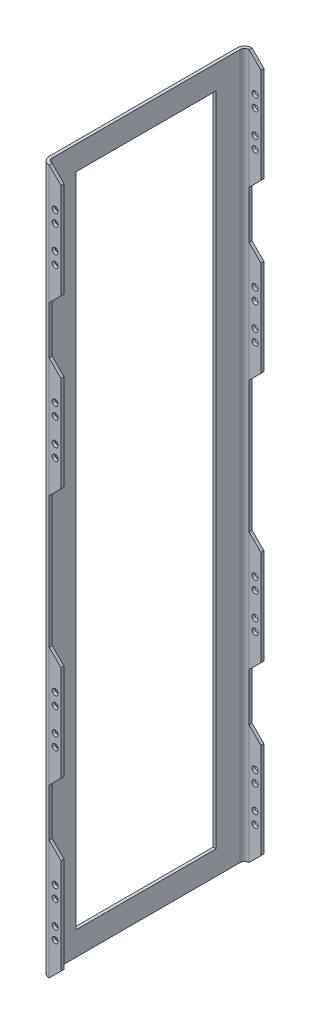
ISO-10303-21;
HEADER;
FILE_DESCRIPTION(('STEP AP214'),'2;1');
FILE_NAME('part.step','',(''),(''),'','','');
FILE_SCHEMA(('AUTOMOTIVE_DESIGN { 1 0 10303 214 1 1 1 1 }'));
ENDSEC;
DATA;
#1=APPLICATION_CONTEXT('core data for automotive mechanical design processes');
#2=APPLICATION_PROTOCOL_DEFINITION('international standard','automotive_design',2000,#1);
#3=PRODUCT_CONTEXT('',#1,'mechanical');
#4=PRODUCT('Part','Part','',(#3));
#5=PRODUCT_RELATED_PRODUCT_CATEGORY('part','',(#4));
#6=PRODUCT_DEFINITION_FORMATION('','',#4);
#7=PRODUCT_DEFINITION_CONTEXT('part definition',#1,'design');
#8=PRODUCT_DEFINITION('design','',#6,#7);
#9=PRODUCT_DEFINITION_SHAPE('','',#8);
#10=(LENGTH_UNIT() NAMED_UNIT(*) SI_UNIT(.MILLI.,.METRE.));
#11=(NAMED_UNIT(*) PLANE_ANGLE_UNIT() SI_UNIT($,.RADIAN.));
#12=(NAMED_UNIT(*) SI_UNIT($,.STERADIAN.) SOLID_ANGLE_UNIT());
#13=UNCERTAINTY_MEASURE_WITH_UNIT(LENGTH_MEASURE(1.E-05),#10,'distance_accuracy_value','');
#14=(GEOMETRIC_REPRESENTATION_CONTEXT(3) GLOBAL_UNCERTAINTY_ASSIGNED_CONTEXT((#13)) GLOBAL_UNIT_ASSIGNED_CONTEXT((#10,
#11,#12)) REPRESENTATION_CONTEXT('',''));
#15=CARTESIAN_POINT('',(0.,0.,0.));
#16=DIRECTION('',(0.,0.,1.));
#17=DIRECTION('',(1.,0.,0.));
#18=AXIS2_PLACEMENT_3D('',#15,#16,#17);
#19=CARTESIAN_POINT('',(-2.28955743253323E-13,374.65,52.3811500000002));
#20=DIRECTION('',(0.,0.,-1.));
#21=DIRECTION('',(-1.,0.,0.));
#22=AXIS2_PLACEMENT_3D('',#19,#20,#21);
#23=PLANE('',#22);
#24=CARTESIAN_POINT('',(-44.44365,241.3,52.38115));
#25=DIRECTION('',(0.,0.,-1.));
#26=DIRECTION('',(-1.,0.,0.));
#27=AXIS2_PLACEMENT_3D('',#24,#25,#26);
#28=CIRCLE('',#27,1.5875);
#29=CARTESIAN_POINT('',(-46.03115,241.3,52.38115));
#30=VERTEX_POINT('',#29);
#31=EDGE_CURVE('E700',#30,#30,#28,.T.);
#32=ORIENTED_EDGE('',*,*,#31,.F.);
#33=EDGE_LOOP('',(#32));
#34=FACE_BOUND('',#33,.T.);
#35=CARTESIAN_POINT('',(-44.44365,266.7,52.38115));
#36=DIRECTION('',(0.,0.,-1.));
#37=DIRECTION('',(-1.,0.,0.));
#38=AXIS2_PLACEMENT_3D('',#35,#36,#37);
#39=CIRCLE('',#38,1.58749999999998);
#40=CARTESIAN_POINT('',(-46.03115,266.7,52.38115));
#41=VERTEX_POINT('',#40);
#42=EDGE_CURVE('E707',#41,#41,#39,.T.);
#43=ORIENTED_EDGE('',*,*,#42,.F.);
#44=EDGE_LOOP('',(#43));
#45=FACE_BOUND('',#44,.T.);
#46=CARTESIAN_POINT('',(-44.44365,247.65,52.38115));
#47=DIRECTION('',(0.,0.,-1.));
#48=DIRECTION('',(-1.,0.,0.));
#49=AXIS2_PLACEMENT_3D('',#46,#47,#48);
#50=CIRCLE('',#49,1.5875);
#51=CARTESIAN_POINT('',(-46.03115,247.65,52.38115));
#52=VERTEX_POINT('',#51);
#53=EDGE_CURVE('E714',#52,#52,#50,.T.);
#54=ORIENTED_EDGE('',*,*,#53,.F.);
#55=EDGE_LOOP('',(#54));
#56=FACE_BOUND('',#55,.T.);
#57=CARTESIAN_POINT('',(-44.44365,260.35,52.38115));
#58=DIRECTION('',(0.,0.,-1.));
#59=DIRECTION('',(-1.,0.,0.));
#60=AXIS2_PLACEMENT_3D('',#57,#58,#59);
#61=CIRCLE('',#60,1.5875);
#62=CARTESIAN_POINT('',(-46.03115,260.35,52.38115));
#63=VERTEX_POINT('',#62);
#64=EDGE_CURVE('E721',#63,#63,#61,.T.);
#65=ORIENTED_EDGE('',*,*,#64,.F.);
#66=EDGE_LOOP('',(#65));
#67=FACE_BOUND('',#66,.T.);
#68=DIRECTION('',(-0.707106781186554,0.707106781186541,0.));
#69=VECTOR('',#68,1.);
#70=CARTESIAN_POINT('',(-68.2593249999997,306.390674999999,52.3811499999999));
#71=LINE('',#70,#69);
#72=CARTESIAN_POINT('',(-41.26865,279.4,52.38115));
#73=VERTEX_POINT('',#72);
#74=CARTESIAN_POINT('',(-47.61865,285.75,52.38115));
#75=VERTEX_POINT('',#74);
#76=EDGE_CURVE('E395',#73,#75,#71,.T.);
#77=ORIENTED_EDGE('',*,*,#76,.F.);
#78=DIRECTION('',(0.,-1.,0.));
#79=VECTOR('',#78,1.);
#80=CARTESIAN_POINT('',(-41.26865,374.65,52.38115));
#81=LINE('',#80,#79);
#82=CARTESIAN_POINT('',(-41.26865,228.6,52.38115));
#83=VERTEX_POINT('',#82);
#84=EDGE_CURVE('E542',#73,#83,#81,.T.);
#85=ORIENTED_EDGE('',*,*,#84,.T.);
#86=DIRECTION('',(-0.707106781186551,-0.707106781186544,0.));
#87=VECTOR('',#86,1.);
#88=CARTESIAN_POINT('',(52.3906750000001,322.259324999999,52.3811500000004));
#89=LINE('',#88,#87);
#90=CARTESIAN_POINT('',(-47.61865,222.25,52.38115));
#91=VERTEX_POINT('',#90);
#92=EDGE_CURVE('E442',#83,#91,#89,.T.);
#93=ORIENTED_EDGE('',*,*,#92,.T.);
#94=DIRECTION('',(0.,-1.,0.));
#95=VECTOR('',#94,1.);
#96=CARTESIAN_POINT('',(-47.61865,374.65,52.38115));
#97=LINE('',#96,#95);
#98=EDGE_CURVE('E583',#75,#91,#97,.T.);
#99=ORIENTED_EDGE('',*,*,#98,.F.);
#100=EDGE_LOOP('',(#77,#85,#93,#99));
#101=FACE_BOUND('',#100,.T.);
#102=ADVANCED_FACE('F40',(#34,#45,#56,#67,#101),#23,.T.);
#103=CARTESIAN_POINT('',(-2.28955743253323E-13,374.65,-52.3811500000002));
#104=DIRECTION('',(0.,0.,-1.));
#105=DIRECTION('',(-1.,0.,0.));
#106=AXIS2_PLACEMENT_3D('',#103,#104,#105);
#107=PLANE('',#106);
#108=CARTESIAN_POINT('',(-44.44365,241.3,-52.38115));
#109=DIRECTION('',(0.,0.,-1.));
#110=DIRECTION('',(-1.,0.,0.));
#111=AXIS2_PLACEMENT_3D('',#108,#109,#110);
#112=CIRCLE('',#111,1.5875);
#113=CARTESIAN_POINT('',(-46.03115,241.3,-52.38115));
#114=VERTEX_POINT('',#113);
#115=EDGE_CURVE('E650',#114,#114,#112,.T.);
#116=ORIENTED_EDGE('',*,*,#115,.T.);
#117=EDGE_LOOP('',(#116));
#118=FACE_BOUND('',#117,.T.);
#119=CARTESIAN_POINT('',(-44.44365,266.7,-52.38115));
#120=DIRECTION('',(0.,0.,-1.));
#121=DIRECTION('',(-1.,0.,0.));
#122=AXIS2_PLACEMENT_3D('',#119,#120,#121);
#123=CIRCLE('',#122,1.58749999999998);
#124=CARTESIAN_POINT('',(-46.03115,266.7,-52.38115));
#125=VERTEX_POINT('',#124);
#126=EDGE_CURVE('E645',#125,#125,#123,.T.);
#127=ORIENTED_EDGE('',*,*,#126,.T.);
#128=EDGE_LOOP('',(#127));
#129=FACE_BOUND('',#128,.T.);
#130=CARTESIAN_POINT('',(-44.44365,247.65,-52.38115));
#131=DIRECTION('',(0.,0.,-1.));
#132=DIRECTION('',(-1.,0.,0.));
#133=AXIS2_PLACEMENT_3D('',#130,#131,#132);
#134=CIRCLE('',#133,1.5875);
#135=CARTESIAN_POINT('',(-46.03115,247.65,-52.38115));
#136=VERTEX_POINT('',#135);
#137=EDGE_CURVE('E640',#136,#136,#134,.T.);
#138=ORIENTED_EDGE('',*,*,#137,.T.);
#139=EDGE_LOOP('',(#138));
#140=FACE_BOUND('',#139,.T.);
#141=CARTESIAN_POINT('',(-44.44365,260.35,-52.38115));
#142=DIRECTION('',(0.,0.,-1.));
#143=DIRECTION('',(-1.,0.,0.));
#144=AXIS2_PLACEMENT_3D('',#141,#142,#143);
#145=CIRCLE('',#144,1.5875);
#146=CARTESIAN_POINT('',(-46.03115,260.35,-52.38115));
#147=VERTEX_POINT('',#146);
#148=EDGE_CURVE('E635',#147,#147,#145,.T.);
#149=ORIENTED_EDGE('',*,*,#148,.T.);
#150=EDGE_LOOP('',(#149));
#151=FACE_BOUND('',#150,.T.);
#152=DIRECTION('',(0.,-1.,0.));
#153=VECTOR('',#152,1.);
#154=CARTESIAN_POINT('',(-41.26865,374.65,-52.38115));
#155=LINE('',#154,#153);
#156=CARTESIAN_POINT('',(-41.26865,279.4,-52.38115));
#157=VERTEX_POINT('',#156);
#158=CARTESIAN_POINT('',(-41.26865,228.6,-52.38115));
#159=VERTEX_POINT('',#158);
#160=EDGE_CURVE('E569',#157,#159,#155,.T.);
#161=ORIENTED_EDGE('',*,*,#160,.F.);
#162=DIRECTION('',(-0.707106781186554,0.707106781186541,0.));
#163=VECTOR('',#162,1.);
#164=CARTESIAN_POINT('',(-68.2593249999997,306.390674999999,-52.3811499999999));
#165=LINE('',#164,#163);
#166=CARTESIAN_POINT('',(-47.61865,285.75,-52.38115));
#167=VERTEX_POINT('',#166);
#168=EDGE_CURVE('E392',#157,#167,#165,.T.);
#169=ORIENTED_EDGE('',*,*,#168,.T.);
#170=DIRECTION('',(0.,-1.,0.));
#171=VECTOR('',#170,1.);
#172=CARTESIAN_POINT('',(-47.61865,374.65,-52.38115));
#173=LINE('',#172,#171);
#174=CARTESIAN_POINT('',(-47.61865,222.25,-52.38115));
#175=VERTEX_POINT('',#174);
#176=EDGE_CURVE('E574',#167,#175,#173,.T.);
#177=ORIENTED_EDGE('',*,*,#176,.T.);
#178=DIRECTION('',(-0.707106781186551,-0.707106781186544,0.));
#179=VECTOR('',#178,1.);
#180=CARTESIAN_POINT('',(52.3906750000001,322.259324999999,-52.3811500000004));
#181=LINE('',#180,#179);
#182=EDGE_CURVE('E439',#159,#175,#181,.T.);
#183=ORIENTED_EDGE('',*,*,#182,.F.);
#184=EDGE_LOOP('',(#161,#169,#177,#183));
#185=FACE_BOUND('',#184,.T.);
#186=ADVANCED_FACE('F886',(#118,#129,#140,#151,#185),#107,.F.);
#187=CARTESIAN_POINT('',(-41.26865,374.65,0.));
#188=DIRECTION('',(1.,0.,0.));
#189=DIRECTION('',(0.,0.,-1.));
#190=AXIS2_PLACEMENT_3D('',#187,#188,#189);
#191=PLANE('',#190);
#192=DIRECTION('',(0.,0.,1.));
#193=VECTOR('',#192,1.);
#194=CARTESIAN_POINT('',(-41.26865,279.4,-53.98135));
#195=LINE('',#194,#193);
#196=CARTESIAN_POINT('',(-41.26865,279.4,-53.96865));
#197=VERTEX_POINT('',#196);
#198=EDGE_CURVE('E361',#197,#157,#195,.T.);
#199=ORIENTED_EDGE('',*,*,#198,.T.);
#200=ORIENTED_EDGE('',*,*,#160,.T.);
#201=DIRECTION('',(0.,0.,1.));
#202=VECTOR('',#201,1.);
#203=CARTESIAN_POINT('',(-41.26865,228.6,-53.98135));
#204=LINE('',#203,#202);
#205=CARTESIAN_POINT('',(-41.26865,228.6,-53.96865));
#206=VERTEX_POINT('',#205);
#207=EDGE_CURVE('E409',#206,#159,#204,.T.);
#208=ORIENTED_EDGE('',*,*,#207,.F.);
#209=DIRECTION('',(0.,-1.,0.));
#210=VECTOR('',#209,1.);
#211=CARTESIAN_POINT('',(-41.26865,374.65,-53.96865));
#212=LINE('',#211,#210);
#213=EDGE_CURVE('E565',#197,#206,#212,.T.);
#214=ORIENTED_EDGE('',*,*,#213,.F.);
#215=EDGE_LOOP('',(#199,#200,#208,#214));
#216=FACE_BOUND('',#215,.T.);
#217=ADVANCED_FACE('F892',(#216),#191,.T.);
#218=CARTESIAN_POINT('',(0.,374.65,-53.96865));
#219=DIRECTION('',(0.,0.,-1.));
#220=DIRECTION('',(-1.,0.,0.));
#221=AXIS2_PLACEMENT_3D('',#218,#219,#220);
#222=PLANE('',#221);
#223=CARTESIAN_POINT('',(-44.44365,241.3,-53.96865));
#224=DIRECTION('',(0.,0.,-1.));
#225=DIRECTION('',(-1.,0.,0.));
#226=AXIS2_PLACEMENT_3D('',#223,#224,#225);
#227=CIRCLE('',#226,1.5875);
#228=CARTESIAN_POINT('',(-46.03115,241.3,-53.96865));
#229=VERTEX_POINT('',#228);
#230=EDGE_CURVE('E651',#229,#229,#227,.T.);
#231=ORIENTED_EDGE('',*,*,#230,.F.);
#232=EDGE_LOOP('',(#231));
#233=FACE_BOUND('',#232,.T.);
#234=CARTESIAN_POINT('',(-44.44365,266.7,-53.96865));
#235=DIRECTION('',(0.,0.,-1.));
#236=DIRECTION('',(-1.,0.,0.));
#237=AXIS2_PLACEMENT_3D('',#234,#235,#236);
#238=CIRCLE('',#237,1.58749999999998);
#239=CARTESIAN_POINT('',(-46.03115,266.7,-53.96865));
#240=VERTEX_POINT('',#239);
#241=EDGE_CURVE('E646',#240,#240,#238,.T.);
#242=ORIENTED_EDGE('',*,*,#241,.F.);
#243=EDGE_LOOP('',(#242));
#244=FACE_BOUND('',#243,.T.);
#245=CARTESIAN_POINT('',(-44.44365,247.65,-53.96865));
#246=DIRECTION('',(0.,0.,-1.));
#247=DIRECTION('',(-1.,0.,0.));
#248=AXIS2_PLACEMENT_3D('',#245,#246,#247);
#249=CIRCLE('',#248,1.5875);
#250=CARTESIAN_POINT('',(-46.03115,247.65,-53.96865));
#251=VERTEX_POINT('',#250);
#252=EDGE_CURVE('E641',#251,#251,#249,.T.);
#253=ORIENTED_EDGE('',*,*,#252,.F.);
#254=EDGE_LOOP('',(#253));
#255=FACE_BOUND('',#254,.T.);
#256=CARTESIAN_POINT('',(-44.44365,260.35,-53.96865));
#257=DIRECTION('',(0.,0.,-1.));
#258=DIRECTION('',(-1.,0.,0.));
#259=AXIS2_PLACEMENT_3D('',#256,#257,#258);
#260=CIRCLE('',#259,1.5875);
#261=CARTESIAN_POINT('',(-46.03115,260.35,-53.96865));
#262=VERTEX_POINT('',#261);
#263=EDGE_CURVE('E636',#262,#262,#260,.T.);
#264=ORIENTED_EDGE('',*,*,#263,.F.);
#265=EDGE_LOOP('',(#264));
#266=FACE_BOUND('',#265,.T.);
#267=DIRECTION('',(-0.707106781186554,0.707106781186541,0.));
#268=VECTOR('',#267,1.);
#269=CARTESIAN_POINT('',(-68.2593249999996,306.390674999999,-53.96865));
#270=LINE('',#269,#268);
#271=CARTESIAN_POINT('',(-47.61865,285.75,-53.96865));
#272=VERTEX_POINT('',#271);
#273=EDGE_CURVE('E389',#197,#272,#270,.T.);
#274=ORIENTED_EDGE('',*,*,#273,.F.);
#275=ORIENTED_EDGE('',*,*,#213,.T.);
#276=DIRECTION('',(-0.707106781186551,-0.707106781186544,0.));
#277=VECTOR('',#276,1.);
#278=CARTESIAN_POINT('',(52.3906750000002,322.259324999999,-53.96865));
#279=LINE('',#278,#277);
#280=CARTESIAN_POINT('',(-47.61865,222.25,-53.96865));
#281=VERTEX_POINT('',#280);
#282=EDGE_CURVE('E436',#206,#281,#279,.T.);
#283=ORIENTED_EDGE('',*,*,#282,.T.);
#284=DIRECTION('',(0.,-1.,0.));
#285=VECTOR('',#284,1.);
#286=CARTESIAN_POINT('',(-47.61865,374.65,-53.96865));
#287=LINE('',#286,#285);
#288=EDGE_CURVE('E561',#272,#281,#287,.T.);
#289=ORIENTED_EDGE('',*,*,#288,.F.);
#290=EDGE_LOOP('',(#274,#275,#283,#289));
#291=FACE_BOUND('',#290,.T.);
#292=ADVANCED_FACE('F961',(#233,#244,#255,#266,#291),#222,.T.);
#293=CARTESIAN_POINT('',(0.,374.65,53.96865));
#294=DIRECTION('',(0.,0.,-1.));
#295=DIRECTION('',(-1.,0.,0.));
#296=AXIS2_PLACEMENT_3D('',#293,#294,#295);
#297=PLANE('',#296);
#298=CARTESIAN_POINT('',(-44.44365,241.3,53.96865));
#299=DIRECTION('',(0.,0.,-1.));
#300=DIRECTION('',(-1.,0.,0.));
#301=AXIS2_PLACEMENT_3D('',#298,#299,#300);
#302=CIRCLE('',#301,1.5875);
#303=CARTESIAN_POINT('',(-46.03115,241.3,53.96865));
#304=VERTEX_POINT('',#303);
#305=EDGE_CURVE('E647',#304,#304,#302,.T.);
#306=ORIENTED_EDGE('',*,*,#305,.T.);
#307=EDGE_LOOP('',(#306));
#308=FACE_BOUND('',#307,.T.);
#309=CARTESIAN_POINT('',(-44.44365,266.7,53.96865));
#310=DIRECTION('',(0.,0.,-1.));
#311=DIRECTION('',(-1.,0.,0.));
#312=AXIS2_PLACEMENT_3D('',#309,#310,#311);
#313=CIRCLE('',#312,1.58749999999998);
#314=CARTESIAN_POINT('',(-46.03115,266.7,53.96865));
#315=VERTEX_POINT('',#314);
#316=EDGE_CURVE('E642',#315,#315,#313,.T.);
#317=ORIENTED_EDGE('',*,*,#316,.T.);
#318=EDGE_LOOP('',(#317));
#319=FACE_BOUND('',#318,.T.);
#320=CARTESIAN_POINT('',(-44.44365,247.65,53.96865));
#321=DIRECTION('',(0.,0.,-1.));
#322=DIRECTION('',(-1.,0.,0.));
#323=AXIS2_PLACEMENT_3D('',#320,#321,#322);
#324=CIRCLE('',#323,1.5875);
#325=CARTESIAN_POINT('',(-46.03115,247.65,53.96865));
#326=VERTEX_POINT('',#325);
#327=EDGE_CURVE('E637',#326,#326,#324,.T.);
#328=ORIENTED_EDGE('',*,*,#327,.T.);
#329=EDGE_LOOP('',(#328));
#330=FACE_BOUND('',#329,.T.);
#331=CARTESIAN_POINT('',(-44.44365,260.35,53.96865));
#332=DIRECTION('',(0.,0.,-1.));
#333=DIRECTION('',(-1.,0.,0.));
#334=AXIS2_PLACEMENT_3D('',#331,#332,#333);
#335=CIRCLE('',#334,1.5875);
#336=CARTESIAN_POINT('',(-46.03115,260.35,53.96865));
#337=VERTEX_POINT('',#336);
#338=EDGE_CURVE('E632',#337,#337,#335,.T.);
#339=ORIENTED_EDGE('',*,*,#338,.T.);
#340=EDGE_LOOP('',(#339));
#341=FACE_BOUND('',#340,.T.);
#342=DIRECTION('',(0.,-1.,0.));
#343=VECTOR('',#342,1.);
#344=CARTESIAN_POINT('',(-41.26865,374.65,53.96865));
#345=LINE('',#344,#343);
#346=CARTESIAN_POINT('',(-41.26865,279.4,53.96865));
#347=VERTEX_POINT('',#346);
#348=CARTESIAN_POINT('',(-41.26865,228.6,53.96865));
#349=VERTEX_POINT('',#348);
#350=EDGE_CURVE('E546',#347,#349,#345,.T.);
#351=ORIENTED_EDGE('',*,*,#350,.F.);
#352=DIRECTION('',(0.707106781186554,-0.707106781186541,0.));
#353=VECTOR('',#352,1.);
#354=CARTESIAN_POINT('',(119.065675,119.065675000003,53.96865));
#355=LINE('',#354,#353);
#356=CARTESIAN_POINT('',(-47.61865,285.75,53.96865));
#357=VERTEX_POINT('',#356);
#358=EDGE_CURVE('E355',#357,#347,#355,.T.);
#359=ORIENTED_EDGE('',*,*,#358,.F.);
#360=DIRECTION('',(0.,-1.,0.));
#361=VECTOR('',#360,1.);
#362=CARTESIAN_POINT('',(-47.61865,374.65,53.96865));
#363=LINE('',#362,#361);
#364=CARTESIAN_POINT('',(-47.61865,222.25,53.96865));
#365=VERTEX_POINT('',#364);
#366=EDGE_CURVE('E551',#357,#365,#363,.T.);
#367=ORIENTED_EDGE('',*,*,#366,.T.);
#368=DIRECTION('',(0.707106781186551,0.707106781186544,0.));
#369=VECTOR('',#368,1.);
#370=CARTESIAN_POINT('',(-134.934325,134.934325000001,53.96865));
#371=LINE('',#370,#369);
#372=EDGE_CURVE('E397',#365,#349,#371,.T.);
#373=ORIENTED_EDGE('',*,*,#372,.T.);
#374=EDGE_LOOP('',(#351,#359,#367,#373));
#375=FACE_BOUND('',#374,.T.);
#376=ADVANCED_FACE('F907',(#308,#319,#330,#341,#375),#297,.F.);
#377=CARTESIAN_POINT('',(-41.26865,374.65,0.));
#378=DIRECTION('',(-1.,0.,0.));
#379=DIRECTION('',(0.,0.,1.));
#380=AXIS2_PLACEMENT_3D('',#377,#378,#379);
#381=PLANE('',#380);
#382=ORIENTED_EDGE('',*,*,#84,.F.);
#383=EDGE_CURVE('E358',#73,#347,#195,.T.);
#384=ORIENTED_EDGE('',*,*,#383,.T.);
#385=ORIENTED_EDGE('',*,*,#350,.T.);
#386=EDGE_CURVE('E406',#83,#349,#204,.T.);
#387=ORIENTED_EDGE('',*,*,#386,.F.);
#388=EDGE_LOOP('',(#382,#384,#385,#387));
#389=FACE_BOUND('',#388,.T.);
#390=ADVANCED_FACE('F812',(#389),#381,.F.);
#391=CARTESIAN_POINT('',(-44.44365,330.2,52.38115));
#392=DIRECTION('',(0.,0.,-1.));
#393=DIRECTION('',(-1.,0.,0.));
#394=AXIS2_PLACEMENT_3D('',#391,#392,#393);
#395=CIRCLE('',#394,1.5875);
#396=CARTESIAN_POINT('',(-46.03115,330.2,52.38115));
#397=VERTEX_POINT('',#396);
#398=EDGE_CURVE('E671',#397,#397,#395,.T.);
#399=ORIENTED_EDGE('',*,*,#398,.F.);
#400=EDGE_LOOP('',(#399));
#401=FACE_BOUND('',#400,.T.);
#402=CARTESIAN_POINT('',(-44.44365,355.6,52.38115));
#403=DIRECTION('',(0.,0.,-1.));
#404=DIRECTION('',(-1.,0.,0.));
#405=AXIS2_PLACEMENT_3D('',#402,#403,#404);
#406=CIRCLE('',#405,1.58749999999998);
#407=CARTESIAN_POINT('',(-46.03115,355.6,52.38115));
#408=VERTEX_POINT('',#407);
#409=EDGE_CURVE('E668',#408,#408,#406,.T.);
#410=ORIENTED_EDGE('',*,*,#409,.F.);
#411=EDGE_LOOP('',(#410));
#412=FACE_BOUND('',#411,.T.);
#413=CARTESIAN_POINT('',(-44.44365,336.55,52.38115));
#414=DIRECTION('',(0.,0.,-1.));
#415=DIRECTION('',(-1.,0.,0.));
#416=AXIS2_PLACEMENT_3D('',#413,#414,#415);
#417=CIRCLE('',#416,1.58749999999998);
#418=CARTESIAN_POINT('',(-46.03115,336.55,52.38115));
#419=VERTEX_POINT('',#418);
#420=EDGE_CURVE('E686',#419,#419,#417,.T.);
#421=ORIENTED_EDGE('',*,*,#420,.F.);
#422=EDGE_LOOP('',(#421));
#423=FACE_BOUND('',#422,.T.);
#424=CARTESIAN_POINT('',(-44.44365,349.25,52.38115));
#425=DIRECTION('',(0.,0.,-1.));
#426=DIRECTION('',(-1.,0.,0.));
#427=AXIS2_PLACEMENT_3D('',#424,#425,#426);
#428=CIRCLE('',#427,1.5875);
#429=CARTESIAN_POINT('',(-46.03115,349.25,52.38115));
#430=VERTEX_POINT('',#429);
#431=EDGE_CURVE('E693',#430,#430,#428,.T.);
#432=ORIENTED_EDGE('',*,*,#431,.F.);
#433=EDGE_LOOP('',(#432));
#434=FACE_BOUND('',#433,.T.);
#435=DIRECTION('',(-0.707106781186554,0.707106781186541,0.));
#436=VECTOR('',#435,1.);
#437=CARTESIAN_POINT('',(-23.8093249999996,350.840675,52.3811500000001));
#438=LINE('',#437,#436);
#439=CARTESIAN_POINT('',(-41.26865,368.3,52.38115));
#440=VERTEX_POINT('',#439);
#441=CARTESIAN_POINT('',(-47.61865,374.65,52.38115));
#442=VERTEX_POINT('',#441);
#443=EDGE_CURVE('E348',#440,#442,#438,.T.);
#444=ORIENTED_EDGE('',*,*,#443,.F.);
#445=CARTESIAN_POINT('',(-41.26865,317.5,52.38115));
#446=VERTEX_POINT('',#445);
#447=EDGE_CURVE('E539',#440,#446,#81,.T.);
#448=ORIENTED_EDGE('',*,*,#447,.T.);
#449=DIRECTION('',(0.707106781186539,0.707106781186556,0.));
#450=VECTOR('',#449,1.);
#451=CARTESIAN_POINT('',(7.94067499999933,366.709325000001,52.3811500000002));
#452=LINE('',#451,#450);
#453=CARTESIAN_POINT('',(-47.61865,311.15,52.38115));
#454=VERTEX_POINT('',#453);
#455=EDGE_CURVE('E378',#454,#446,#452,.T.);
#456=ORIENTED_EDGE('',*,*,#455,.F.);
#457=EDGE_CURVE('E579',#442,#454,#97,.T.);
#458=ORIENTED_EDGE('',*,*,#457,.F.);
#459=EDGE_LOOP('',(#444,#448,#456,#458));
#460=FACE_BOUND('',#459,.T.);
#461=ADVANCED_FACE('F888',(#401,#412,#423,#434,#460),#23,.T.);
#462=CARTESIAN_POINT('',(-44.44365,330.2,-52.38115));
#463=DIRECTION('',(0.,0.,-1.));
#464=DIRECTION('',(-1.,0.,0.));
#465=AXIS2_PLACEMENT_3D('',#462,#463,#464);
#466=CIRCLE('',#465,1.5875);
#467=CARTESIAN_POINT('',(-46.03115,330.2,-52.38115));
#468=VERTEX_POINT('',#467);
#469=EDGE_CURVE('E676',#468,#468,#466,.T.);
#470=ORIENTED_EDGE('',*,*,#469,.T.);
#471=EDGE_LOOP('',(#470));
#472=FACE_BOUND('',#471,.T.);
#473=CARTESIAN_POINT('',(-44.44365,355.6,-52.38115));
#474=DIRECTION('',(0.,0.,-1.));
#475=DIRECTION('',(-1.,0.,0.));
#476=AXIS2_PLACEMENT_3D('',#473,#474,#475);
#477=CIRCLE('',#476,1.58749999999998);
#478=CARTESIAN_POINT('',(-46.03115,355.6,-52.38115));
#479=VERTEX_POINT('',#478);
#480=EDGE_CURVE('E663',#479,#479,#477,.T.);
#481=ORIENTED_EDGE('',*,*,#480,.T.);
#482=EDGE_LOOP('',(#481));
#483=FACE_BOUND('',#482,.T.);
#484=CARTESIAN_POINT('',(-44.44365,336.55,-52.38115));
#485=DIRECTION('',(0.,0.,-1.));
#486=DIRECTION('',(-1.,0.,0.));
#487=AXIS2_PLACEMENT_3D('',#484,#485,#486);
#488=CIRCLE('',#487,1.58749999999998);
#489=CARTESIAN_POINT('',(-46.03115,336.55,-52.38115));
#490=VERTEX_POINT('',#489);
#491=EDGE_CURVE('E659',#490,#490,#488,.T.);
#492=ORIENTED_EDGE('',*,*,#491,.T.);
#493=EDGE_LOOP('',(#492));
#494=FACE_BOUND('',#493,.T.);
#495=CARTESIAN_POINT('',(-44.44365,349.25,-52.38115));
#496=DIRECTION('',(0.,0.,-1.));
#497=DIRECTION('',(-1.,0.,0.));
#498=AXIS2_PLACEMENT_3D('',#495,#496,#497);
#499=CIRCLE('',#498,1.5875);
#500=CARTESIAN_POINT('',(-46.03115,349.25,-52.38115));
#501=VERTEX_POINT('',#500);
#502=EDGE_CURVE('E655',#501,#501,#499,.T.);
#503=ORIENTED_EDGE('',*,*,#502,.T.);
#504=EDGE_LOOP('',(#503));
#505=FACE_BOUND('',#504,.T.);
#506=CARTESIAN_POINT('',(-41.26865,368.3,-52.38115));
#507=VERTEX_POINT('',#506);
#508=CARTESIAN_POINT('',(-41.26865,317.5,-52.38115));
#509=VERTEX_POINT('',#508);
#510=EDGE_CURVE('E566',#507,#509,#155,.T.);
#511=ORIENTED_EDGE('',*,*,#510,.F.);
#512=DIRECTION('',(-0.707106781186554,0.707106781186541,0.));
#513=VECTOR('',#512,1.);
#514=CARTESIAN_POINT('',(-23.8093249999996,350.840675,-52.3811500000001));
#515=LINE('',#514,#513);
#516=CARTESIAN_POINT('',(-47.61865,374.65,-52.38115));
#517=VERTEX_POINT('',#516);
#518=EDGE_CURVE('E345',#507,#517,#515,.T.);
#519=ORIENTED_EDGE('',*,*,#518,.T.);
#520=CARTESIAN_POINT('',(-47.61865,311.15,-52.38115));
#521=VERTEX_POINT('',#520);
#522=EDGE_CURVE('E570',#517,#521,#173,.T.);
#523=ORIENTED_EDGE('',*,*,#522,.T.);
#524=DIRECTION('',(0.707106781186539,0.707106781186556,0.));
#525=VECTOR('',#524,1.);
#526=CARTESIAN_POINT('',(7.94067499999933,366.709325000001,-52.3811500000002));
#527=LINE('',#526,#525);
#528=EDGE_CURVE('E375',#521,#509,#527,.T.);
#529=ORIENTED_EDGE('',*,*,#528,.T.);
#530=EDGE_LOOP('',(#511,#519,#523,#529));
#531=FACE_BOUND('',#530,.T.);
#532=ADVANCED_FACE('F895',(#472,#483,#494,#505,#531),#107,.F.);
#533=DIRECTION('',(0.,0.,1.));
#534=VECTOR('',#533,1.);
#535=CARTESIAN_POINT('',(-41.26865,368.3,-53.98135));
#536=LINE('',#535,#534);
#537=CARTESIAN_POINT('',(-41.26865,368.3,-53.96865));
#538=VERTEX_POINT('',#537);
#539=EDGE_CURVE('E342',#538,#507,#536,.T.);
#540=ORIENTED_EDGE('',*,*,#539,.T.);
#541=ORIENTED_EDGE('',*,*,#510,.T.);
#542=DIRECTION('',(0.,0.,1.));
#543=VECTOR('',#542,1.);
#544=CARTESIAN_POINT('',(-41.26865,317.5,-53.98135));
#545=LINE('',#544,#543);
#546=CARTESIAN_POINT('',(-41.26865,317.5,-53.96865));
#547=VERTEX_POINT('',#546);
#548=EDGE_CURVE('E369',#547,#509,#545,.T.);
#549=ORIENTED_EDGE('',*,*,#548,.F.);
#550=EDGE_CURVE('E562',#538,#547,#212,.T.);
#551=ORIENTED_EDGE('',*,*,#550,.F.);
#552=EDGE_LOOP('',(#540,#541,#549,#551));
#553=FACE_BOUND('',#552,.T.);
#554=ADVANCED_FACE('F904',(#553),#191,.T.);
#555=CARTESIAN_POINT('',(-44.44365,330.2,-53.96865));
#556=DIRECTION('',(0.,0.,-1.));
#557=DIRECTION('',(-1.,0.,0.));
#558=AXIS2_PLACEMENT_3D('',#555,#556,#557);
#559=CIRCLE('',#558,1.5875);
#560=CARTESIAN_POINT('',(-46.03115,330.2,-53.96865));
#561=VERTEX_POINT('',#560);
#562=EDGE_CURVE('E1764',#561,#561,#559,.T.);
#563=ORIENTED_EDGE('',*,*,#562,.F.);
#564=EDGE_LOOP('',(#563));
#565=FACE_BOUND('',#564,.T.);
#566=CARTESIAN_POINT('',(-44.44365,355.6,-53.96865));
#567=DIRECTION('',(0.,0.,-1.));
#568=DIRECTION('',(-1.,0.,0.));
#569=AXIS2_PLACEMENT_3D('',#566,#567,#568);
#570=CIRCLE('',#569,1.58749999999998);
#571=CARTESIAN_POINT('',(-46.03115,355.6,-53.96865));
#572=VERTEX_POINT('',#571);
#573=EDGE_CURVE('E664',#572,#572,#570,.T.);
#574=ORIENTED_EDGE('',*,*,#573,.F.);
#575=EDGE_LOOP('',(#574));
#576=FACE_BOUND('',#575,.T.);
#577=CARTESIAN_POINT('',(-44.44365,336.55,-53.96865));
#578=DIRECTION('',(0.,0.,-1.));
#579=DIRECTION('',(-1.,0.,0.));
#580=AXIS2_PLACEMENT_3D('',#577,#578,#579);
#581=CIRCLE('',#580,1.58749999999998);
#582=CARTESIAN_POINT('',(-46.03115,336.55,-53.96865));
#583=VERTEX_POINT('',#582);
#584=EDGE_CURVE('E660',#583,#583,#581,.T.);
#585=ORIENTED_EDGE('',*,*,#584,.F.);
#586=EDGE_LOOP('',(#585));
#587=FACE_BOUND('',#586,.T.);
#588=CARTESIAN_POINT('',(-44.44365,349.25,-53.96865));
#589=DIRECTION('',(0.,0.,-1.));
#590=DIRECTION('',(-1.,0.,0.));
#591=AXIS2_PLACEMENT_3D('',#588,#589,#590);
#592=CIRCLE('',#591,1.5875);
#593=CARTESIAN_POINT('',(-46.03115,349.25,-53.96865));
#594=VERTEX_POINT('',#593);
#595=EDGE_CURVE('E656',#594,#594,#592,.T.);
#596=ORIENTED_EDGE('',*,*,#595,.F.);
#597=EDGE_LOOP('',(#596));
#598=FACE_BOUND('',#597,.T.);
#599=DIRECTION('',(-0.707106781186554,0.707106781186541,0.));
#600=VECTOR('',#599,1.);
#601=CARTESIAN_POINT('',(-23.8093249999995,350.840675,-53.96865));
#602=LINE('',#601,#600);
#603=CARTESIAN_POINT('',(-47.61865,374.65,-53.96865));
#604=VERTEX_POINT('',#603);
#605=EDGE_CURVE('E343',#538,#604,#602,.T.);
#606=ORIENTED_EDGE('',*,*,#605,.F.);
#607=ORIENTED_EDGE('',*,*,#550,.T.);
#608=DIRECTION('',(0.707106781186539,0.707106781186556,0.));
#609=VECTOR('',#608,1.);
#610=CARTESIAN_POINT('',(7.94067499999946,366.709325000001,-53.96865));
#611=LINE('',#610,#609);
#612=CARTESIAN_POINT('',(-47.61865,311.15,-53.96865));
#613=VERTEX_POINT('',#612);
#614=EDGE_CURVE('E372',#613,#547,#611,.T.);
#615=ORIENTED_EDGE('',*,*,#614,.F.);
#616=EDGE_CURVE('E557',#604,#613,#287,.T.);
#617=ORIENTED_EDGE('',*,*,#616,.F.);
#618=EDGE_LOOP('',(#606,#607,#615,#617));
#619=FACE_BOUND('',#618,.T.);
#620=ADVANCED_FACE('F948',(#565,#576,#587,#598,#619),#222,.T.);
#621=CARTESIAN_POINT('',(-44.44365,330.2,53.96865));
#622=DIRECTION('',(0.,0.,-1.));
#623=DIRECTION('',(-1.,0.,0.));
#624=AXIS2_PLACEMENT_3D('',#621,#622,#623);
#625=CIRCLE('',#624,1.5875);
#626=CARTESIAN_POINT('',(-46.03115,330.2,53.96865));
#627=VERTEX_POINT('',#626);
#628=EDGE_CURVE('E44',#627,#627,#625,.T.);
#629=ORIENTED_EDGE('',*,*,#628,.T.);
#630=EDGE_LOOP('',(#629));
#631=FACE_BOUND('',#630,.T.);
#632=CARTESIAN_POINT('',(-44.44365,355.6,53.96865));
#633=DIRECTION('',(0.,0.,-1.));
#634=DIRECTION('',(-1.,0.,0.));
#635=AXIS2_PLACEMENT_3D('',#632,#633,#634);
#636=CIRCLE('',#635,1.58749999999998);
#637=CARTESIAN_POINT('',(-46.03115,355.6,53.96865));
#638=VERTEX_POINT('',#637);
#639=EDGE_CURVE('E661',#638,#638,#636,.T.);
#640=ORIENTED_EDGE('',*,*,#639,.T.);
#641=EDGE_LOOP('',(#640));
#642=FACE_BOUND('',#641,.T.);
#643=CARTESIAN_POINT('',(-44.44365,336.55,53.96865));
#644=DIRECTION('',(0.,0.,-1.));
#645=DIRECTION('',(-1.,0.,0.));
#646=AXIS2_PLACEMENT_3D('',#643,#644,#645);
#647=CIRCLE('',#646,1.58749999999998);
#648=CARTESIAN_POINT('',(-46.03115,336.55,53.96865));
#649=VERTEX_POINT('',#648);
#650=EDGE_CURVE('E657',#649,#649,#647,.T.);
#651=ORIENTED_EDGE('',*,*,#650,.T.);
#652=EDGE_LOOP('',(#651));
#653=FACE_BOUND('',#652,.T.);
#654=CARTESIAN_POINT('',(-44.44365,349.25,53.96865));
#655=DIRECTION('',(0.,0.,-1.));
#656=DIRECTION('',(-1.,0.,0.));
#657=AXIS2_PLACEMENT_3D('',#654,#655,#656);
#658=CIRCLE('',#657,1.5875);
#659=CARTESIAN_POINT('',(-46.03115,349.25,53.96865));
#660=VERTEX_POINT('',#659);
#661=EDGE_CURVE('E652',#660,#660,#658,.T.);
#662=ORIENTED_EDGE('',*,*,#661,.T.);
#663=EDGE_LOOP('',(#662));
#664=FACE_BOUND('',#663,.T.);
#665=CARTESIAN_POINT('',(-41.26865,368.3,53.96865));
#666=VERTEX_POINT('',#665);
#667=CARTESIAN_POINT('',(-41.26865,317.5,53.96865));
#668=VERTEX_POINT('',#667);
#669=EDGE_CURVE('E543',#666,#668,#345,.T.);
#670=ORIENTED_EDGE('',*,*,#669,.F.);
#671=DIRECTION('',(0.707106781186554,-0.707106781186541,0.));
#672=VECTOR('',#671,1.);
#673=CARTESIAN_POINT('',(163.515675,163.515675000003,53.96865));
#674=LINE('',#673,#672);
#675=CARTESIAN_POINT('',(-47.61865,374.65,53.96865));
#676=VERTEX_POINT('',#675);
#677=EDGE_CURVE('E334',#676,#666,#674,.T.);
#678=ORIENTED_EDGE('',*,*,#677,.F.);
#679=CARTESIAN_POINT('',(-47.61865,311.15,53.96865));
#680=VERTEX_POINT('',#679);
#681=EDGE_CURVE('E547',#676,#680,#363,.T.);
#682=ORIENTED_EDGE('',*,*,#681,.T.);
#683=DIRECTION('',(-0.707106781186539,-0.707106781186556,0.));
#684=VECTOR('',#683,1.);
#685=CARTESIAN_POINT('',(-179.384325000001,179.384324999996,53.96865));
#686=LINE('',#685,#684);
#687=EDGE_CURVE('E350',#668,#680,#686,.T.);
#688=ORIENTED_EDGE('',*,*,#687,.F.);
#689=EDGE_LOOP('',(#670,#678,#682,#688));
#690=FACE_BOUND('',#689,.T.);
#691=ADVANCED_FACE('F940',(#631,#642,#653,#664,#690),#297,.F.);
#692=ORIENTED_EDGE('',*,*,#447,.F.);
#693=EDGE_CURVE('E339',#440,#666,#536,.T.);
#694=ORIENTED_EDGE('',*,*,#693,.T.);
#695=ORIENTED_EDGE('',*,*,#669,.T.);
#696=EDGE_CURVE('E357',#446,#668,#545,.T.);
#697=ORIENTED_EDGE('',*,*,#696,.F.);
#698=EDGE_LOOP('',(#692,#694,#695,#697));
#699=FACE_BOUND('',#698,.T.);
#700=ADVANCED_FACE('F786',(#699),#381,.F.);
#701=CARTESIAN_POINT('',(-44.44365,19.0500000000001,52.38115));
#702=DIRECTION('',(0.,0.,-1.));
#703=DIRECTION('',(-1.,0.,0.));
#704=AXIS2_PLACEMENT_3D('',#701,#702,#703);
#705=CIRCLE('',#704,1.5875);
#706=CARTESIAN_POINT('',(-46.03115,19.0500000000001,52.38115));
#707=VERTEX_POINT('',#706);
#708=EDGE_CURVE('E756',#707,#707,#705,.T.);
#709=ORIENTED_EDGE('',*,*,#708,.F.);
#710=EDGE_LOOP('',(#709));
#711=FACE_BOUND('',#710,.T.);
#712=CARTESIAN_POINT('',(-44.44365,44.4500000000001,52.38115));
#713=DIRECTION('',(0.,0.,-1.));
#714=DIRECTION('',(-1.,0.,0.));
#715=AXIS2_PLACEMENT_3D('',#712,#713,#714);
#716=CIRCLE('',#715,1.5875);
#717=CARTESIAN_POINT('',(-46.03115,44.4500000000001,52.38115));
#718=VERTEX_POINT('',#717);
#719=EDGE_CURVE('E763',#718,#718,#716,.T.);
#720=ORIENTED_EDGE('',*,*,#719,.F.);
#721=EDGE_LOOP('',(#720));
#722=FACE_BOUND('',#721,.T.);
#723=CARTESIAN_POINT('',(-44.44365,25.4000000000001,52.38115));
#724=DIRECTION('',(0.,0.,-1.));
#725=DIRECTION('',(-1.,0.,0.));
#726=AXIS2_PLACEMENT_3D('',#723,#724,#725);
#727=CIRCLE('',#726,1.5875);
#728=CARTESIAN_POINT('',(-46.03115,25.4000000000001,52.38115));
#729=VERTEX_POINT('',#728);
#730=EDGE_CURVE('E770',#729,#729,#727,.T.);
#731=ORIENTED_EDGE('',*,*,#730,.F.);
#732=EDGE_LOOP('',(#731));
#733=FACE_BOUND('',#732,.T.);
#734=CARTESIAN_POINT('',(-44.44365,38.1000000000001,52.38115));
#735=DIRECTION('',(0.,0.,-1.));
#736=DIRECTION('',(-1.,0.,0.));
#737=AXIS2_PLACEMENT_3D('',#734,#735,#736);
#738=CIRCLE('',#737,1.5875);
#739=CARTESIAN_POINT('',(-46.03115,38.1000000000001,52.38115));
#740=VERTEX_POINT('',#739);
#741=EDGE_CURVE('E322',#740,#740,#738,.T.);
#742=ORIENTED_EDGE('',*,*,#741,.F.);
#743=EDGE_LOOP('',(#742));
#744=FACE_BOUND('',#743,.T.);
#745=CARTESIAN_POINT('',(-41.26865,57.1500000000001,52.38115));
#746=VERTEX_POINT('',#745);
#747=CARTESIAN_POINT('',(-41.26865,6.35000000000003,52.38115));
#748=VERTEX_POINT('',#747);
#749=EDGE_CURVE('E523',#746,#748,#81,.T.);
#750=ORIENTED_EDGE('',*,*,#749,.T.);
#751=DIRECTION('',(-0.707106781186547,-0.707106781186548,0.));
#752=VECTOR('',#751,1.);
#753=CARTESIAN_POINT('',(163.515675,211.134325,52.3811500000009));
#754=LINE('',#753,#752);
#755=CARTESIAN_POINT('',(-47.61865,1.11022302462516E-13,52.38115));
#756=VERTEX_POINT('',#755);
#757=EDGE_CURVE('E456',#748,#756,#754,.T.);
#758=ORIENTED_EDGE('',*,*,#757,.T.);
#759=CARTESIAN_POINT('',(-47.61865,63.5000000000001,52.38115));
#760=VERTEX_POINT('',#759);
#761=EDGE_CURVE('E578',#760,#756,#97,.T.);
#762=ORIENTED_EDGE('',*,*,#761,.F.);
#763=DIRECTION('',(-0.707106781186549,0.707106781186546,0.));
#764=VECTOR('',#763,1.);
#765=CARTESIAN_POINT('',(-179.384325,195.265675,52.3811499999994));
#766=LINE('',#765,#764);
#767=EDGE_CURVE('E486',#746,#760,#766,.T.);
#768=ORIENTED_EDGE('',*,*,#767,.F.);
#769=EDGE_LOOP('',(#750,#758,#762,#768));
#770=FACE_BOUND('',#769,.T.);
#771=ADVANCED_FACE('F42',(#711,#722,#733,#744,#770),#23,.T.);
#772=CARTESIAN_POINT('',(-44.44365,19.0500000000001,-52.38115));
#773=DIRECTION('',(0.,0.,-1.));
#774=DIRECTION('',(-1.,0.,0.));
#775=AXIS2_PLACEMENT_3D('',#772,#773,#774);
#776=CIRCLE('',#775,1.5875);
#777=CARTESIAN_POINT('',(-46.03115,19.0500000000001,-52.38115));
#778=VERTEX_POINT('',#777);
#779=EDGE_CURVE('E610',#778,#778,#776,.T.);
#780=ORIENTED_EDGE('',*,*,#779,.T.);
#781=EDGE_LOOP('',(#780));
#782=FACE_BOUND('',#781,.T.);
#783=CARTESIAN_POINT('',(-44.44365,44.4500000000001,-52.38115));
#784=DIRECTION('',(0.,0.,-1.));
#785=DIRECTION('',(-1.,0.,0.));
#786=AXIS2_PLACEMENT_3D('',#783,#784,#785);
#787=CIRCLE('',#786,1.5875);
#788=CARTESIAN_POINT('',(-46.03115,44.4500000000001,-52.38115));
#789=VERTEX_POINT('',#788);
#790=EDGE_CURVE('E605',#789,#789,#787,.T.);
#791=ORIENTED_EDGE('',*,*,#790,.T.);
#792=EDGE_LOOP('',(#791));
#793=FACE_BOUND('',#792,.T.);
#794=CARTESIAN_POINT('',(-44.44365,25.4000000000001,-52.38115));
#795=DIRECTION('',(0.,0.,-1.));
#796=DIRECTION('',(-1.,0.,0.));
#797=AXIS2_PLACEMENT_3D('',#794,#795,#796);
#798=CIRCLE('',#797,1.5875);
#799=CARTESIAN_POINT('',(-46.03115,25.4000000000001,-52.38115));
#800=VERTEX_POINT('',#799);
#801=EDGE_CURVE('E600',#800,#800,#798,.T.);
#802=ORIENTED_EDGE('',*,*,#801,.T.);
#803=EDGE_LOOP('',(#802));
#804=FACE_BOUND('',#803,.T.);
#805=CARTESIAN_POINT('',(-44.44365,38.1000000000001,-52.38115));
#806=DIRECTION('',(0.,0.,-1.));
#807=DIRECTION('',(-1.,0.,0.));
#808=AXIS2_PLACEMENT_3D('',#805,#806,#807);
#809=CIRCLE('',#808,1.5875);
#810=CARTESIAN_POINT('',(-46.03115,38.1000000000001,-52.38115));
#811=VERTEX_POINT('',#810);
#812=EDGE_CURVE('E595',#811,#811,#809,.T.);
#813=ORIENTED_EDGE('',*,*,#812,.T.);
#814=EDGE_LOOP('',(#813));
#815=FACE_BOUND('',#814,.T.);
#816=DIRECTION('',(-0.707106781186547,-0.707106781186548,0.));
#817=VECTOR('',#816,1.);
#818=CARTESIAN_POINT('',(163.515675,211.134325,-52.3811500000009));
#819=LINE('',#818,#817);
#820=CARTESIAN_POINT('',(-41.26865,6.35000000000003,-52.38115));
#821=VERTEX_POINT('',#820);
#822=CARTESIAN_POINT('',(-47.61865,0.,-52.38115));
#823=VERTEX_POINT('',#822);
#824=EDGE_CURVE('E454',#821,#823,#819,.T.);
#825=ORIENTED_EDGE('',*,*,#824,.F.);
#826=CARTESIAN_POINT('',(-41.26865,57.1500000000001,-52.38115));
#827=VERTEX_POINT('',#826);
#828=EDGE_CURVE('E564',#827,#821,#155,.T.);
#829=ORIENTED_EDGE('',*,*,#828,.F.);
#830=DIRECTION('',(-0.707106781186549,0.707106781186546,0.));
#831=VECTOR('',#830,1.);
#832=CARTESIAN_POINT('',(-179.384325,195.265675,-52.3811499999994));
#833=LINE('',#832,#831);
#834=CARTESIAN_POINT('',(-47.61865,63.5000000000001,-52.38115));
#835=VERTEX_POINT('',#834);
#836=EDGE_CURVE('E483',#827,#835,#833,.T.);
#837=ORIENTED_EDGE('',*,*,#836,.T.);
#838=EDGE_CURVE('E568',#835,#823,#173,.T.);
#839=ORIENTED_EDGE('',*,*,#838,.T.);
#840=EDGE_LOOP('',(#825,#829,#837,#839));
#841=FACE_BOUND('',#840,.T.);
#842=ADVANCED_FACE('F785',(#782,#793,#804,#815,#841),#107,.F.);
#843=ORIENTED_EDGE('',*,*,#828,.T.);
#844=DIRECTION('',(0.,0.,1.));
#845=VECTOR('',#844,1.);
#846=CARTESIAN_POINT('',(-41.26865,6.35000000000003,-53.98135));
#847=LINE('',#846,#845);
#848=CARTESIAN_POINT('',(-41.26865,6.35000000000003,-53.96865));
#849=VERTEX_POINT('',#848);
#850=EDGE_CURVE('E450',#849,#821,#847,.T.);
#851=ORIENTED_EDGE('',*,*,#850,.F.);
#852=CARTESIAN_POINT('',(-41.26865,57.1500000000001,-53.96865));
#853=VERTEX_POINT('',#852);
#854=EDGE_CURVE('E560',#853,#849,#212,.T.);
#855=ORIENTED_EDGE('',*,*,#854,.F.);
#856=DIRECTION('',(0.,0.,1.));
#857=VECTOR('',#856,1.);
#858=CARTESIAN_POINT('',(-41.26865,57.1500000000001,-53.98135));
#859=LINE('',#858,#857);
#860=EDGE_CURVE('E472',#853,#827,#859,.T.);
#861=ORIENTED_EDGE('',*,*,#860,.T.);
#862=EDGE_LOOP('',(#843,#851,#855,#861));
#863=FACE_BOUND('',#862,.T.);
#864=ADVANCED_FACE('F1147',(#863),#191,.T.);
#865=CARTESIAN_POINT('',(-44.44365,19.0500000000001,-53.96865));
#866=DIRECTION('',(0.,0.,-1.));
#867=DIRECTION('',(-1.,0.,0.));
#868=AXIS2_PLACEMENT_3D('',#865,#866,#867);
#869=CIRCLE('',#868,1.5875);
#870=CARTESIAN_POINT('',(-46.03115,19.0500000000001,-53.96865));
#871=VERTEX_POINT('',#870);
#872=EDGE_CURVE('E611',#871,#871,#869,.T.);
#873=ORIENTED_EDGE('',*,*,#872,.F.);
#874=EDGE_LOOP('',(#873));
#875=FACE_BOUND('',#874,.T.);
#876=CARTESIAN_POINT('',(-44.44365,44.4500000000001,-53.96865));
#877=DIRECTION('',(0.,0.,-1.));
#878=DIRECTION('',(-1.,0.,0.));
#879=AXIS2_PLACEMENT_3D('',#876,#877,#878);
#880=CIRCLE('',#879,1.5875);
#881=CARTESIAN_POINT('',(-46.03115,44.4500000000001,-53.96865));
#882=VERTEX_POINT('',#881);
#883=EDGE_CURVE('E606',#882,#882,#880,.T.);
#884=ORIENTED_EDGE('',*,*,#883,.F.);
#885=EDGE_LOOP('',(#884));
#886=FACE_BOUND('',#885,.T.);
#887=CARTESIAN_POINT('',(-44.44365,25.4000000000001,-53.96865));
#888=DIRECTION('',(0.,0.,-1.));
#889=DIRECTION('',(-1.,0.,0.));
#890=AXIS2_PLACEMENT_3D('',#887,#888,#889);
#891=CIRCLE('',#890,1.5875);
#892=CARTESIAN_POINT('',(-46.03115,25.4000000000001,-53.96865));
#893=VERTEX_POINT('',#892);
#894=EDGE_CURVE('E601',#893,#893,#891,.T.);
#895=ORIENTED_EDGE('',*,*,#894,.F.);
#896=EDGE_LOOP('',(#895));
#897=FACE_BOUND('',#896,.T.);
#898=CARTESIAN_POINT('',(-44.44365,38.1000000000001,-53.96865));
#899=DIRECTION('',(0.,0.,-1.));
#900=DIRECTION('',(-1.,0.,0.));
#901=AXIS2_PLACEMENT_3D('',#898,#899,#900);
#902=CIRCLE('',#901,1.5875);
#903=CARTESIAN_POINT('',(-46.03115,38.1000000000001,-53.96865));
#904=VERTEX_POINT('',#903);
#905=EDGE_CURVE('E596',#904,#904,#902,.T.);
#906=ORIENTED_EDGE('',*,*,#905,.F.);
#907=EDGE_LOOP('',(#906));
#908=FACE_BOUND('',#907,.T.);
#909=ORIENTED_EDGE('',*,*,#854,.T.);
#910=DIRECTION('',(-0.707106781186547,-0.707106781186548,0.));
#911=VECTOR('',#910,1.);
#912=CARTESIAN_POINT('',(163.515675,211.134325,-53.96865));
#913=LINE('',#912,#911);
#914=CARTESIAN_POINT('',(-47.61865,1.11022302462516E-13,-53.96865));
#915=VERTEX_POINT('',#914);
#916=EDGE_CURVE('E451',#849,#915,#913,.T.);
#917=ORIENTED_EDGE('',*,*,#916,.T.);
#918=CARTESIAN_POINT('',(-47.61865,63.5000000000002,-53.96865));
#919=VERTEX_POINT('',#918);
#920=EDGE_CURVE('E556',#919,#915,#287,.T.);
#921=ORIENTED_EDGE('',*,*,#920,.F.);
#922=DIRECTION('',(-0.707106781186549,0.707106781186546,0.));
#923=VECTOR('',#922,1.);
#924=CARTESIAN_POINT('',(-179.384325,195.265675,-53.96865));
#925=LINE('',#924,#923);
#926=EDGE_CURVE('E471',#853,#919,#925,.T.);
#927=ORIENTED_EDGE('',*,*,#926,.F.);
#928=EDGE_LOOP('',(#909,#917,#921,#927));
#929=FACE_BOUND('',#928,.T.);
#930=ADVANCED_FACE('F947',(#875,#886,#897,#908,#929),#222,.T.);
#931=CARTESIAN_POINT('',(-44.44365,19.0500000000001,53.96865));
#932=DIRECTION('',(0.,0.,-1.));
#933=DIRECTION('',(-1.,0.,0.));
#934=AXIS2_PLACEMENT_3D('',#931,#932,#933);
#935=CIRCLE('',#934,1.5875);
#936=CARTESIAN_POINT('',(-46.03115,19.0500000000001,53.96865));
#937=VERTEX_POINT('',#936);
#938=EDGE_CURVE('E607',#937,#937,#935,.T.);
#939=ORIENTED_EDGE('',*,*,#938,.T.);
#940=EDGE_LOOP('',(#939));
#941=FACE_BOUND('',#940,.T.);
#942=CARTESIAN_POINT('',(-44.44365,44.4500000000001,53.96865));
#943=DIRECTION('',(0.,0.,-1.));
#944=DIRECTION('',(-1.,0.,0.));
#945=AXIS2_PLACEMENT_3D('',#942,#943,#944);
#946=CIRCLE('',#945,1.5875);
#947=CARTESIAN_POINT('',(-46.03115,44.4500000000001,53.96865));
#948=VERTEX_POINT('',#947);
#949=EDGE_CURVE('E602',#948,#948,#946,.T.);
#950=ORIENTED_EDGE('',*,*,#949,.T.);
#951=EDGE_LOOP('',(#950));
#952=FACE_BOUND('',#951,.T.);
#953=CARTESIAN_POINT('',(-44.44365,25.4000000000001,53.96865));
#954=DIRECTION('',(0.,0.,-1.));
#955=DIRECTION('',(-1.,0.,0.));
#956=AXIS2_PLACEMENT_3D('',#953,#954,#955);
#957=CIRCLE('',#956,1.5875);
#958=CARTESIAN_POINT('',(-46.03115,25.4000000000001,53.96865));
#959=VERTEX_POINT('',#958);
#960=EDGE_CURVE('E597',#959,#959,#957,.T.);
#961=ORIENTED_EDGE('',*,*,#960,.T.);
#962=EDGE_LOOP('',(#961));
#963=FACE_BOUND('',#962,.T.);
#964=CARTESIAN_POINT('',(-44.44365,38.1000000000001,53.96865));
#965=DIRECTION('',(0.,0.,-1.));
#966=DIRECTION('',(-1.,0.,0.));
#967=AXIS2_PLACEMENT_3D('',#964,#965,#966);
#968=CIRCLE('',#967,1.5875);
#969=CARTESIAN_POINT('',(-46.03115,38.1000000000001,53.96865));
#970=VERTEX_POINT('',#969);
#971=EDGE_CURVE('E592',#970,#970,#968,.T.);
#972=ORIENTED_EDGE('',*,*,#971,.T.);
#973=EDGE_LOOP('',(#972));
#974=FACE_BOUND('',#973,.T.);
#975=DIRECTION('',(0.707106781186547,0.707106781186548,0.));
#976=VECTOR('',#975,1.);
#977=CARTESIAN_POINT('',(-23.809325,23.809325,53.96865));
#978=LINE('',#977,#976);
#979=CARTESIAN_POINT('',(-47.61865,0.,53.96865));
#980=VERTEX_POINT('',#979);
#981=CARTESIAN_POINT('',(-41.26865,6.35000000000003,53.96865));
#982=VERTEX_POINT('',#981);
#983=EDGE_CURVE('E445',#980,#982,#978,.T.);
#984=ORIENTED_EDGE('',*,*,#983,.T.);
#985=CARTESIAN_POINT('',(-41.26865,57.1500000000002,53.96865));
#986=VERTEX_POINT('',#985);
#987=EDGE_CURVE('E541',#986,#982,#345,.T.);
#988=ORIENTED_EDGE('',*,*,#987,.F.);
#989=DIRECTION('',(0.707106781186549,-0.707106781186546,0.));
#990=VECTOR('',#989,1.);
#991=CARTESIAN_POINT('',(7.94067500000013,7.94067500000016,53.96865));
#992=LINE('',#991,#990);
#993=CARTESIAN_POINT('',(-47.61865,63.5000000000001,53.96865));
#994=VERTEX_POINT('',#993);
#995=EDGE_CURVE('E465',#994,#986,#992,.T.);
#996=ORIENTED_EDGE('',*,*,#995,.F.);
#997=EDGE_CURVE('E545',#994,#980,#363,.T.);
#998=ORIENTED_EDGE('',*,*,#997,.T.);
#999=EDGE_LOOP('',(#984,#988,#996,#998));
#1000=FACE_BOUND('',#999,.T.);
#1001=ADVANCED_FACE('F825',(#941,#952,#963,#974,#1000),#297,.F.);
#1002=EDGE_CURVE('E448',#748,#982,#847,.T.);
#1003=ORIENTED_EDGE('',*,*,#1002,.F.);
#1004=ORIENTED_EDGE('',*,*,#749,.F.);
#1005=DIRECTION('',(0.,0.,1.));
#1006=VECTOR('',#1005,1.);
#1007=CARTESIAN_POINT('',(-41.26865,57.1500000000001,0.));
#1008=LINE('',#1007,#1006);
#1009=EDGE_CURVE('E582',#746,#986,#1008,.T.);
#1010=ORIENTED_EDGE('',*,*,#1009,.T.);
#1011=ORIENTED_EDGE('',*,*,#987,.T.);
#1012=EDGE_LOOP('',(#1003,#1004,#1010,#1011));
#1013=FACE_BOUND('',#1012,.T.);
#1014=ADVANCED_FACE('F822',(#1013),#381,.F.);
#1015=CARTESIAN_POINT('',(0.,0.,0.));
#1016=DIRECTION('',(0.,1.,0.));
#1017=DIRECTION('',(0.,0.,1.));
#1018=AXIS2_PLACEMENT_3D('',#1015,#1016,#1017);
#1019=PLANE('',#1018);
#1020=DIRECTION('',(0.,0.,-1.));
#1021=VECTOR('',#1020,1.);
#1022=CARTESIAN_POINT('',(-47.61865,0.,0.));
#1023=LINE('',#1022,#1021);
#1024=EDGE_CURVE('E590',#980,#756,#1023,.T.);
#1025=ORIENTED_EDGE('',*,*,#1024,.F.);
#1026=CARTESIAN_POINT('',(-47.61865,0.,49.9999));
#1027=DIRECTION('',(0.,1.,0.));
#1028=DIRECTION('',(0.,0.,1.));
#1029=AXIS2_PLACEMENT_3D('',#1026,#1027,#1028);
#1030=CIRCLE('',#1029,3.96875);
#1031=CARTESIAN_POINT('',(-51.5874,0.,49.9999));
#1032=VERTEX_POINT('',#1031);
#1033=EDGE_CURVE('E510',#980,#1032,#1030,.F.);
#1034=ORIENTED_EDGE('',*,*,#1033,.T.);
#1035=DIRECTION('',(0.,0.,1.));
#1036=VECTOR('',#1035,1.);
#1037=CARTESIAN_POINT('',(-51.5874,0.,0.));
#1038=LINE('',#1037,#1036);
#1039=CARTESIAN_POINT('',(-51.5874,0.,-49.9999));
#1040=VERTEX_POINT('',#1039);
#1041=EDGE_CURVE('E534',#1040,#1032,#1038,.T.);
#1042=ORIENTED_EDGE('',*,*,#1041,.F.);
#1043=CARTESIAN_POINT('',(-47.61865,0.,-49.9999));
#1044=DIRECTION('',(0.,1.,0.));
#1045=DIRECTION('',(0.,0.,1.));
#1046=AXIS2_PLACEMENT_3D('',#1043,#1044,#1045);
#1047=CIRCLE('',#1046,3.96875000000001);
#1048=EDGE_CURVE('E532',#915,#1040,#1047,.T.);
#1049=ORIENTED_EDGE('',*,*,#1048,.F.);
#1050=EDGE_CURVE('E589',#823,#915,#1023,.T.);
#1051=ORIENTED_EDGE('',*,*,#1050,.F.);
#1052=CARTESIAN_POINT('',(-47.61865,0.,-49.9999));
#1053=DIRECTION('',(0.,1.,0.));
#1054=DIRECTION('',(0.,0.,1.));
#1055=AXIS2_PLACEMENT_3D('',#1052,#1053,#1054);
#1056=CIRCLE('',#1055,2.38125);
#1057=CARTESIAN_POINT('',(-49.9999,0.,-49.9999));
#1058=VERTEX_POINT('',#1057);
#1059=EDGE_CURVE('E529',#823,#1058,#1056,.T.);
#1060=ORIENTED_EDGE('',*,*,#1059,.T.);
#1061=DIRECTION('',(0.,0.,1.));
#1062=VECTOR('',#1061,1.);
#1063=CARTESIAN_POINT('',(-49.9999,0.,0.));
#1064=LINE('',#1063,#1062);
#1065=CARTESIAN_POINT('',(-49.9999,0.,49.9999));
#1066=VERTEX_POINT('',#1065);
#1067=EDGE_CURVE('E526',#1058,#1066,#1064,.T.);
#1068=ORIENTED_EDGE('',*,*,#1067,.T.);
#1069=CARTESIAN_POINT('',(-47.61865,0.,49.9999));
#1070=DIRECTION('',(0.,1.,0.));
#1071=DIRECTION('',(0.,0.,1.));
#1072=AXIS2_PLACEMENT_3D('',#1069,#1070,#1071);
#1073=CIRCLE('',#1072,2.38125000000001);
#1074=EDGE_CURVE('E506',#756,#1066,#1073,.F.);
#1075=ORIENTED_EDGE('',*,*,#1074,.F.);
#1076=EDGE_LOOP('',(#1025,#1034,#1042,#1049,#1051,#1060,#1068,#1075));
#1077=FACE_BOUND('',#1076,.T.);
#1078=ADVANCED_FACE('F834',(#1077),#1019,.F.);
#1079=CARTESIAN_POINT('',(-44.44365,107.95,52.38115));
#1080=DIRECTION('',(0.,0.,-1.));
#1081=DIRECTION('',(-1.,0.,0.));
#1082=AXIS2_PLACEMENT_3D('',#1079,#1080,#1081);
#1083=CIRCLE('',#1082,1.5875);
#1084=CARTESIAN_POINT('',(-46.03115,107.95,52.38115));
#1085=VERTEX_POINT('',#1084);
#1086=EDGE_CURVE('E728',#1085,#1085,#1083,.T.);
#1087=ORIENTED_EDGE('',*,*,#1086,.F.);
#1088=EDGE_LOOP('',(#1087));
#1089=FACE_BOUND('',#1088,.T.);
#1090=CARTESIAN_POINT('',(-44.44365,133.35,52.38115));
#1091=DIRECTION('',(0.,0.,-1.));
#1092=DIRECTION('',(-1.,0.,0.));
#1093=AXIS2_PLACEMENT_3D('',#1090,#1091,#1092);
#1094=CIRCLE('',#1093,1.5875);
#1095=CARTESIAN_POINT('',(-46.03115,133.35,52.38115));
#1096=VERTEX_POINT('',#1095);
#1097=EDGE_CURVE('E735',#1096,#1096,#1094,.T.);
#1098=ORIENTED_EDGE('',*,*,#1097,.F.);
#1099=EDGE_LOOP('',(#1098));
#1100=FACE_BOUND('',#1099,.T.);
#1101=CARTESIAN_POINT('',(-44.44365,114.3,52.38115));
#1102=DIRECTION('',(0.,0.,-1.));
#1103=DIRECTION('',(-1.,0.,0.));
#1104=AXIS2_PLACEMENT_3D('',#1101,#1102,#1103);
#1105=CIRCLE('',#1104,1.5875);
#1106=CARTESIAN_POINT('',(-46.03115,114.3,52.38115));
#1107=VERTEX_POINT('',#1106);
#1108=EDGE_CURVE('E742',#1107,#1107,#1105,.T.);
#1109=ORIENTED_EDGE('',*,*,#1108,.F.);
#1110=EDGE_LOOP('',(#1109));
#1111=FACE_BOUND('',#1110,.T.);
#1112=CARTESIAN_POINT('',(-44.44365,127.,52.38115));
#1113=DIRECTION('',(0.,0.,-1.));
#1114=DIRECTION('',(-1.,0.,0.));
#1115=AXIS2_PLACEMENT_3D('',#1112,#1113,#1114);
#1116=CIRCLE('',#1115,1.5875);
#1117=CARTESIAN_POINT('',(-46.03115,127.,52.38115));
#1118=VERTEX_POINT('',#1117);
#1119=EDGE_CURVE('E749',#1118,#1118,#1116,.T.);
#1120=ORIENTED_EDGE('',*,*,#1119,.F.);
#1121=EDGE_LOOP('',(#1120));
#1122=FACE_BOUND('',#1121,.T.);
#1123=DIRECTION('',(-0.707106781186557,0.707106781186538,0.));
#1124=VECTOR('',#1123,1.);
#1125=CARTESIAN_POINT('',(-134.934324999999,239.715674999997,52.3811499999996));
#1126=LINE('',#1125,#1124);
#1127=CARTESIAN_POINT('',(-41.26865,146.05,52.38115));
#1128=VERTEX_POINT('',#1127);
#1129=CARTESIAN_POINT('',(-47.61865,152.4,52.38115));
#1130=VERTEX_POINT('',#1129);
#1131=EDGE_CURVE('E434',#1128,#1130,#1126,.T.);
#1132=ORIENTED_EDGE('',*,*,#1131,.F.);
#1133=CARTESIAN_POINT('',(-41.26865,95.2500000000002,52.38115));
#1134=VERTEX_POINT('',#1133);
#1135=EDGE_CURVE('E796',#1128,#1134,#81,.T.);
#1136=ORIENTED_EDGE('',*,*,#1135,.T.);
#1137=DIRECTION('',(-0.707106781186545,-0.70710678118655,0.));
#1138=VECTOR('',#1137,1.);
#1139=CARTESIAN_POINT('',(119.065675,255.584325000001,52.3811500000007));
#1140=LINE('',#1139,#1138);
#1141=CARTESIAN_POINT('',(-47.61865,88.9000000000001,52.38115));
#1142=VERTEX_POINT('',#1141);
#1143=EDGE_CURVE('E494',#1134,#1142,#1140,.T.);
#1144=ORIENTED_EDGE('',*,*,#1143,.T.);
#1145=EDGE_CURVE('E842',#1130,#1142,#97,.T.);
#1146=ORIENTED_EDGE('',*,*,#1145,.F.);
#1147=EDGE_LOOP('',(#1132,#1136,#1144,#1146));
#1148=FACE_BOUND('',#1147,.T.);
#1149=ADVANCED_FACE('F788',(#1089,#1100,#1111,#1122,#1148),#23,.T.);
#1150=CARTESIAN_POINT('',(-44.44365,107.95,-52.38115));
#1151=DIRECTION('',(0.,0.,-1.));
#1152=DIRECTION('',(-1.,0.,0.));
#1153=AXIS2_PLACEMENT_3D('',#1150,#1151,#1152);
#1154=CIRCLE('',#1153,1.5875);
#1155=CARTESIAN_POINT('',(-46.03115,107.95,-52.38115));
#1156=VERTEX_POINT('',#1155);
#1157=EDGE_CURVE('E630',#1156,#1156,#1154,.T.);
#1158=ORIENTED_EDGE('',*,*,#1157,.T.);
#1159=EDGE_LOOP('',(#1158));
#1160=FACE_BOUND('',#1159,.T.);
#1161=CARTESIAN_POINT('',(-44.44365,133.35,-52.38115));
#1162=DIRECTION('',(0.,0.,-1.));
#1163=DIRECTION('',(-1.,0.,0.));
#1164=AXIS2_PLACEMENT_3D('',#1161,#1162,#1163);
#1165=CIRCLE('',#1164,1.5875);
#1166=CARTESIAN_POINT('',(-46.03115,133.35,-52.38115));
#1167=VERTEX_POINT('',#1166);
#1168=EDGE_CURVE('E625',#1167,#1167,#1165,.T.);
#1169=ORIENTED_EDGE('',*,*,#1168,.T.);
#1170=EDGE_LOOP('',(#1169));
#1171=FACE_BOUND('',#1170,.T.);
#1172=CARTESIAN_POINT('',(-44.44365,114.3,-52.38115));
#1173=DIRECTION('',(0.,0.,-1.));
#1174=DIRECTION('',(-1.,0.,0.));
#1175=AXIS2_PLACEMENT_3D('',#1172,#1173,#1174);
#1176=CIRCLE('',#1175,1.5875);
#1177=CARTESIAN_POINT('',(-46.03115,114.3,-52.38115));
#1178=VERTEX_POINT('',#1177);
#1179=EDGE_CURVE('E620',#1178,#1178,#1176,.T.);
#1180=ORIENTED_EDGE('',*,*,#1179,.T.);
#1181=EDGE_LOOP('',(#1180));
#1182=FACE_BOUND('',#1181,.T.);
#1183=CARTESIAN_POINT('',(-44.44365,127.,-52.38115));
#1184=DIRECTION('',(0.,0.,-1.));
#1185=DIRECTION('',(-1.,0.,0.));
#1186=AXIS2_PLACEMENT_3D('',#1183,#1184,#1185);
#1187=CIRCLE('',#1186,1.5875);
#1188=CARTESIAN_POINT('',(-46.03115,127.,-52.38115));
#1189=VERTEX_POINT('',#1188);
#1190=EDGE_CURVE('E615',#1189,#1189,#1187,.T.);
#1191=ORIENTED_EDGE('',*,*,#1190,.T.);
#1192=EDGE_LOOP('',(#1191));
#1193=FACE_BOUND('',#1192,.T.);
#1194=CARTESIAN_POINT('',(-41.26865,146.05,-52.38115));
#1195=VERTEX_POINT('',#1194);
#1196=CARTESIAN_POINT('',(-41.26865,95.2500000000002,-52.38115));
#1197=VERTEX_POINT('',#1196);
#1198=EDGE_CURVE('E1148',#1195,#1197,#155,.T.);
#1199=ORIENTED_EDGE('',*,*,#1198,.F.);
#1200=DIRECTION('',(-0.707106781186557,0.707106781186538,0.));
#1201=VECTOR('',#1200,1.);
#1202=CARTESIAN_POINT('',(-134.934324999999,239.715674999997,-52.3811499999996));
#1203=LINE('',#1202,#1201);
#1204=CARTESIAN_POINT('',(-47.61865,152.4,-52.38115));
#1205=VERTEX_POINT('',#1204);
#1206=EDGE_CURVE('E431',#1195,#1205,#1203,.T.);
#1207=ORIENTED_EDGE('',*,*,#1206,.T.);
#1208=CARTESIAN_POINT('',(-47.61865,88.9000000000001,-52.38115));
#1209=VERTEX_POINT('',#1208);
#1210=EDGE_CURVE('E1084',#1205,#1209,#173,.T.);
#1211=ORIENTED_EDGE('',*,*,#1210,.T.);
#1212=DIRECTION('',(-0.707106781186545,-0.70710678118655,0.));
#1213=VECTOR('',#1212,1.);
#1214=CARTESIAN_POINT('',(119.065675,255.584325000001,-52.3811500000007));
#1215=LINE('',#1214,#1213);
#1216=EDGE_CURVE('E491',#1197,#1209,#1215,.T.);
#1217=ORIENTED_EDGE('',*,*,#1216,.F.);
#1218=EDGE_LOOP('',(#1199,#1207,#1211,#1217));
#1219=FACE_BOUND('',#1218,.T.);
#1220=ADVANCED_FACE('F906',(#1160,#1171,#1182,#1193,#1219),#107,.F.);
#1221=DIRECTION('',(0.,0.,1.));
#1222=VECTOR('',#1221,1.);
#1223=CARTESIAN_POINT('',(-41.26865,146.05,-53.98135));
#1224=LINE('',#1223,#1222);
#1225=CARTESIAN_POINT('',(-41.26865,146.05,-53.96865));
#1226=VERTEX_POINT('',#1225);
#1227=EDGE_CURVE('E410',#1226,#1195,#1224,.T.);
#1228=ORIENTED_EDGE('',*,*,#1227,.T.);
#1229=ORIENTED_EDGE('',*,*,#1198,.T.);
#1230=DIRECTION('',(0.,0.,1.));
#1231=VECTOR('',#1230,1.);
#1232=CARTESIAN_POINT('',(-41.26865,95.2500000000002,-53.98135));
#1233=LINE('',#1232,#1231);
#1234=CARTESIAN_POINT('',(-41.26865,95.2500000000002,-53.96865));
#1235=VERTEX_POINT('',#1234);
#1236=EDGE_CURVE('E468',#1235,#1197,#1233,.T.);
#1237=ORIENTED_EDGE('',*,*,#1236,.F.);
#1238=EDGE_CURVE('E1139',#1226,#1235,#212,.T.);
#1239=ORIENTED_EDGE('',*,*,#1238,.F.);
#1240=EDGE_LOOP('',(#1228,#1229,#1237,#1239));
#1241=FACE_BOUND('',#1240,.T.);
#1242=ADVANCED_FACE('F917',(#1241),#191,.T.);
#1243=CARTESIAN_POINT('',(-44.44365,107.95,-53.96865));
#1244=DIRECTION('',(0.,0.,-1.));
#1245=DIRECTION('',(-1.,0.,0.));
#1246=AXIS2_PLACEMENT_3D('',#1243,#1244,#1245);
#1247=CIRCLE('',#1246,1.5875);
#1248=CARTESIAN_POINT('',(-46.03115,107.95,-53.96865));
#1249=VERTEX_POINT('',#1248);
#1250=EDGE_CURVE('E631',#1249,#1249,#1247,.T.);
#1251=ORIENTED_EDGE('',*,*,#1250,.F.);
#1252=EDGE_LOOP('',(#1251));
#1253=FACE_BOUND('',#1252,.T.);
#1254=CARTESIAN_POINT('',(-44.44365,133.35,-53.96865));
#1255=DIRECTION('',(0.,0.,-1.));
#1256=DIRECTION('',(-1.,0.,0.));
#1257=AXIS2_PLACEMENT_3D('',#1254,#1255,#1256);
#1258=CIRCLE('',#1257,1.5875);
#1259=CARTESIAN_POINT('',(-46.03115,133.35,-53.96865));
#1260=VERTEX_POINT('',#1259);
#1261=EDGE_CURVE('E626',#1260,#1260,#1258,.T.);
#1262=ORIENTED_EDGE('',*,*,#1261,.F.);
#1263=EDGE_LOOP('',(#1262));
#1264=FACE_BOUND('',#1263,.T.);
#1265=CARTESIAN_POINT('',(-44.44365,114.3,-53.96865));
#1266=DIRECTION('',(0.,0.,-1.));
#1267=DIRECTION('',(-1.,0.,0.));
#1268=AXIS2_PLACEMENT_3D('',#1265,#1266,#1267);
#1269=CIRCLE('',#1268,1.5875);
#1270=CARTESIAN_POINT('',(-46.03115,114.3,-53.96865));
#1271=VERTEX_POINT('',#1270);
#1272=EDGE_CURVE('E621',#1271,#1271,#1269,.T.);
#1273=ORIENTED_EDGE('',*,*,#1272,.F.);
#1274=EDGE_LOOP('',(#1273));
#1275=FACE_BOUND('',#1274,.T.);
#1276=CARTESIAN_POINT('',(-44.44365,127.,-53.96865));
#1277=DIRECTION('',(0.,0.,-1.));
#1278=DIRECTION('',(-1.,0.,0.));
#1279=AXIS2_PLACEMENT_3D('',#1276,#1277,#1278);
#1280=CIRCLE('',#1279,1.5875);
#1281=CARTESIAN_POINT('',(-46.03115,127.,-53.96865));
#1282=VERTEX_POINT('',#1281);
#1283=EDGE_CURVE('E616',#1282,#1282,#1280,.T.);
#1284=ORIENTED_EDGE('',*,*,#1283,.F.);
#1285=EDGE_LOOP('',(#1284));
#1286=FACE_BOUND('',#1285,.T.);
#1287=DIRECTION('',(-0.707106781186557,0.707106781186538,0.));
#1288=VECTOR('',#1287,1.);
#1289=CARTESIAN_POINT('',(-134.934324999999,239.715674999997,-53.96865));
#1290=LINE('',#1289,#1288);
#1291=CARTESIAN_POINT('',(-47.61865,152.4,-53.96865));
#1292=VERTEX_POINT('',#1291);
#1293=EDGE_CURVE('E428',#1226,#1292,#1290,.T.);
#1294=ORIENTED_EDGE('',*,*,#1293,.F.);
#1295=ORIENTED_EDGE('',*,*,#1238,.T.);
#1296=DIRECTION('',(-0.707106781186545,-0.70710678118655,0.));
#1297=VECTOR('',#1296,1.);
#1298=CARTESIAN_POINT('',(119.065675,255.584325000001,-53.96865));
#1299=LINE('',#1298,#1297);
#1300=CARTESIAN_POINT('',(-47.61865,88.9000000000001,-53.96865));
#1301=VERTEX_POINT('',#1300);
#1302=EDGE_CURVE('E488',#1235,#1301,#1299,.T.);
#1303=ORIENTED_EDGE('',*,*,#1302,.T.);
#1304=EDGE_CURVE('E1120',#1292,#1301,#287,.T.);
#1305=ORIENTED_EDGE('',*,*,#1304,.F.);
#1306=EDGE_LOOP('',(#1294,#1295,#1303,#1305));
#1307=FACE_BOUND('',#1306,.T.);
#1308=ADVANCED_FACE('F937',(#1253,#1264,#1275,#1286,#1307),#222,.T.);
#1309=CARTESIAN_POINT('',(-44.44365,107.95,53.96865));
#1310=DIRECTION('',(0.,0.,-1.));
#1311=DIRECTION('',(-1.,0.,0.));
#1312=AXIS2_PLACEMENT_3D('',#1309,#1310,#1311);
#1313=CIRCLE('',#1312,1.5875);
#1314=CARTESIAN_POINT('',(-46.03115,107.95,53.96865));
#1315=VERTEX_POINT('',#1314);
#1316=EDGE_CURVE('E627',#1315,#1315,#1313,.T.);
#1317=ORIENTED_EDGE('',*,*,#1316,.T.);
#1318=EDGE_LOOP('',(#1317));
#1319=FACE_BOUND('',#1318,.T.);
#1320=CARTESIAN_POINT('',(-44.44365,133.35,53.96865));
#1321=DIRECTION('',(0.,0.,-1.));
#1322=DIRECTION('',(-1.,0.,0.));
#1323=AXIS2_PLACEMENT_3D('',#1320,#1321,#1322);
#1324=CIRCLE('',#1323,1.5875);
#1325=CARTESIAN_POINT('',(-46.03115,133.35,53.96865));
#1326=VERTEX_POINT('',#1325);
#1327=EDGE_CURVE('E622',#1326,#1326,#1324,.T.);
#1328=ORIENTED_EDGE('',*,*,#1327,.T.);
#1329=EDGE_LOOP('',(#1328));
#1330=FACE_BOUND('',#1329,.T.);
#1331=CARTESIAN_POINT('',(-44.44365,114.3,53.96865));
#1332=DIRECTION('',(0.,0.,-1.));
#1333=DIRECTION('',(-1.,0.,0.));
#1334=AXIS2_PLACEMENT_3D('',#1331,#1332,#1333);
#1335=CIRCLE('',#1334,1.5875);
#1336=CARTESIAN_POINT('',(-46.03115,114.3,53.96865));
#1337=VERTEX_POINT('',#1336);
#1338=EDGE_CURVE('E617',#1337,#1337,#1335,.T.);
#1339=ORIENTED_EDGE('',*,*,#1338,.T.);
#1340=EDGE_LOOP('',(#1339));
#1341=FACE_BOUND('',#1340,.T.);
#1342=CARTESIAN_POINT('',(-44.44365,127.,53.96865));
#1343=DIRECTION('',(0.,0.,-1.));
#1344=DIRECTION('',(-1.,0.,0.));
#1345=AXIS2_PLACEMENT_3D('',#1342,#1343,#1344);
#1346=CIRCLE('',#1345,1.5875);
#1347=CARTESIAN_POINT('',(-46.03115,127.,53.96865));
#1348=VERTEX_POINT('',#1347);
#1349=EDGE_CURVE('E612',#1348,#1348,#1346,.T.);
#1350=ORIENTED_EDGE('',*,*,#1349,.T.);
#1351=EDGE_LOOP('',(#1350));
#1352=FACE_BOUND('',#1351,.T.);
#1353=CARTESIAN_POINT('',(-41.26865,146.05,53.96865));
#1354=VERTEX_POINT('',#1353);
#1355=CARTESIAN_POINT('',(-41.26865,95.2500000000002,53.96865));
#1356=VERTEX_POINT('',#1355);
#1357=EDGE_CURVE('E816',#1354,#1356,#345,.T.);
#1358=ORIENTED_EDGE('',*,*,#1357,.F.);
#1359=DIRECTION('',(0.707106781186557,-0.707106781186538,0.));
#1360=VECTOR('',#1359,1.);
#1361=CARTESIAN_POINT('',(52.3906750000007,52.3906750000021,53.96865));
#1362=LINE('',#1361,#1360);
#1363=CARTESIAN_POINT('',(-47.61865,152.4,53.96865));
#1364=VERTEX_POINT('',#1363);
#1365=EDGE_CURVE('E403',#1364,#1354,#1362,.T.);
#1366=ORIENTED_EDGE('',*,*,#1365,.F.);
#1367=CARTESIAN_POINT('',(-47.61865,88.9000000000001,53.96865));
#1368=VERTEX_POINT('',#1367);
#1369=EDGE_CURVE('E859',#1364,#1368,#363,.T.);
#1370=ORIENTED_EDGE('',*,*,#1369,.T.);
#1371=DIRECTION('',(0.707106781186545,0.70710678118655,0.));
#1372=VECTOR('',#1371,1.);
#1373=CARTESIAN_POINT('',(-68.2593250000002,68.2593249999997,53.96865));
#1374=LINE('',#1373,#1372);
#1375=EDGE_CURVE('E459',#1368,#1356,#1374,.T.);
#1376=ORIENTED_EDGE('',*,*,#1375,.T.);
#1377=EDGE_LOOP('',(#1358,#1366,#1370,#1376));
#1378=FACE_BOUND('',#1377,.T.);
#1379=ADVANCED_FACE('F857',(#1319,#1330,#1341,#1352,#1378),#297,.F.);
#1380=ORIENTED_EDGE('',*,*,#1135,.F.);
#1381=EDGE_CURVE('E411',#1128,#1354,#1224,.T.);
#1382=ORIENTED_EDGE('',*,*,#1381,.T.);
#1383=ORIENTED_EDGE('',*,*,#1357,.T.);
#1384=DIRECTION('',(0.,0.,1.));
#1385=VECTOR('',#1384,1.);
#1386=CARTESIAN_POINT('',(-41.26865,95.2500000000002,0.));
#1387=LINE('',#1386,#1385);
#1388=EDGE_CURVE('E586',#1134,#1356,#1387,.T.);
#1389=ORIENTED_EDGE('',*,*,#1388,.F.);
#1390=EDGE_LOOP('',(#1380,#1382,#1383,#1389));
#1391=FACE_BOUND('',#1390,.T.);
#1392=ADVANCED_FACE('F855',(#1391),#381,.F.);
#1393=CARTESIAN_POINT('',(-47.61865,374.65,49.9999));
#1394=DIRECTION('',(0.,-1.,0.));
#1395=DIRECTION('',(0.,0.,-1.));
#1396=AXIS2_PLACEMENT_3D('',#1393,#1394,#1395);
#1397=CYLINDRICAL_SURFACE('',#1396,2.38125000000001);
#1398=ORIENTED_EDGE('',*,*,#1074,.T.);
#1399=DIRECTION('',(0.,-1.,0.));
#1400=VECTOR('',#1399,1.);
#1401=CARTESIAN_POINT('',(-49.9999,374.65,49.9999));
#1402=LINE('',#1401,#1400);
#1403=CARTESIAN_POINT('',(-49.9999,374.65,49.9999));
#1404=VERTEX_POINT('',#1403);
#1405=EDGE_CURVE('E576',#1404,#1066,#1402,.T.);
#1406=ORIENTED_EDGE('',*,*,#1405,.F.);
#1407=CARTESIAN_POINT('',(-47.61865,374.65,49.9999));
#1408=DIRECTION('',(0.,1.,0.));
#1409=DIRECTION('',(0.,0.,1.));
#1410=AXIS2_PLACEMENT_3D('',#1407,#1408,#1409);
#1411=CIRCLE('',#1410,2.38125000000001);
#1412=EDGE_CURVE('E507',#442,#1404,#1411,.F.);
#1413=ORIENTED_EDGE('',*,*,#1412,.F.);
#1414=ORIENTED_EDGE('',*,*,#457,.T.);
#1415=DIRECTION('',(0.,-1.,0.));
#1416=VECTOR('',#1415,1.);
#1417=CARTESIAN_POINT('',(-47.61865,374.65,52.38115));
#1418=LINE('',#1417,#1416);
#1419=EDGE_CURVE('E386',#454,#75,#1418,.T.);
#1420=ORIENTED_EDGE('',*,*,#1419,.T.);
#1421=ORIENTED_EDGE('',*,*,#98,.T.);
#1422=DIRECTION('',(0.,-1.,0.));
#1423=VECTOR('',#1422,1.);
#1424=CARTESIAN_POINT('',(-47.61865,374.65,52.38115));
#1425=LINE('',#1424,#1423);
#1426=EDGE_CURVE('E425',#91,#1130,#1425,.T.);
#1427=ORIENTED_EDGE('',*,*,#1426,.T.);
#1428=ORIENTED_EDGE('',*,*,#1145,.T.);
#1429=DIRECTION('',(0.,-1.,0.));
#1430=VECTOR('',#1429,1.);
#1431=CARTESIAN_POINT('',(-47.61865,374.65,52.38115));
#1432=LINE('',#1431,#1430);
#1433=EDGE_CURVE('E503',#1142,#760,#1432,.T.);
#1434=ORIENTED_EDGE('',*,*,#1433,.T.);
#1435=ORIENTED_EDGE('',*,*,#761,.T.);
#1436=EDGE_LOOP('',(#1398,#1406,#1413,#1414,#1420,#1421,#1427,#1428,#1434,#1435));
#1437=FACE_BOUND('',#1436,.T.);
#1438=ADVANCED_FACE('F839',(#1437),#1397,.F.);
#1439=CARTESIAN_POINT('',(-49.9999,374.65,0.));
#1440=DIRECTION('',(1.,0.,0.));
#1441=DIRECTION('',(0.,0.,-1.));
#1442=AXIS2_PLACEMENT_3D('',#1439,#1440,#1441);
#1443=PLANE('',#1442);
#1444=DIRECTION('',(0.,0.,-1.));
#1445=VECTOR('',#1444,1.);
#1446=CARTESIAN_POINT('',(-49.9999,361.95,-37.2999));
#1447=LINE('',#1446,#1445);
#1448=CARTESIAN_POINT('',(-49.9999,361.95,37.2999));
#1449=VERTEX_POINT('',#1448);
#1450=CARTESIAN_POINT('',(-49.9999,361.95,-37.2999));
#1451=VERTEX_POINT('',#1450);
#1452=EDGE_CURVE('E300',#1449,#1451,#1447,.T.);
#1453=ORIENTED_EDGE('',*,*,#1452,.T.);
#1454=DIRECTION('',(0.,-1.,0.));
#1455=VECTOR('',#1454,1.);
#1456=CARTESIAN_POINT('',(-49.9999,361.95,-37.2999));
#1457=LINE('',#1456,#1455);
#1458=CARTESIAN_POINT('',(-49.9999,12.7,-37.2999));
#1459=VERTEX_POINT('',#1458);
#1460=EDGE_CURVE('E309',#1451,#1459,#1457,.T.);
#1461=ORIENTED_EDGE('',*,*,#1460,.T.);
#1462=DIRECTION('',(0.,0.,1.));
#1463=VECTOR('',#1462,1.);
#1464=CARTESIAN_POINT('',(-49.9999,12.7,-37.2999));
#1465=LINE('',#1464,#1463);
#1466=CARTESIAN_POINT('',(-49.9999,12.7,37.2999));
#1467=VERTEX_POINT('',#1466);
#1468=EDGE_CURVE('E57',#1459,#1467,#1465,.T.);
#1469=ORIENTED_EDGE('',*,*,#1468,.T.);
#1470=DIRECTION('',(0.,1.,0.));
#1471=VECTOR('',#1470,1.);
#1472=CARTESIAN_POINT('',(-49.9999,361.95,37.2999));
#1473=LINE('',#1472,#1471);
#1474=EDGE_CURVE('E306',#1467,#1449,#1473,.T.);
#1475=ORIENTED_EDGE('',*,*,#1474,.T.);
#1476=EDGE_LOOP('',(#1453,#1461,#1469,#1475));
#1477=FACE_BOUND('',#1476,.T.);
#1478=ORIENTED_EDGE('',*,*,#1067,.F.);
#1479=DIRECTION('',(0.,-1.,0.));
#1480=VECTOR('',#1479,1.);
#1481=CARTESIAN_POINT('',(-49.9999,374.65,-49.9999));
#1482=LINE('',#1481,#1480);
#1483=CARTESIAN_POINT('',(-49.9999,374.65,-49.9999));
#1484=VERTEX_POINT('',#1483);
#1485=EDGE_CURVE('E573',#1484,#1058,#1482,.T.);
#1486=ORIENTED_EDGE('',*,*,#1485,.F.);
#1487=DIRECTION('',(0.,0.,1.));
#1488=VECTOR('',#1487,1.);
#1489=CARTESIAN_POINT('',(-49.9999,374.65,0.));
#1490=LINE('',#1489,#1488);
#1491=EDGE_CURVE('E509',#1484,#1404,#1490,.T.);
#1492=ORIENTED_EDGE('',*,*,#1491,.T.);
#1493=ORIENTED_EDGE('',*,*,#1405,.T.);
#1494=EDGE_LOOP('',(#1478,#1486,#1492,#1493));
#1495=FACE_BOUND('',#1494,.T.);
#1496=ADVANCED_FACE('F313',(#1477,#1495),#1443,.T.);
#1497=CARTESIAN_POINT('',(-47.61865,374.65,-49.9999));
#1498=DIRECTION('',(0.,-1.,0.));
#1499=DIRECTION('',(0.,0.,-1.));
#1500=AXIS2_PLACEMENT_3D('',#1497,#1498,#1499);
#1501=CYLINDRICAL_SURFACE('',#1500,2.38125);
#1502=ORIENTED_EDGE('',*,*,#1059,.F.);
#1503=ORIENTED_EDGE('',*,*,#838,.F.);
#1504=DIRECTION('',(0.,1.,0.));
#1505=VECTOR('',#1504,1.);
#1506=CARTESIAN_POINT('',(-47.61865,374.65,-52.38115));
#1507=LINE('',#1506,#1505);
#1508=EDGE_CURVE('E500',#835,#1209,#1507,.T.);
#1509=ORIENTED_EDGE('',*,*,#1508,.T.);
#1510=ORIENTED_EDGE('',*,*,#1210,.F.);
#1511=DIRECTION('',(0.,-1.,0.));
#1512=VECTOR('',#1511,1.);
#1513=CARTESIAN_POINT('',(-47.61865,374.65,-52.38115));
#1514=LINE('',#1513,#1512);
#1515=EDGE_CURVE('E423',#175,#1205,#1514,.T.);
#1516=ORIENTED_EDGE('',*,*,#1515,.F.);
#1517=ORIENTED_EDGE('',*,*,#176,.F.);
#1518=DIRECTION('',(0.,-1.,0.));
#1519=VECTOR('',#1518,1.);
#1520=CARTESIAN_POINT('',(-47.61865,374.65,-52.38115));
#1521=LINE('',#1520,#1519);
#1522=EDGE_CURVE('E384',#521,#167,#1521,.T.);
#1523=ORIENTED_EDGE('',*,*,#1522,.F.);
#1524=ORIENTED_EDGE('',*,*,#522,.F.);
#1525=CARTESIAN_POINT('',(-47.61865,374.65,-49.9999));
#1526=DIRECTION('',(0.,1.,0.));
#1527=DIRECTION('',(0.,0.,1.));
#1528=AXIS2_PLACEMENT_3D('',#1525,#1526,#1527);
#1529=CIRCLE('',#1528,2.38125);
#1530=EDGE_CURVE('E513',#517,#1484,#1529,.T.);
#1531=ORIENTED_EDGE('',*,*,#1530,.T.);
#1532=ORIENTED_EDGE('',*,*,#1485,.T.);
#1533=EDGE_LOOP('',(#1502,#1503,#1509,#1510,#1516,#1517,#1523,#1524,#1531,#1532));
#1534=FACE_BOUND('',#1533,.T.);
#1535=ADVANCED_FACE('F1085',(#1534),#1501,.F.);
#1536=CARTESIAN_POINT('',(-47.61865,374.65,-49.9999));
#1537=DIRECTION('',(0.,-1.,0.));
#1538=DIRECTION('',(0.,0.,-1.));
#1539=AXIS2_PLACEMENT_3D('',#1536,#1537,#1538);
#1540=CYLINDRICAL_SURFACE('',#1539,3.96875000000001);
#1541=ORIENTED_EDGE('',*,*,#1048,.T.);
#1542=DIRECTION('',(0.,-1.,0.));
#1543=VECTOR('',#1542,1.);
#1544=CARTESIAN_POINT('',(-51.5874,374.65,-49.9999));
#1545=LINE('',#1544,#1543);
#1546=CARTESIAN_POINT('',(-51.5874,374.65,-49.9999));
#1547=VERTEX_POINT('',#1546);
#1548=EDGE_CURVE('E553',#1547,#1040,#1545,.T.);
#1549=ORIENTED_EDGE('',*,*,#1548,.F.);
#1550=CARTESIAN_POINT('',(-47.61865,374.65,-49.9999));
#1551=DIRECTION('',(0.,1.,0.));
#1552=DIRECTION('',(0.,0.,1.));
#1553=AXIS2_PLACEMENT_3D('',#1550,#1551,#1552);
#1554=CIRCLE('',#1553,3.96875000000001);
#1555=EDGE_CURVE('E516',#604,#1547,#1554,.T.);
#1556=ORIENTED_EDGE('',*,*,#1555,.F.);
#1557=ORIENTED_EDGE('',*,*,#616,.T.);
#1558=DIRECTION('',(0.,-1.,0.));
#1559=VECTOR('',#1558,1.);
#1560=CARTESIAN_POINT('',(-47.61865,374.65,-53.96865));
#1561=LINE('',#1560,#1559);
#1562=EDGE_CURVE('E381',#613,#272,#1561,.T.);
#1563=ORIENTED_EDGE('',*,*,#1562,.T.);
#1564=ORIENTED_EDGE('',*,*,#288,.T.);
#1565=DIRECTION('',(0.,-1.,0.));
#1566=VECTOR('',#1565,1.);
#1567=CARTESIAN_POINT('',(-47.61865,374.65,-53.96865));
#1568=LINE('',#1567,#1566);
#1569=EDGE_CURVE('E420',#281,#1292,#1568,.T.);
#1570=ORIENTED_EDGE('',*,*,#1569,.T.);
#1571=ORIENTED_EDGE('',*,*,#1304,.T.);
#1572=DIRECTION('',(0.,-1.,0.));
#1573=VECTOR('',#1572,1.);
#1574=CARTESIAN_POINT('',(-47.61865,374.65,-53.96865));
#1575=LINE('',#1574,#1573);
#1576=EDGE_CURVE('E497',#1301,#919,#1575,.T.);
#1577=ORIENTED_EDGE('',*,*,#1576,.T.);
#1578=ORIENTED_EDGE('',*,*,#920,.T.);
#1579=EDGE_LOOP('',(#1541,#1549,#1556,#1557,#1563,#1564,#1570,#1571,#1577,#1578));
#1580=FACE_BOUND('',#1579,.T.);
#1581=ADVANCED_FACE('F1114',(#1580),#1540,.T.);
#1582=CARTESIAN_POINT('',(-51.5874,374.65,0.));
#1583=DIRECTION('',(1.,0.,0.));
#1584=DIRECTION('',(0.,0.,-1.));
#1585=AXIS2_PLACEMENT_3D('',#1582,#1583,#1584);
#1586=PLANE('',#1585);
#1587=DIRECTION('',(0.,-1.,0.));
#1588=VECTOR('',#1587,1.);
#1589=CARTESIAN_POINT('',(-51.5874,361.95,-37.2999));
#1590=LINE('',#1589,#1588);
#1591=CARTESIAN_POINT('',(-51.5874,361.95,-37.2999));
#1592=VERTEX_POINT('',#1591);
#1593=CARTESIAN_POINT('',(-51.5874,12.7,-37.2999));
#1594=VERTEX_POINT('',#1593);
#1595=EDGE_CURVE('E328',#1592,#1594,#1590,.T.);
#1596=ORIENTED_EDGE('',*,*,#1595,.F.);
#1597=DIRECTION('',(0.,0.,-1.));
#1598=VECTOR('',#1597,1.);
#1599=CARTESIAN_POINT('',(-51.5874,361.95,-37.2999));
#1600=LINE('',#1599,#1598);
#1601=CARTESIAN_POINT('',(-51.5874,361.95,37.2999));
#1602=VERTEX_POINT('',#1601);
#1603=EDGE_CURVE('E65',#1602,#1592,#1600,.T.);
#1604=ORIENTED_EDGE('',*,*,#1603,.F.);
#1605=DIRECTION('',(0.,1.,0.));
#1606=VECTOR('',#1605,1.);
#1607=CARTESIAN_POINT('',(-51.5874,361.95,37.2999));
#1608=LINE('',#1607,#1606);
#1609=CARTESIAN_POINT('',(-51.5874,12.7,37.2999));
#1610=VERTEX_POINT('',#1609);
#1611=EDGE_CURVE('E316',#1610,#1602,#1608,.T.);
#1612=ORIENTED_EDGE('',*,*,#1611,.F.);
#1613=DIRECTION('',(0.,0.,1.));
#1614=VECTOR('',#1613,1.);
#1615=CARTESIAN_POINT('',(-51.5874,12.7,-37.2999));
#1616=LINE('',#1615,#1614);
#1617=EDGE_CURVE('E319',#1594,#1610,#1616,.T.);
#1618=ORIENTED_EDGE('',*,*,#1617,.F.);
#1619=EDGE_LOOP('',(#1596,#1604,#1612,#1618));
#1620=FACE_BOUND('',#1619,.T.);
#1621=ORIENTED_EDGE('',*,*,#1041,.T.);
#1622=DIRECTION('',(0.,-1.,0.));
#1623=VECTOR('',#1622,1.);
#1624=CARTESIAN_POINT('',(-51.5874,374.65,49.9999));
#1625=LINE('',#1624,#1623);
#1626=CARTESIAN_POINT('',(-51.5874,374.65,49.9999));
#1627=VERTEX_POINT('',#1626);
#1628=EDGE_CURVE('E550',#1627,#1032,#1625,.T.);
#1629=ORIENTED_EDGE('',*,*,#1628,.F.);
#1630=DIRECTION('',(0.,0.,1.));
#1631=VECTOR('',#1630,1.);
#1632=CARTESIAN_POINT('',(-51.5874,374.65,0.));
#1633=LINE('',#1632,#1631);
#1634=EDGE_CURVE('E518',#1547,#1627,#1633,.T.);
#1635=ORIENTED_EDGE('',*,*,#1634,.F.);
#1636=ORIENTED_EDGE('',*,*,#1548,.T.);
#1637=EDGE_LOOP('',(#1621,#1629,#1635,#1636));
#1638=FACE_BOUND('',#1637,.T.);
#1639=ADVANCED_FACE('F1112',(#1620,#1638),#1586,.F.);
#1640=CARTESIAN_POINT('',(-47.61865,374.65,49.9999));
#1641=DIRECTION('',(0.,-1.,0.));
#1642=DIRECTION('',(0.,0.,-1.));
#1643=AXIS2_PLACEMENT_3D('',#1640,#1641,#1642);
#1644=CYLINDRICAL_SURFACE('',#1643,3.96875);
#1645=ORIENTED_EDGE('',*,*,#1033,.F.);
#1646=ORIENTED_EDGE('',*,*,#997,.F.);
#1647=DIRECTION('',(0.,-1.,0.));
#1648=VECTOR('',#1647,1.);
#1649=CARTESIAN_POINT('',(-47.61865,0.,53.96865));
#1650=LINE('',#1649,#1648);
#1651=EDGE_CURVE('E462',#1368,#994,#1650,.T.);
#1652=ORIENTED_EDGE('',*,*,#1651,.F.);
#1653=ORIENTED_EDGE('',*,*,#1369,.F.);
#1654=DIRECTION('',(0.,-1.,0.));
#1655=VECTOR('',#1654,1.);
#1656=CARTESIAN_POINT('',(-47.61865,0.,53.96865));
#1657=LINE('',#1656,#1655);
#1658=EDGE_CURVE('E400',#365,#1364,#1657,.T.);
#1659=ORIENTED_EDGE('',*,*,#1658,.F.);
#1660=ORIENTED_EDGE('',*,*,#366,.F.);
#1661=DIRECTION('',(0.,-1.,0.));
#1662=VECTOR('',#1661,1.);
#1663=CARTESIAN_POINT('',(-47.61865,0.,53.96865));
#1664=LINE('',#1663,#1662);
#1665=EDGE_CURVE('E352',#680,#357,#1664,.T.);
#1666=ORIENTED_EDGE('',*,*,#1665,.F.);
#1667=ORIENTED_EDGE('',*,*,#681,.F.);
#1668=CARTESIAN_POINT('',(-47.61865,374.65,49.9999));
#1669=DIRECTION('',(0.,1.,0.));
#1670=DIRECTION('',(0.,0.,1.));
#1671=AXIS2_PLACEMENT_3D('',#1668,#1669,#1670);
#1672=CIRCLE('',#1671,3.96875);
#1673=EDGE_CURVE('E520',#676,#1627,#1672,.F.);
#1674=ORIENTED_EDGE('',*,*,#1673,.T.);
#1675=ORIENTED_EDGE('',*,*,#1628,.T.);
#1676=EDGE_LOOP('',(#1645,#1646,#1652,#1653,#1659,#1660,#1666,#1667,#1674,#1675));
#1677=FACE_BOUND('',#1676,.T.);
#1678=ADVANCED_FACE('F862',(#1677),#1644,.T.);
#1679=CARTESIAN_POINT('',(0.,374.65,0.));
#1680=DIRECTION('',(0.,1.,0.));
#1681=DIRECTION('',(0.,0.,1.));
#1682=AXIS2_PLACEMENT_3D('',#1679,#1680,#1681);
#1683=PLANE('',#1682);
#1684=DIRECTION('',(0.,0.,1.));
#1685=VECTOR('',#1684,1.);
#1686=CARTESIAN_POINT('',(-47.6186499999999,374.65,0.));
#1687=LINE('',#1686,#1685);
#1688=EDGE_CURVE('E12',#604,#517,#1687,.T.);
#1689=ORIENTED_EDGE('',*,*,#1688,.F.);
#1690=ORIENTED_EDGE('',*,*,#1555,.T.);
#1691=ORIENTED_EDGE('',*,*,#1634,.T.);
#1692=ORIENTED_EDGE('',*,*,#1673,.F.);
#1693=EDGE_CURVE('E49',#442,#676,#1687,.T.);
#1694=ORIENTED_EDGE('',*,*,#1693,.F.);
#1695=ORIENTED_EDGE('',*,*,#1412,.T.);
#1696=ORIENTED_EDGE('',*,*,#1491,.F.);
#1697=ORIENTED_EDGE('',*,*,#1530,.F.);
#1698=EDGE_LOOP('',(#1689,#1690,#1691,#1692,#1694,#1695,#1696,#1697));
#1699=FACE_BOUND('',#1698,.T.);
#1700=ADVANCED_FACE('F869',(#1699),#1683,.T.);
#1701=CARTESIAN_POINT('',(7.94067500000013,7.94067500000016,-53.98135));
#1702=DIRECTION('',(-0.707106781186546,-0.707106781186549,0.));
#1703=DIRECTION('',(0.707106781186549,-0.707106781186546,0.));
#1704=AXIS2_PLACEMENT_3D('',#1701,#1702,#1703);
#1705=PLANE('',#1704);
#1706=ORIENTED_EDGE('',*,*,#767,.T.);
#1707=DIRECTION('',(0.,0.,1.));
#1708=VECTOR('',#1707,1.);
#1709=CARTESIAN_POINT('',(-47.61865,63.5000000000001,-53.98135));
#1710=LINE('',#1709,#1708);
#1711=EDGE_CURVE('E476',#760,#994,#1710,.T.);
#1712=ORIENTED_EDGE('',*,*,#1711,.T.);
#1713=ORIENTED_EDGE('',*,*,#995,.T.);
#1714=ORIENTED_EDGE('',*,*,#1009,.F.);
#1715=EDGE_LOOP('',(#1706,#1712,#1713,#1714));
#1716=FACE_BOUND('',#1715,.T.);
#1717=ADVANCED_FACE('F867',(#1716),#1705,.F.);
#1718=CARTESIAN_POINT('',(-68.2593250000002,68.2593249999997,-53.98135));
#1719=DIRECTION('',(0.70710678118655,-0.707106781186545,0.));
#1720=DIRECTION('',(0.707106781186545,0.70710678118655,0.));
#1721=AXIS2_PLACEMENT_3D('',#1718,#1719,#1720);
#1722=PLANE('',#1721);
#1723=ORIENTED_EDGE('',*,*,#1388,.T.);
#1724=ORIENTED_EDGE('',*,*,#1375,.F.);
#1725=DIRECTION('',(0.,0.,1.));
#1726=VECTOR('',#1725,1.);
#1727=CARTESIAN_POINT('',(-47.61865,88.9000000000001,-53.98135));
#1728=LINE('',#1727,#1726);
#1729=EDGE_CURVE('E467',#1142,#1368,#1728,.T.);
#1730=ORIENTED_EDGE('',*,*,#1729,.F.);
#1731=ORIENTED_EDGE('',*,*,#1143,.F.);
#1732=EDGE_LOOP('',(#1723,#1724,#1730,#1731));
#1733=FACE_BOUND('',#1732,.T.);
#1734=ADVANCED_FACE('F853',(#1733),#1722,.T.);
#1735=CARTESIAN_POINT('',(-47.61865,0.,-53.98135));
#1736=DIRECTION('',(-1.,0.,0.));
#1737=DIRECTION('',(0.,0.,1.));
#1738=AXIS2_PLACEMENT_3D('',#1735,#1736,#1737);
#1739=PLANE('',#1738);
#1740=ORIENTED_EDGE('',*,*,#1729,.T.);
#1741=ORIENTED_EDGE('',*,*,#1651,.T.);
#1742=ORIENTED_EDGE('',*,*,#1711,.F.);
#1743=ORIENTED_EDGE('',*,*,#1433,.F.);
#1744=EDGE_LOOP('',(#1740,#1741,#1742,#1743));
#1745=FACE_BOUND('',#1744,.T.);
#1746=ADVANCED_FACE('F865',(#1745),#1739,.F.);
#1747=EDGE_CURVE('E475',#919,#835,#1710,.T.);
#1748=ORIENTED_EDGE('',*,*,#1747,.F.);
#1749=ORIENTED_EDGE('',*,*,#1576,.F.);
#1750=EDGE_CURVE('E478',#1301,#1209,#1728,.T.);
#1751=ORIENTED_EDGE('',*,*,#1750,.T.);
#1752=ORIENTED_EDGE('',*,*,#1508,.F.);
#1753=EDGE_LOOP('',(#1748,#1749,#1751,#1752));
#1754=FACE_BOUND('',#1753,.T.);
#1755=ADVANCED_FACE('F1164',(#1754),#1739,.F.);
#1756=ORIENTED_EDGE('',*,*,#1216,.T.);
#1757=ORIENTED_EDGE('',*,*,#1750,.F.);
#1758=ORIENTED_EDGE('',*,*,#1302,.F.);
#1759=ORIENTED_EDGE('',*,*,#1236,.T.);
#1760=EDGE_LOOP('',(#1756,#1757,#1758,#1759));
#1761=FACE_BOUND('',#1760,.T.);
#1762=ADVANCED_FACE('F877',(#1761),#1722,.T.);
#1763=ORIENTED_EDGE('',*,*,#860,.F.);
#1764=ORIENTED_EDGE('',*,*,#926,.T.);
#1765=ORIENTED_EDGE('',*,*,#1747,.T.);
#1766=ORIENTED_EDGE('',*,*,#836,.F.);
#1767=EDGE_LOOP('',(#1763,#1764,#1765,#1766));
#1768=FACE_BOUND('',#1767,.T.);
#1769=ADVANCED_FACE('F871',(#1768),#1705,.F.);
#1770=CARTESIAN_POINT('',(-23.809325,23.809325,-53.98135));
#1771=DIRECTION('',(0.707106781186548,-0.707106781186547,0.));
#1772=DIRECTION('',(0.707106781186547,0.707106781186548,0.));
#1773=AXIS2_PLACEMENT_3D('',#1770,#1771,#1772);
#1774=PLANE('',#1773);
#1775=ORIENTED_EDGE('',*,*,#824,.T.);
#1776=ORIENTED_EDGE('',*,*,#1050,.T.);
#1777=ORIENTED_EDGE('',*,*,#916,.F.);
#1778=ORIENTED_EDGE('',*,*,#850,.T.);
#1779=EDGE_LOOP('',(#1775,#1776,#1777,#1778));
#1780=FACE_BOUND('',#1779,.T.);
#1781=ADVANCED_FACE('F883',(#1780),#1774,.T.);
#1782=ORIENTED_EDGE('',*,*,#1002,.T.);
#1783=ORIENTED_EDGE('',*,*,#983,.F.);
#1784=ORIENTED_EDGE('',*,*,#1024,.T.);
#1785=ORIENTED_EDGE('',*,*,#757,.F.);
#1786=EDGE_LOOP('',(#1782,#1783,#1784,#1785));
#1787=FACE_BOUND('',#1786,.T.);
#1788=ADVANCED_FACE('F831',(#1787),#1774,.T.);
#1789=CARTESIAN_POINT('',(-47.61865,0.,-53.98135));
#1790=DIRECTION('',(-1.,0.,0.));
#1791=DIRECTION('',(0.,0.,1.));
#1792=AXIS2_PLACEMENT_3D('',#1789,#1790,#1791);
#1793=PLANE('',#1792);
#1794=DIRECTION('',(0.,0.,1.));
#1795=VECTOR('',#1794,1.);
#1796=CARTESIAN_POINT('',(-47.61865,222.25,-53.98135));
#1797=LINE('',#1796,#1795);
#1798=EDGE_CURVE('E405',#91,#365,#1797,.T.);
#1799=ORIENTED_EDGE('',*,*,#1798,.T.);
#1800=ORIENTED_EDGE('',*,*,#1658,.T.);
#1801=DIRECTION('',(0.,0.,1.));
#1802=VECTOR('',#1801,1.);
#1803=CARTESIAN_POINT('',(-47.61865,152.4,-53.98135));
#1804=LINE('',#1803,#1802);
#1805=EDGE_CURVE('E415',#1130,#1364,#1804,.T.);
#1806=ORIENTED_EDGE('',*,*,#1805,.F.);
#1807=ORIENTED_EDGE('',*,*,#1426,.F.);
#1808=EDGE_LOOP('',(#1799,#1800,#1806,#1807));
#1809=FACE_BOUND('',#1808,.T.);
#1810=ADVANCED_FACE('F847',(#1809),#1793,.F.);
#1811=CARTESIAN_POINT('',(52.3906750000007,52.3906750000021,-53.98135));
#1812=DIRECTION('',(-0.707106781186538,-0.707106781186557,0.));
#1813=DIRECTION('',(0.707106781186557,-0.707106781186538,0.));
#1814=AXIS2_PLACEMENT_3D('',#1811,#1812,#1813);
#1815=PLANE('',#1814);
#1816=ORIENTED_EDGE('',*,*,#1131,.T.);
#1817=ORIENTED_EDGE('',*,*,#1805,.T.);
#1818=ORIENTED_EDGE('',*,*,#1365,.T.);
#1819=ORIENTED_EDGE('',*,*,#1381,.F.);
#1820=EDGE_LOOP('',(#1816,#1817,#1818,#1819));
#1821=FACE_BOUND('',#1820,.T.);
#1822=ADVANCED_FACE('F1058',(#1821),#1815,.F.);
#1823=CARTESIAN_POINT('',(-134.934325,134.934325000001,-53.98135));
#1824=DIRECTION('',(0.707106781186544,-0.707106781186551,0.));
#1825=DIRECTION('',(0.707106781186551,0.707106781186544,0.));
#1826=AXIS2_PLACEMENT_3D('',#1823,#1824,#1825);
#1827=PLANE('',#1826);
#1828=ORIENTED_EDGE('',*,*,#386,.T.);
#1829=ORIENTED_EDGE('',*,*,#372,.F.);
#1830=ORIENTED_EDGE('',*,*,#1798,.F.);
#1831=ORIENTED_EDGE('',*,*,#92,.F.);
#1832=EDGE_LOOP('',(#1828,#1829,#1830,#1831));
#1833=FACE_BOUND('',#1832,.T.);
#1834=ADVANCED_FACE('F810',(#1833),#1827,.T.);
#1835=ORIENTED_EDGE('',*,*,#182,.T.);
#1836=EDGE_CURVE('E417',#281,#175,#1797,.T.);
#1837=ORIENTED_EDGE('',*,*,#1836,.F.);
#1838=ORIENTED_EDGE('',*,*,#282,.F.);
#1839=ORIENTED_EDGE('',*,*,#207,.T.);
#1840=EDGE_LOOP('',(#1835,#1837,#1838,#1839));
#1841=FACE_BOUND('',#1840,.T.);
#1842=ADVANCED_FACE('F1065',(#1841),#1827,.T.);
#1843=ORIENTED_EDGE('',*,*,#1227,.F.);
#1844=ORIENTED_EDGE('',*,*,#1293,.T.);
#1845=EDGE_CURVE('E414',#1292,#1205,#1804,.T.);
#1846=ORIENTED_EDGE('',*,*,#1845,.T.);
#1847=ORIENTED_EDGE('',*,*,#1206,.F.);
#1848=EDGE_LOOP('',(#1843,#1844,#1846,#1847));
#1849=FACE_BOUND('',#1848,.T.);
#1850=ADVANCED_FACE('F1061',(#1849),#1815,.F.);
#1851=ORIENTED_EDGE('',*,*,#1515,.T.);
#1852=ORIENTED_EDGE('',*,*,#1845,.F.);
#1853=ORIENTED_EDGE('',*,*,#1569,.F.);
#1854=ORIENTED_EDGE('',*,*,#1836,.T.);
#1855=EDGE_LOOP('',(#1851,#1852,#1853,#1854));
#1856=FACE_BOUND('',#1855,.T.);
#1857=ADVANCED_FACE('F1052',(#1856),#1793,.F.);
#1858=CARTESIAN_POINT('',(-47.61865,0.,-53.98135));
#1859=DIRECTION('',(-1.,0.,0.));
#1860=DIRECTION('',(0.,0.,1.));
#1861=AXIS2_PLACEMENT_3D('',#1858,#1859,#1860);
#1862=PLANE('',#1861);
#1863=DIRECTION('',(0.,0.,1.));
#1864=VECTOR('',#1863,1.);
#1865=CARTESIAN_POINT('',(-47.61865,311.15,-53.98135));
#1866=LINE('',#1865,#1864);
#1867=EDGE_CURVE('E366',#454,#680,#1866,.T.);
#1868=ORIENTED_EDGE('',*,*,#1867,.T.);
#1869=ORIENTED_EDGE('',*,*,#1665,.T.);
#1870=DIRECTION('',(0.,0.,1.));
#1871=VECTOR('',#1870,1.);
#1872=CARTESIAN_POINT('',(-47.61865,285.75,-53.98135));
#1873=LINE('',#1872,#1871);
#1874=EDGE_CURVE('E363',#75,#357,#1873,.T.);
#1875=ORIENTED_EDGE('',*,*,#1874,.F.);
#1876=ORIENTED_EDGE('',*,*,#1419,.F.);
#1877=EDGE_LOOP('',(#1868,#1869,#1875,#1876));
#1878=FACE_BOUND('',#1877,.T.);
#1879=ADVANCED_FACE('F1049',(#1878),#1862,.F.);
#1880=CARTESIAN_POINT('',(-179.384325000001,179.384324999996,-53.98135));
#1881=DIRECTION('',(-0.707106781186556,0.707106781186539,0.));
#1882=DIRECTION('',(-0.707106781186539,-0.707106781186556,0.));
#1883=AXIS2_PLACEMENT_3D('',#1880,#1881,#1882);
#1884=PLANE('',#1883);
#1885=ORIENTED_EDGE('',*,*,#455,.T.);
#1886=ORIENTED_EDGE('',*,*,#696,.T.);
#1887=ORIENTED_EDGE('',*,*,#687,.T.);
#1888=ORIENTED_EDGE('',*,*,#1867,.F.);
#1889=EDGE_LOOP('',(#1885,#1886,#1887,#1888));
#1890=FACE_BOUND('',#1889,.T.);
#1891=ADVANCED_FACE('F1047',(#1890),#1884,.F.);
#1892=CARTESIAN_POINT('',(119.065675,119.065675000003,-53.98135));
#1893=DIRECTION('',(-0.707106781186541,-0.707106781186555,0.));
#1894=DIRECTION('',(0.707106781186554,-0.707106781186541,0.));
#1895=AXIS2_PLACEMENT_3D('',#1892,#1893,#1894);
#1896=PLANE('',#1895);
#1897=ORIENTED_EDGE('',*,*,#76,.T.);
#1898=ORIENTED_EDGE('',*,*,#1874,.T.);
#1899=ORIENTED_EDGE('',*,*,#358,.T.);
#1900=ORIENTED_EDGE('',*,*,#383,.F.);
#1901=EDGE_LOOP('',(#1897,#1898,#1899,#1900));
#1902=FACE_BOUND('',#1901,.T.);
#1903=ADVANCED_FACE('F1043',(#1902),#1896,.F.);
#1904=ORIENTED_EDGE('',*,*,#198,.F.);
#1905=ORIENTED_EDGE('',*,*,#273,.T.);
#1906=EDGE_CURVE('E362',#272,#167,#1873,.T.);
#1907=ORIENTED_EDGE('',*,*,#1906,.T.);
#1908=ORIENTED_EDGE('',*,*,#168,.F.);
#1909=EDGE_LOOP('',(#1904,#1905,#1907,#1908));
#1910=FACE_BOUND('',#1909,.T.);
#1911=ADVANCED_FACE('F1046',(#1910),#1896,.F.);
#1912=ORIENTED_EDGE('',*,*,#1522,.T.);
#1913=ORIENTED_EDGE('',*,*,#1906,.F.);
#1914=ORIENTED_EDGE('',*,*,#1562,.F.);
#1915=EDGE_CURVE('E365',#613,#521,#1866,.T.);
#1916=ORIENTED_EDGE('',*,*,#1915,.T.);
#1917=EDGE_LOOP('',(#1912,#1913,#1914,#1916));
#1918=FACE_BOUND('',#1917,.T.);
#1919=ADVANCED_FACE('F1054',(#1918),#1862,.F.);
#1920=ORIENTED_EDGE('',*,*,#1915,.F.);
#1921=ORIENTED_EDGE('',*,*,#614,.T.);
#1922=ORIENTED_EDGE('',*,*,#548,.T.);
#1923=ORIENTED_EDGE('',*,*,#528,.F.);
#1924=EDGE_LOOP('',(#1920,#1921,#1922,#1923));
#1925=FACE_BOUND('',#1924,.T.);
#1926=ADVANCED_FACE('F1041',(#1925),#1884,.F.);
#1927=CARTESIAN_POINT('',(163.515675,163.515675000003,-53.98135));
#1928=DIRECTION('',(-0.707106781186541,-0.707106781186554,0.));
#1929=DIRECTION('',(0.707106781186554,-0.707106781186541,0.));
#1930=AXIS2_PLACEMENT_3D('',#1927,#1928,#1929);
#1931=PLANE('',#1930);
#1932=ORIENTED_EDGE('',*,*,#443,.T.);
#1933=ORIENTED_EDGE('',*,*,#1693,.T.);
#1934=ORIENTED_EDGE('',*,*,#677,.T.);
#1935=ORIENTED_EDGE('',*,*,#693,.F.);
#1936=EDGE_LOOP('',(#1932,#1933,#1934,#1935));
#1937=FACE_BOUND('',#1936,.T.);
#1938=ADVANCED_FACE('F1038',(#1937),#1931,.F.);
#1939=ORIENTED_EDGE('',*,*,#539,.F.);
#1940=ORIENTED_EDGE('',*,*,#605,.T.);
#1941=ORIENTED_EDGE('',*,*,#1688,.T.);
#1942=ORIENTED_EDGE('',*,*,#518,.F.);
#1943=EDGE_LOOP('',(#1939,#1940,#1941,#1942));
#1944=FACE_BOUND('',#1943,.T.);
#1945=ADVANCED_FACE('F1037',(#1944),#1931,.F.);
#1946=CARTESIAN_POINT('',(-49.9999,361.95,-37.2999));
#1947=DIRECTION('',(0.,1.,0.));
#1948=DIRECTION('',(0.,0.,1.));
#1949=AXIS2_PLACEMENT_3D('',#1946,#1947,#1948);
#1950=PLANE('',#1949);
#1951=ORIENTED_EDGE('',*,*,#1603,.T.);
#1952=DIRECTION('',(-1.,0.,0.));
#1953=VECTOR('',#1952,1.);
#1954=CARTESIAN_POINT('',(-49.9999,361.95,-37.2999));
#1955=LINE('',#1954,#1953);
#1956=EDGE_CURVE('E296',#1451,#1592,#1955,.T.);
#1957=ORIENTED_EDGE('',*,*,#1956,.F.);
#1958=ORIENTED_EDGE('',*,*,#1452,.F.);
#1959=DIRECTION('',(-1.,0.,0.));
#1960=VECTOR('',#1959,1.);
#1961=CARTESIAN_POINT('',(-49.9999,361.95,37.2999));
#1962=LINE('',#1961,#1960);
#1963=EDGE_CURVE('E332',#1449,#1602,#1962,.T.);
#1964=ORIENTED_EDGE('',*,*,#1963,.T.);
#1965=EDGE_LOOP('',(#1951,#1957,#1958,#1964));
#1966=FACE_BOUND('',#1965,.T.);
#1967=ADVANCED_FACE('F298',(#1966),#1950,.F.);
#1968=CARTESIAN_POINT('',(-49.9999,361.95,37.2999));
#1969=DIRECTION('',(0.,0.,1.));
#1970=DIRECTION('',(1.,0.,0.));
#1971=AXIS2_PLACEMENT_3D('',#1968,#1969,#1970);
#1972=PLANE('',#1971);
#1973=ORIENTED_EDGE('',*,*,#1611,.T.);
#1974=ORIENTED_EDGE('',*,*,#1963,.F.);
#1975=ORIENTED_EDGE('',*,*,#1474,.F.);
#1976=DIRECTION('',(-1.,0.,0.));
#1977=VECTOR('',#1976,1.);
#1978=CARTESIAN_POINT('',(-49.9999,12.7,37.2999));
#1979=LINE('',#1978,#1977);
#1980=EDGE_CURVE('E335',#1467,#1610,#1979,.T.);
#1981=ORIENTED_EDGE('',*,*,#1980,.T.);
#1982=EDGE_LOOP('',(#1973,#1974,#1975,#1981));
#1983=FACE_BOUND('',#1982,.T.);
#1984=ADVANCED_FACE('F1026',(#1983),#1972,.F.);
#1985=CARTESIAN_POINT('',(-49.9999,12.7,-37.2999));
#1986=DIRECTION('',(0.,-1.,0.));
#1987=DIRECTION('',(0.,0.,-1.));
#1988=AXIS2_PLACEMENT_3D('',#1985,#1986,#1987);
#1989=PLANE('',#1988);
#1990=ORIENTED_EDGE('',*,*,#1617,.T.);
#1991=ORIENTED_EDGE('',*,*,#1980,.F.);
#1992=ORIENTED_EDGE('',*,*,#1468,.F.);
#1993=DIRECTION('',(-1.,0.,0.));
#1994=VECTOR('',#1993,1.);
#1995=CARTESIAN_POINT('',(-49.9999,12.7,-37.2999));
#1996=LINE('',#1995,#1994);
#1997=EDGE_CURVE('E305',#1459,#1594,#1996,.T.);
#1998=ORIENTED_EDGE('',*,*,#1997,.T.);
#1999=EDGE_LOOP('',(#1990,#1991,#1992,#1998));
#2000=FACE_BOUND('',#1999,.T.);
#2001=ADVANCED_FACE('F1029',(#2000),#1989,.F.);
#2002=CARTESIAN_POINT('',(-49.9999,361.95,-37.2999));
#2003=DIRECTION('',(0.,0.,-1.));
#2004=DIRECTION('',(-1.,0.,0.));
#2005=AXIS2_PLACEMENT_3D('',#2002,#2003,#2004);
#2006=PLANE('',#2005);
#2007=ORIENTED_EDGE('',*,*,#1595,.T.);
#2008=ORIENTED_EDGE('',*,*,#1997,.F.);
#2009=ORIENTED_EDGE('',*,*,#1460,.F.);
#2010=ORIENTED_EDGE('',*,*,#1956,.T.);
#2011=EDGE_LOOP('',(#2007,#2008,#2009,#2010));
#2012=FACE_BOUND('',#2011,.T.);
#2013=ADVANCED_FACE('F310',(#2012),#2006,.F.);
#2014=CARTESIAN_POINT('',(-44.44365,38.1000000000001,73.03135));
#2015=DIRECTION('',(0.,0.,-1.));
#2016=DIRECTION('',(-1.,0.,0.));
#2017=AXIS2_PLACEMENT_3D('',#2014,#2015,#2016);
#2018=CYLINDRICAL_SURFACE('',#2017,1.5875);
#2019=CARTESIAN_POINT('',(-46.03115,38.1000000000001,52.38115));
#2020=CARTESIAN_POINT('',(-46.03115,38.1000000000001,52.3976864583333));
#2021=CARTESIAN_POINT('',(-46.03115,38.1000000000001,52.4142229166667));
#2022=CARTESIAN_POINT('',(-46.03115,38.1000000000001,52.4472958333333));
#2023=CARTESIAN_POINT('',(-46.03115,38.1000000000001,52.4638322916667));
#2024=CARTESIAN_POINT('',(-46.03115,38.1000000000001,52.4969052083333));
#2025=CARTESIAN_POINT('',(-46.03115,38.1000000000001,52.5134416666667));
#2026=CARTESIAN_POINT('',(-46.03115,38.1000000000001,52.5465145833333));
#2027=CARTESIAN_POINT('',(-46.03115,38.1000000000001,52.5630510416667));
#2028=CARTESIAN_POINT('',(-46.03115,38.1000000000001,52.5961239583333));
#2029=CARTESIAN_POINT('',(-46.03115,38.1000000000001,52.6126604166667));
#2030=CARTESIAN_POINT('',(-46.03115,38.1000000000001,52.6457333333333));
#2031=CARTESIAN_POINT('',(-46.03115,38.1000000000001,52.6622697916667));
#2032=CARTESIAN_POINT('',(-46.03115,38.1000000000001,52.6953427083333));
#2033=CARTESIAN_POINT('',(-46.03115,38.1000000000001,52.7118791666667));
#2034=CARTESIAN_POINT('',(-46.03115,38.1000000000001,52.7449520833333));
#2035=CARTESIAN_POINT('',(-46.03115,38.1000000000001,52.7614885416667));
#2036=CARTESIAN_POINT('',(-46.03115,38.1000000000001,52.7945614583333));
#2037=CARTESIAN_POINT('',(-46.03115,38.1000000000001,52.8110979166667));
#2038=CARTESIAN_POINT('',(-46.03115,38.1000000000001,52.8441708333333));
#2039=CARTESIAN_POINT('',(-46.03115,38.1000000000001,52.8607072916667));
#2040=CARTESIAN_POINT('',(-46.03115,38.1000000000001,52.8937802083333));
#2041=CARTESIAN_POINT('',(-46.03115,38.1000000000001,52.9103166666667));
#2042=CARTESIAN_POINT('',(-46.03115,38.1000000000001,52.9433895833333));
#2043=CARTESIAN_POINT('',(-46.03115,38.1000000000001,52.9599260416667));
#2044=CARTESIAN_POINT('',(-46.03115,38.1000000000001,52.9929989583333));
#2045=CARTESIAN_POINT('',(-46.03115,38.1000000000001,53.0095354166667));
#2046=CARTESIAN_POINT('',(-46.03115,38.1000000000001,53.0426083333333));
#2047=CARTESIAN_POINT('',(-46.03115,38.1000000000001,53.0591447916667));
#2048=CARTESIAN_POINT('',(-46.03115,38.1000000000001,53.0922177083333));
#2049=CARTESIAN_POINT('',(-46.03115,38.1000000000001,53.1087541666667));
#2050=CARTESIAN_POINT('',(-46.03115,38.1000000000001,53.1418270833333));
#2051=CARTESIAN_POINT('',(-46.03115,38.1000000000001,53.1583635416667));
#2052=CARTESIAN_POINT('',(-46.03115,38.1000000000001,53.1914364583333));
#2053=CARTESIAN_POINT('',(-46.03115,38.1000000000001,53.2079729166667));
#2054=CARTESIAN_POINT('',(-46.03115,38.1000000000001,53.2410458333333));
#2055=CARTESIAN_POINT('',(-46.03115,38.1000000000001,53.2575822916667));
#2056=CARTESIAN_POINT('',(-46.03115,38.1000000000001,53.2906552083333));
#2057=CARTESIAN_POINT('',(-46.03115,38.1000000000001,53.3071916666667));
#2058=CARTESIAN_POINT('',(-46.03115,38.1000000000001,53.3402645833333));
#2059=CARTESIAN_POINT('',(-46.03115,38.1000000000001,53.3568010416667));
#2060=CARTESIAN_POINT('',(-46.03115,38.1000000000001,53.3898739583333));
#2061=CARTESIAN_POINT('',(-46.03115,38.1000000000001,53.4064104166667));
#2062=CARTESIAN_POINT('',(-46.03115,38.1000000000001,53.4394833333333));
#2063=CARTESIAN_POINT('',(-46.03115,38.1000000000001,53.4560197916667));
#2064=CARTESIAN_POINT('',(-46.03115,38.1000000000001,53.4890927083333));
#2065=CARTESIAN_POINT('',(-46.03115,38.1000000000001,53.5056291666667));
#2066=CARTESIAN_POINT('',(-46.03115,38.1000000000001,53.5387020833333));
#2067=CARTESIAN_POINT('',(-46.03115,38.1000000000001,53.5552385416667));
#2068=CARTESIAN_POINT('',(-46.03115,38.1000000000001,53.5883114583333));
#2069=CARTESIAN_POINT('',(-46.03115,38.1000000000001,53.6048479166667));
#2070=CARTESIAN_POINT('',(-46.03115,38.1000000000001,53.6379208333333));
#2071=CARTESIAN_POINT('',(-46.03115,38.1000000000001,53.6544572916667));
#2072=CARTESIAN_POINT('',(-46.03115,38.1000000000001,53.6875302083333));
#2073=CARTESIAN_POINT('',(-46.03115,38.1000000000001,53.7040666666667));
#2074=CARTESIAN_POINT('',(-46.03115,38.1000000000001,53.7371395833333));
#2075=CARTESIAN_POINT('',(-46.03115,38.1000000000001,53.7536760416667));
#2076=CARTESIAN_POINT('',(-46.03115,38.1000000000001,53.7867489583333));
#2077=CARTESIAN_POINT('',(-46.03115,38.1000000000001,53.8032854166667));
#2078=CARTESIAN_POINT('',(-46.03115,38.1000000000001,53.8363583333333));
#2079=CARTESIAN_POINT('',(-46.03115,38.1000000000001,53.8528947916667));
#2080=CARTESIAN_POINT('',(-46.03115,38.1000000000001,53.8859677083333));
#2081=CARTESIAN_POINT('',(-46.03115,38.1000000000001,53.9025041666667));
#2082=CARTESIAN_POINT('',(-46.03115,38.1000000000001,53.9355770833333));
#2083=CARTESIAN_POINT('',(-46.03115,38.1000000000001,53.9521135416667));
#2084=CARTESIAN_POINT('',(-46.03115,38.1000000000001,53.96865));
#2085=B_SPLINE_CURVE_WITH_KNOTS('',3,(#2019,#2020,#2021,#2022,#2023,#2024,#2025,#2026,#2027,
#2028,#2029,#2030,#2031,#2032,#2033,#2034,#2035,#2036,#2037,#2038,#2039,#2040,#2041,#2042,#2043,
#2044,#2045,#2046,#2047,#2048,#2049,#2050,#2051,#2052,#2053,#2054,#2055,#2056,#2057,#2058,#2059,
#2060,#2061,#2062,#2063,#2064,#2065,#2066,#2067,#2068,#2069,#2070,#2071,#2072,#2073,#2074,#2075,
#2076,#2077,#2078,#2079,#2080,#2081,#2082,#2083,#2084),.UNSPECIFIED.,.F.,.F.,(4,2,2,2,2,2,2,2,2,
2,2,2,2,2,2,2,2,2,2,2,2,2,2,2,2,2,2,2,2,2,2,2,4),(0.,0.0496093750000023,0.0992187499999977,
0.148828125,0.198437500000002,0.248046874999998,0.29765625,0.347265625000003,0.396874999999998,
0.446484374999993,0.496093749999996,0.545703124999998,0.595312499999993,0.644921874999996,
0.694531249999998,0.744140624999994,0.793749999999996,0.843359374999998,0.892968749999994,
0.942578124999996,0.992187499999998,1.04179687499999,1.09140625,1.141015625,1.19062499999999,
1.24023437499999,1.28984374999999,1.33945312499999,1.38906249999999,1.43867187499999,
1.48828124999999,1.53789062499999,1.58749999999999),.UNSPECIFIED.);
#2086=EDGE_CURVE('BSEAM780',#740,#970,#2085,.T.);
#2087=ORIENTED_EDGE('',*,*,#741,.T.);
#2088=ORIENTED_EDGE('',*,*,#971,.F.);
#2089=ORIENTED_EDGE('',*,*,#2086,.T.);
#2090=ORIENTED_EDGE('',*,*,#2086,.F.);
#2091=EDGE_LOOP('',(#2087,#2089,#2088,#2090));
#2092=FACE_BOUND('',#2091,.T.);
#2093=ADVANCED_FACE('F780',(#2092),#2018,.F.);
#2094=ORIENTED_EDGE('',*,*,#905,.T.);
#2095=EDGE_LOOP('',(#2094));
#2096=FACE_BOUND('',#2095,.T.);
#2097=ORIENTED_EDGE('',*,*,#812,.F.);
#2098=EDGE_LOOP('',(#2097));
#2099=FACE_BOUND('',#2098,.T.);
#2100=ADVANCED_FACE('F1022',(#2096,#2099),#2018,.F.);
#2101=CARTESIAN_POINT('',(-44.44365,25.4000000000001,73.03135));
#2102=DIRECTION('',(0.,0.,-1.));
#2103=DIRECTION('',(-1.,0.,0.));
#2104=AXIS2_PLACEMENT_3D('',#2101,#2102,#2103);
#2105=CYLINDRICAL_SURFACE('',#2104,1.5875);
#2106=CARTESIAN_POINT('',(-46.03115,25.4000000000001,52.38115));
#2107=CARTESIAN_POINT('',(-46.03115,25.4000000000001,52.3976864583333));
#2108=CARTESIAN_POINT('',(-46.03115,25.4000000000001,52.4142229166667));
#2109=CARTESIAN_POINT('',(-46.03115,25.4000000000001,52.4472958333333));
#2110=CARTESIAN_POINT('',(-46.03115,25.4000000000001,52.4638322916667));
#2111=CARTESIAN_POINT('',(-46.03115,25.4000000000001,52.4969052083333));
#2112=CARTESIAN_POINT('',(-46.03115,25.4000000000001,52.5134416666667));
#2113=CARTESIAN_POINT('',(-46.03115,25.4000000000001,52.5465145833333));
#2114=CARTESIAN_POINT('',(-46.03115,25.4000000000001,52.5630510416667));
#2115=CARTESIAN_POINT('',(-46.03115,25.4000000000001,52.5961239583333));
#2116=CARTESIAN_POINT('',(-46.03115,25.4000000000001,52.6126604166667));
#2117=CARTESIAN_POINT('',(-46.03115,25.4000000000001,52.6457333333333));
#2118=CARTESIAN_POINT('',(-46.03115,25.4000000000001,52.6622697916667));
#2119=CARTESIAN_POINT('',(-46.03115,25.4000000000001,52.6953427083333));
#2120=CARTESIAN_POINT('',(-46.03115,25.4000000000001,52.7118791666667));
#2121=CARTESIAN_POINT('',(-46.03115,25.4000000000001,52.7449520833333));
#2122=CARTESIAN_POINT('',(-46.03115,25.4000000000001,52.7614885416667));
#2123=CARTESIAN_POINT('',(-46.03115,25.4000000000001,52.7945614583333));
#2124=CARTESIAN_POINT('',(-46.03115,25.4000000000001,52.8110979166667));
#2125=CARTESIAN_POINT('',(-46.03115,25.4000000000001,52.8441708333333));
#2126=CARTESIAN_POINT('',(-46.03115,25.4000000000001,52.8607072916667));
#2127=CARTESIAN_POINT('',(-46.03115,25.4000000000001,52.8937802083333));
#2128=CARTESIAN_POINT('',(-46.03115,25.4000000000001,52.9103166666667));
#2129=CARTESIAN_POINT('',(-46.03115,25.4000000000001,52.9433895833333));
#2130=CARTESIAN_POINT('',(-46.03115,25.4000000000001,52.9599260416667));
#2131=CARTESIAN_POINT('',(-46.03115,25.4000000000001,52.9929989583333));
#2132=CARTESIAN_POINT('',(-46.03115,25.4000000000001,53.0095354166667));
#2133=CARTESIAN_POINT('',(-46.03115,25.4000000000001,53.0426083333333));
#2134=CARTESIAN_POINT('',(-46.03115,25.4000000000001,53.0591447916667));
#2135=CARTESIAN_POINT('',(-46.03115,25.4000000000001,53.0922177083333));
#2136=CARTESIAN_POINT('',(-46.03115,25.4000000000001,53.1087541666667));
#2137=CARTESIAN_POINT('',(-46.03115,25.4000000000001,53.1418270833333));
#2138=CARTESIAN_POINT('',(-46.03115,25.4000000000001,53.1583635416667));
#2139=CARTESIAN_POINT('',(-46.03115,25.4000000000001,53.1914364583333));
#2140=CARTESIAN_POINT('',(-46.03115,25.4000000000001,53.2079729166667));
#2141=CARTESIAN_POINT('',(-46.03115,25.4000000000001,53.2410458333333));
#2142=CARTESIAN_POINT('',(-46.03115,25.4000000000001,53.2575822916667));
#2143=CARTESIAN_POINT('',(-46.03115,25.4000000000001,53.2906552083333));
#2144=CARTESIAN_POINT('',(-46.03115,25.4000000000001,53.3071916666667));
#2145=CARTESIAN_POINT('',(-46.03115,25.4000000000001,53.3402645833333));
#2146=CARTESIAN_POINT('',(-46.03115,25.4000000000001,53.3568010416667));
#2147=CARTESIAN_POINT('',(-46.03115,25.4000000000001,53.3898739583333));
#2148=CARTESIAN_POINT('',(-46.03115,25.4000000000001,53.4064104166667));
#2149=CARTESIAN_POINT('',(-46.03115,25.4000000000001,53.4394833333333));
#2150=CARTESIAN_POINT('',(-46.03115,25.4000000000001,53.4560197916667));
#2151=CARTESIAN_POINT('',(-46.03115,25.4000000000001,53.4890927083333));
#2152=CARTESIAN_POINT('',(-46.03115,25.4000000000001,53.5056291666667));
#2153=CARTESIAN_POINT('',(-46.03115,25.4000000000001,53.5387020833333));
#2154=CARTESIAN_POINT('',(-46.03115,25.4000000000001,53.5552385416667));
#2155=CARTESIAN_POINT('',(-46.03115,25.4000000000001,53.5883114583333));
#2156=CARTESIAN_POINT('',(-46.03115,25.4000000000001,53.6048479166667));
#2157=CARTESIAN_POINT('',(-46.03115,25.4000000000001,53.6379208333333));
#2158=CARTESIAN_POINT('',(-46.03115,25.4000000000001,53.6544572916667));
#2159=CARTESIAN_POINT('',(-46.03115,25.4000000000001,53.6875302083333));
#2160=CARTESIAN_POINT('',(-46.03115,25.4000000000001,53.7040666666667));
#2161=CARTESIAN_POINT('',(-46.03115,25.4000000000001,53.7371395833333));
#2162=CARTESIAN_POINT('',(-46.03115,25.4000000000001,53.7536760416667));
#2163=CARTESIAN_POINT('',(-46.03115,25.4000000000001,53.7867489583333));
#2164=CARTESIAN_POINT('',(-46.03115,25.4000000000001,53.8032854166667));
#2165=CARTESIAN_POINT('',(-46.03115,25.4000000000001,53.8363583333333));
#2166=CARTESIAN_POINT('',(-46.03115,25.4000000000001,53.8528947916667));
#2167=CARTESIAN_POINT('',(-46.03115,25.4000000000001,53.8859677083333));
#2168=CARTESIAN_POINT('',(-46.03115,25.4000000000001,53.9025041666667));
#2169=CARTESIAN_POINT('',(-46.03115,25.4000000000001,53.9355770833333));
#2170=CARTESIAN_POINT('',(-46.03115,25.4000000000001,53.9521135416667));
#2171=CARTESIAN_POINT('',(-46.03115,25.4000000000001,53.96865));
#2172=B_SPLINE_CURVE_WITH_KNOTS('',3,(#2106,#2107,#2108,#2109,#2110,#2111,#2112,#2113,#2114,
#2115,#2116,#2117,#2118,#2119,#2120,#2121,#2122,#2123,#2124,#2125,#2126,#2127,#2128,#2129,#2130,
#2131,#2132,#2133,#2134,#2135,#2136,#2137,#2138,#2139,#2140,#2141,#2142,#2143,#2144,#2145,#2146,
#2147,#2148,#2149,#2150,#2151,#2152,#2153,#2154,#2155,#2156,#2157,#2158,#2159,#2160,#2161,#2162,
#2163,#2164,#2165,#2166,#2167,#2168,#2169,#2170,#2171),.UNSPECIFIED.,.F.,.F.,(4,2,2,2,2,2,2,2,2,
2,2,2,2,2,2,2,2,2,2,2,2,2,2,2,2,2,2,2,2,2,2,2,4),(0.,0.0496093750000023,0.0992187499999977,
0.148828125,0.198437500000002,0.248046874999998,0.29765625,0.347265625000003,0.396874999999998,
0.446484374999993,0.496093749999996,0.545703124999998,0.595312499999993,0.644921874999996,
0.694531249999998,0.744140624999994,0.793749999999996,0.843359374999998,0.892968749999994,
0.942578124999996,0.992187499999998,1.04179687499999,1.09140625,1.141015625,1.19062499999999,
1.24023437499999,1.28984374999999,1.33945312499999,1.38906249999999,1.43867187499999,
1.48828124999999,1.53789062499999,1.58749999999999),.UNSPECIFIED.);
#2173=EDGE_CURVE('BSEAM1020',#729,#959,#2172,.T.);
#2174=ORIENTED_EDGE('',*,*,#730,.T.);
#2175=ORIENTED_EDGE('',*,*,#960,.F.);
#2176=ORIENTED_EDGE('',*,*,#2173,.T.);
#2177=ORIENTED_EDGE('',*,*,#2173,.F.);
#2178=EDGE_LOOP('',(#2174,#2176,#2175,#2177));
#2179=FACE_BOUND('',#2178,.T.);
#2180=ADVANCED_FACE('F1020',(#2179),#2105,.F.);
#2181=ORIENTED_EDGE('',*,*,#894,.T.);
#2182=EDGE_LOOP('',(#2181));
#2183=FACE_BOUND('',#2182,.T.);
#2184=ORIENTED_EDGE('',*,*,#801,.F.);
#2185=EDGE_LOOP('',(#2184));
#2186=FACE_BOUND('',#2185,.T.);
#2187=ADVANCED_FACE('F1017',(#2183,#2186),#2105,.F.);
#2188=CARTESIAN_POINT('',(-44.44365,44.4500000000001,73.03135));
#2189=DIRECTION('',(0.,0.,-1.));
#2190=DIRECTION('',(-1.,0.,0.));
#2191=AXIS2_PLACEMENT_3D('',#2188,#2189,#2190);
#2192=CYLINDRICAL_SURFACE('',#2191,1.5875);
#2193=CARTESIAN_POINT('',(-46.03115,44.4500000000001,52.38115));
#2194=CARTESIAN_POINT('',(-46.03115,44.4500000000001,52.3976864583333));
#2195=CARTESIAN_POINT('',(-46.03115,44.4500000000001,52.4142229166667));
#2196=CARTESIAN_POINT('',(-46.03115,44.4500000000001,52.4472958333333));
#2197=CARTESIAN_POINT('',(-46.03115,44.4500000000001,52.4638322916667));
#2198=CARTESIAN_POINT('',(-46.03115,44.4500000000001,52.4969052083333));
#2199=CARTESIAN_POINT('',(-46.03115,44.4500000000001,52.5134416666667));
#2200=CARTESIAN_POINT('',(-46.03115,44.4500000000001,52.5465145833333));
#2201=CARTESIAN_POINT('',(-46.03115,44.4500000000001,52.5630510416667));
#2202=CARTESIAN_POINT('',(-46.03115,44.4500000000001,52.5961239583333));
#2203=CARTESIAN_POINT('',(-46.03115,44.4500000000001,52.6126604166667));
#2204=CARTESIAN_POINT('',(-46.03115,44.4500000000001,52.6457333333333));
#2205=CARTESIAN_POINT('',(-46.03115,44.4500000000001,52.6622697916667));
#2206=CARTESIAN_POINT('',(-46.03115,44.4500000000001,52.6953427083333));
#2207=CARTESIAN_POINT('',(-46.03115,44.4500000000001,52.7118791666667));
#2208=CARTESIAN_POINT('',(-46.03115,44.4500000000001,52.7449520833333));
#2209=CARTESIAN_POINT('',(-46.03115,44.4500000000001,52.7614885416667));
#2210=CARTESIAN_POINT('',(-46.03115,44.4500000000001,52.7945614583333));
#2211=CARTESIAN_POINT('',(-46.03115,44.4500000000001,52.8110979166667));
#2212=CARTESIAN_POINT('',(-46.03115,44.4500000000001,52.8441708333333));
#2213=CARTESIAN_POINT('',(-46.03115,44.4500000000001,52.8607072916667));
#2214=CARTESIAN_POINT('',(-46.03115,44.4500000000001,52.8937802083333));
#2215=CARTESIAN_POINT('',(-46.03115,44.4500000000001,52.9103166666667));
#2216=CARTESIAN_POINT('',(-46.03115,44.4500000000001,52.9433895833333));
#2217=CARTESIAN_POINT('',(-46.03115,44.4500000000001,52.9599260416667));
#2218=CARTESIAN_POINT('',(-46.03115,44.4500000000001,52.9929989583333));
#2219=CARTESIAN_POINT('',(-46.03115,44.4500000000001,53.0095354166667));
#2220=CARTESIAN_POINT('',(-46.03115,44.4500000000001,53.0426083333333));
#2221=CARTESIAN_POINT('',(-46.03115,44.4500000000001,53.0591447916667));
#2222=CARTESIAN_POINT('',(-46.03115,44.4500000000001,53.0922177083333));
#2223=CARTESIAN_POINT('',(-46.03115,44.4500000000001,53.1087541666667));
#2224=CARTESIAN_POINT('',(-46.03115,44.4500000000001,53.1418270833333));
#2225=CARTESIAN_POINT('',(-46.03115,44.4500000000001,53.1583635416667));
#2226=CARTESIAN_POINT('',(-46.03115,44.4500000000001,53.1914364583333));
#2227=CARTESIAN_POINT('',(-46.03115,44.4500000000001,53.2079729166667));
#2228=CARTESIAN_POINT('',(-46.03115,44.4500000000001,53.2410458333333));
#2229=CARTESIAN_POINT('',(-46.03115,44.4500000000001,53.2575822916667));
#2230=CARTESIAN_POINT('',(-46.03115,44.4500000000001,53.2906552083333));
#2231=CARTESIAN_POINT('',(-46.03115,44.4500000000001,53.3071916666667));
#2232=CARTESIAN_POINT('',(-46.03115,44.4500000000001,53.3402645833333));
#2233=CARTESIAN_POINT('',(-46.03115,44.4500000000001,53.3568010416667));
#2234=CARTESIAN_POINT('',(-46.03115,44.4500000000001,53.3898739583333));
#2235=CARTESIAN_POINT('',(-46.03115,44.4500000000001,53.4064104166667));
#2236=CARTESIAN_POINT('',(-46.03115,44.4500000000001,53.4394833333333));
#2237=CARTESIAN_POINT('',(-46.03115,44.4500000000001,53.4560197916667));
#2238=CARTESIAN_POINT('',(-46.03115,44.4500000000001,53.4890927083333));
#2239=CARTESIAN_POINT('',(-46.03115,44.4500000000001,53.5056291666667));
#2240=CARTESIAN_POINT('',(-46.03115,44.4500000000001,53.5387020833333));
#2241=CARTESIAN_POINT('',(-46.03115,44.4500000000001,53.5552385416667));
#2242=CARTESIAN_POINT('',(-46.03115,44.4500000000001,53.5883114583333));
#2243=CARTESIAN_POINT('',(-46.03115,44.4500000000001,53.6048479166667));
#2244=CARTESIAN_POINT('',(-46.03115,44.4500000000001,53.6379208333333));
#2245=CARTESIAN_POINT('',(-46.03115,44.4500000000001,53.6544572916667));
#2246=CARTESIAN_POINT('',(-46.03115,44.4500000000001,53.6875302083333));
#2247=CARTESIAN_POINT('',(-46.03115,44.4500000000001,53.7040666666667));
#2248=CARTESIAN_POINT('',(-46.03115,44.4500000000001,53.7371395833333));
#2249=CARTESIAN_POINT('',(-46.03115,44.4500000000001,53.7536760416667));
#2250=CARTESIAN_POINT('',(-46.03115,44.4500000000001,53.7867489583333));
#2251=CARTESIAN_POINT('',(-46.03115,44.4500000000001,53.8032854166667));
#2252=CARTESIAN_POINT('',(-46.03115,44.4500000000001,53.8363583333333));
#2253=CARTESIAN_POINT('',(-46.03115,44.4500000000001,53.8528947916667));
#2254=CARTESIAN_POINT('',(-46.03115,44.4500000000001,53.8859677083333));
#2255=CARTESIAN_POINT('',(-46.03115,44.4500000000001,53.9025041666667));
#2256=CARTESIAN_POINT('',(-46.03115,44.4500000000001,53.9355770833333));
#2257=CARTESIAN_POINT('',(-46.03115,44.4500000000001,53.9521135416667));
#2258=CARTESIAN_POINT('',(-46.03115,44.4500000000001,53.96865));
#2259=B_SPLINE_CURVE_WITH_KNOTS('',3,(#2193,#2194,#2195,#2196,#2197,#2198,#2199,#2200,#2201,
#2202,#2203,#2204,#2205,#2206,#2207,#2208,#2209,#2210,#2211,#2212,#2213,#2214,#2215,#2216,#2217,
#2218,#2219,#2220,#2221,#2222,#2223,#2224,#2225,#2226,#2227,#2228,#2229,#2230,#2231,#2232,#2233,
#2234,#2235,#2236,#2237,#2238,#2239,#2240,#2241,#2242,#2243,#2244,#2245,#2246,#2247,#2248,#2249,
#2250,#2251,#2252,#2253,#2254,#2255,#2256,#2257,#2258),.UNSPECIFIED.,.F.,.F.,(4,2,2,2,2,2,2,2,2,
2,2,2,2,2,2,2,2,2,2,2,2,2,2,2,2,2,2,2,2,2,2,2,4),(0.,0.0496093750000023,0.0992187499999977,
0.148828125,0.198437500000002,0.248046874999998,0.29765625,0.347265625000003,0.396874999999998,
0.446484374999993,0.496093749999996,0.545703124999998,0.595312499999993,0.644921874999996,
0.694531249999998,0.744140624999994,0.793749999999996,0.843359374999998,0.892968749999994,
0.942578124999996,0.992187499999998,1.04179687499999,1.09140625,1.141015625,1.19062499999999,
1.24023437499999,1.28984374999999,1.33945312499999,1.38906249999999,1.43867187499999,
1.48828124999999,1.53789062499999,1.58749999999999),.UNSPECIFIED.);
#2260=EDGE_CURVE('BSEAM1015',#718,#948,#2259,.T.);
#2261=ORIENTED_EDGE('',*,*,#719,.T.);
#2262=ORIENTED_EDGE('',*,*,#949,.F.);
#2263=ORIENTED_EDGE('',*,*,#2260,.T.);
#2264=ORIENTED_EDGE('',*,*,#2260,.F.);
#2265=EDGE_LOOP('',(#2261,#2263,#2262,#2264));
#2266=FACE_BOUND('',#2265,.T.);
#2267=ADVANCED_FACE('F1015',(#2266),#2192,.F.);
#2268=ORIENTED_EDGE('',*,*,#883,.T.);
#2269=EDGE_LOOP('',(#2268));
#2270=FACE_BOUND('',#2269,.T.);
#2271=ORIENTED_EDGE('',*,*,#790,.F.);
#2272=EDGE_LOOP('',(#2271));
#2273=FACE_BOUND('',#2272,.T.);
#2274=ADVANCED_FACE('F1012',(#2270,#2273),#2192,.F.);
#2275=CARTESIAN_POINT('',(-44.44365,19.0500000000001,73.03135));
#2276=DIRECTION('',(0.,0.,-1.));
#2277=DIRECTION('',(-1.,0.,0.));
#2278=AXIS2_PLACEMENT_3D('',#2275,#2276,#2277);
#2279=CYLINDRICAL_SURFACE('',#2278,1.5875);
#2280=CARTESIAN_POINT('',(-46.03115,19.0500000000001,52.38115));
#2281=CARTESIAN_POINT('',(-46.03115,19.0500000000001,52.3976864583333));
#2282=CARTESIAN_POINT('',(-46.03115,19.0500000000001,52.4142229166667));
#2283=CARTESIAN_POINT('',(-46.03115,19.0500000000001,52.4472958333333));
#2284=CARTESIAN_POINT('',(-46.03115,19.0500000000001,52.4638322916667));
#2285=CARTESIAN_POINT('',(-46.03115,19.0500000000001,52.4969052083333));
#2286=CARTESIAN_POINT('',(-46.03115,19.0500000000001,52.5134416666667));
#2287=CARTESIAN_POINT('',(-46.03115,19.0500000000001,52.5465145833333));
#2288=CARTESIAN_POINT('',(-46.03115,19.0500000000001,52.5630510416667));
#2289=CARTESIAN_POINT('',(-46.03115,19.0500000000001,52.5961239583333));
#2290=CARTESIAN_POINT('',(-46.03115,19.0500000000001,52.6126604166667));
#2291=CARTESIAN_POINT('',(-46.03115,19.0500000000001,52.6457333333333));
#2292=CARTESIAN_POINT('',(-46.03115,19.0500000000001,52.6622697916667));
#2293=CARTESIAN_POINT('',(-46.03115,19.0500000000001,52.6953427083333));
#2294=CARTESIAN_POINT('',(-46.03115,19.0500000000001,52.7118791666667));
#2295=CARTESIAN_POINT('',(-46.03115,19.0500000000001,52.7449520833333));
#2296=CARTESIAN_POINT('',(-46.03115,19.0500000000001,52.7614885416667));
#2297=CARTESIAN_POINT('',(-46.03115,19.0500000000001,52.7945614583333));
#2298=CARTESIAN_POINT('',(-46.03115,19.0500000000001,52.8110979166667));
#2299=CARTESIAN_POINT('',(-46.03115,19.0500000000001,52.8441708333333));
#2300=CARTESIAN_POINT('',(-46.03115,19.0500000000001,52.8607072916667));
#2301=CARTESIAN_POINT('',(-46.03115,19.0500000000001,52.8937802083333));
#2302=CARTESIAN_POINT('',(-46.03115,19.0500000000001,52.9103166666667));
#2303=CARTESIAN_POINT('',(-46.03115,19.0500000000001,52.9433895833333));
#2304=CARTESIAN_POINT('',(-46.03115,19.0500000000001,52.9599260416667));
#2305=CARTESIAN_POINT('',(-46.03115,19.0500000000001,52.9929989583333));
#2306=CARTESIAN_POINT('',(-46.03115,19.0500000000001,53.0095354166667));
#2307=CARTESIAN_POINT('',(-46.03115,19.0500000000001,53.0426083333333));
#2308=CARTESIAN_POINT('',(-46.03115,19.0500000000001,53.0591447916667));
#2309=CARTESIAN_POINT('',(-46.03115,19.0500000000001,53.0922177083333));
#2310=CARTESIAN_POINT('',(-46.03115,19.0500000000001,53.1087541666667));
#2311=CARTESIAN_POINT('',(-46.03115,19.0500000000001,53.1418270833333));
#2312=CARTESIAN_POINT('',(-46.03115,19.0500000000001,53.1583635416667));
#2313=CARTESIAN_POINT('',(-46.03115,19.0500000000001,53.1914364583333));
#2314=CARTESIAN_POINT('',(-46.03115,19.0500000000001,53.2079729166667));
#2315=CARTESIAN_POINT('',(-46.03115,19.0500000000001,53.2410458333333));
#2316=CARTESIAN_POINT('',(-46.03115,19.0500000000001,53.2575822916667));
#2317=CARTESIAN_POINT('',(-46.03115,19.0500000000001,53.2906552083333));
#2318=CARTESIAN_POINT('',(-46.03115,19.0500000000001,53.3071916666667));
#2319=CARTESIAN_POINT('',(-46.03115,19.0500000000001,53.3402645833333));
#2320=CARTESIAN_POINT('',(-46.03115,19.0500000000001,53.3568010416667));
#2321=CARTESIAN_POINT('',(-46.03115,19.0500000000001,53.3898739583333));
#2322=CARTESIAN_POINT('',(-46.03115,19.0500000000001,53.4064104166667));
#2323=CARTESIAN_POINT('',(-46.03115,19.0500000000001,53.4394833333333));
#2324=CARTESIAN_POINT('',(-46.03115,19.0500000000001,53.4560197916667));
#2325=CARTESIAN_POINT('',(-46.03115,19.0500000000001,53.4890927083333));
#2326=CARTESIAN_POINT('',(-46.03115,19.0500000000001,53.5056291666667));
#2327=CARTESIAN_POINT('',(-46.03115,19.0500000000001,53.5387020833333));
#2328=CARTESIAN_POINT('',(-46.03115,19.0500000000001,53.5552385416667));
#2329=CARTESIAN_POINT('',(-46.03115,19.0500000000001,53.5883114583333));
#2330=CARTESIAN_POINT('',(-46.03115,19.0500000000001,53.6048479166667));
#2331=CARTESIAN_POINT('',(-46.03115,19.0500000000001,53.6379208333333));
#2332=CARTESIAN_POINT('',(-46.03115,19.0500000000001,53.6544572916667));
#2333=CARTESIAN_POINT('',(-46.03115,19.0500000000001,53.6875302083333));
#2334=CARTESIAN_POINT('',(-46.03115,19.0500000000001,53.7040666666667));
#2335=CARTESIAN_POINT('',(-46.03115,19.0500000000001,53.7371395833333));
#2336=CARTESIAN_POINT('',(-46.03115,19.0500000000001,53.7536760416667));
#2337=CARTESIAN_POINT('',(-46.03115,19.0500000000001,53.7867489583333));
#2338=CARTESIAN_POINT('',(-46.03115,19.0500000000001,53.8032854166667));
#2339=CARTESIAN_POINT('',(-46.03115,19.0500000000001,53.8363583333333));
#2340=CARTESIAN_POINT('',(-46.03115,19.0500000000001,53.8528947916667));
#2341=CARTESIAN_POINT('',(-46.03115,19.0500000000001,53.8859677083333));
#2342=CARTESIAN_POINT('',(-46.03115,19.0500000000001,53.9025041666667));
#2343=CARTESIAN_POINT('',(-46.03115,19.0500000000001,53.9355770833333));
#2344=CARTESIAN_POINT('',(-46.03115,19.0500000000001,53.9521135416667));
#2345=CARTESIAN_POINT('',(-46.03115,19.0500000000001,53.96865));
#2346=B_SPLINE_CURVE_WITH_KNOTS('',3,(#2280,#2281,#2282,#2283,#2284,#2285,#2286,#2287,#2288,
#2289,#2290,#2291,#2292,#2293,#2294,#2295,#2296,#2297,#2298,#2299,#2300,#2301,#2302,#2303,#2304,
#2305,#2306,#2307,#2308,#2309,#2310,#2311,#2312,#2313,#2314,#2315,#2316,#2317,#2318,#2319,#2320,
#2321,#2322,#2323,#2324,#2325,#2326,#2327,#2328,#2329,#2330,#2331,#2332,#2333,#2334,#2335,#2336,
#2337,#2338,#2339,#2340,#2341,#2342,#2343,#2344,#2345),.UNSPECIFIED.,.F.,.F.,(4,2,2,2,2,2,2,2,2,
2,2,2,2,2,2,2,2,2,2,2,2,2,2,2,2,2,2,2,2,2,2,2,4),(0.,0.0496093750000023,0.0992187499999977,
0.148828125,0.198437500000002,0.248046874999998,0.29765625,0.347265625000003,0.396874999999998,
0.446484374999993,0.496093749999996,0.545703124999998,0.595312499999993,0.644921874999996,
0.694531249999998,0.744140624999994,0.793749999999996,0.843359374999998,0.892968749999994,
0.942578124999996,0.992187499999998,1.04179687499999,1.09140625,1.141015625,1.19062499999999,
1.24023437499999,1.28984374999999,1.33945312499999,1.38906249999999,1.43867187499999,
1.48828124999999,1.53789062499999,1.58749999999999),.UNSPECIFIED.);
#2347=EDGE_CURVE('BSEAM1010',#707,#937,#2346,.T.);
#2348=ORIENTED_EDGE('',*,*,#708,.T.);
#2349=ORIENTED_EDGE('',*,*,#938,.F.);
#2350=ORIENTED_EDGE('',*,*,#2347,.T.);
#2351=ORIENTED_EDGE('',*,*,#2347,.F.);
#2352=EDGE_LOOP('',(#2348,#2350,#2349,#2351));
#2353=FACE_BOUND('',#2352,.T.);
#2354=ADVANCED_FACE('F1010',(#2353),#2279,.F.);
#2355=ORIENTED_EDGE('',*,*,#872,.T.);
#2356=EDGE_LOOP('',(#2355));
#2357=FACE_BOUND('',#2356,.T.);
#2358=ORIENTED_EDGE('',*,*,#779,.F.);
#2359=EDGE_LOOP('',(#2358));
#2360=FACE_BOUND('',#2359,.T.);
#2361=ADVANCED_FACE('F932',(#2357,#2360),#2279,.F.);
#2362=CARTESIAN_POINT('',(-44.44365,127.,73.03135));
#2363=DIRECTION('',(0.,0.,-1.));
#2364=DIRECTION('',(-1.,0.,0.));
#2365=AXIS2_PLACEMENT_3D('',#2362,#2363,#2364);
#2366=CYLINDRICAL_SURFACE('',#2365,1.5875);
#2367=CARTESIAN_POINT('',(-46.03115,127.,52.38115));
#2368=CARTESIAN_POINT('',(-46.03115,127.,52.3976864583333));
#2369=CARTESIAN_POINT('',(-46.03115,127.,52.4142229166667));
#2370=CARTESIAN_POINT('',(-46.03115,127.,52.4472958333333));
#2371=CARTESIAN_POINT('',(-46.03115,127.,52.4638322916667));
#2372=CARTESIAN_POINT('',(-46.03115,127.,52.4969052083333));
#2373=CARTESIAN_POINT('',(-46.03115,127.,52.5134416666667));
#2374=CARTESIAN_POINT('',(-46.03115,127.,52.5465145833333));
#2375=CARTESIAN_POINT('',(-46.03115,127.,52.5630510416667));
#2376=CARTESIAN_POINT('',(-46.03115,127.,52.5961239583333));
#2377=CARTESIAN_POINT('',(-46.03115,127.,52.6126604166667));
#2378=CARTESIAN_POINT('',(-46.03115,127.,52.6457333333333));
#2379=CARTESIAN_POINT('',(-46.03115,127.,52.6622697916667));
#2380=CARTESIAN_POINT('',(-46.03115,127.,52.6953427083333));
#2381=CARTESIAN_POINT('',(-46.03115,127.,52.7118791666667));
#2382=CARTESIAN_POINT('',(-46.03115,127.,52.7449520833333));
#2383=CARTESIAN_POINT('',(-46.03115,127.,52.7614885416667));
#2384=CARTESIAN_POINT('',(-46.03115,127.,52.7945614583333));
#2385=CARTESIAN_POINT('',(-46.03115,127.,52.8110979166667));
#2386=CARTESIAN_POINT('',(-46.03115,127.,52.8441708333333));
#2387=CARTESIAN_POINT('',(-46.03115,127.,52.8607072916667));
#2388=CARTESIAN_POINT('',(-46.03115,127.,52.8937802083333));
#2389=CARTESIAN_POINT('',(-46.03115,127.,52.9103166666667));
#2390=CARTESIAN_POINT('',(-46.03115,127.,52.9433895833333));
#2391=CARTESIAN_POINT('',(-46.03115,127.,52.9599260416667));
#2392=CARTESIAN_POINT('',(-46.03115,127.,52.9929989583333));
#2393=CARTESIAN_POINT('',(-46.03115,127.,53.0095354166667));
#2394=CARTESIAN_POINT('',(-46.03115,127.,53.0426083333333));
#2395=CARTESIAN_POINT('',(-46.03115,127.,53.0591447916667));
#2396=CARTESIAN_POINT('',(-46.03115,127.,53.0922177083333));
#2397=CARTESIAN_POINT('',(-46.03115,127.,53.1087541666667));
#2398=CARTESIAN_POINT('',(-46.03115,127.,53.1418270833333));
#2399=CARTESIAN_POINT('',(-46.03115,127.,53.1583635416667));
#2400=CARTESIAN_POINT('',(-46.03115,127.,53.1914364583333));
#2401=CARTESIAN_POINT('',(-46.03115,127.,53.2079729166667));
#2402=CARTESIAN_POINT('',(-46.03115,127.,53.2410458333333));
#2403=CARTESIAN_POINT('',(-46.03115,127.,53.2575822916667));
#2404=CARTESIAN_POINT('',(-46.03115,127.,53.2906552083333));
#2405=CARTESIAN_POINT('',(-46.03115,127.,53.3071916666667));
#2406=CARTESIAN_POINT('',(-46.03115,127.,53.3402645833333));
#2407=CARTESIAN_POINT('',(-46.03115,127.,53.3568010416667));
#2408=CARTESIAN_POINT('',(-46.03115,127.,53.3898739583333));
#2409=CARTESIAN_POINT('',(-46.03115,127.,53.4064104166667));
#2410=CARTESIAN_POINT('',(-46.03115,127.,53.4394833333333));
#2411=CARTESIAN_POINT('',(-46.03115,127.,53.4560197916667));
#2412=CARTESIAN_POINT('',(-46.03115,127.,53.4890927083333));
#2413=CARTESIAN_POINT('',(-46.03115,127.,53.5056291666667));
#2414=CARTESIAN_POINT('',(-46.03115,127.,53.5387020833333));
#2415=CARTESIAN_POINT('',(-46.03115,127.,53.5552385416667));
#2416=CARTESIAN_POINT('',(-46.03115,127.,53.5883114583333));
#2417=CARTESIAN_POINT('',(-46.03115,127.,53.6048479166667));
#2418=CARTESIAN_POINT('',(-46.03115,127.,53.6379208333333));
#2419=CARTESIAN_POINT('',(-46.03115,127.,53.6544572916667));
#2420=CARTESIAN_POINT('',(-46.03115,127.,53.6875302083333));
#2421=CARTESIAN_POINT('',(-46.03115,127.,53.7040666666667));
#2422=CARTESIAN_POINT('',(-46.03115,127.,53.7371395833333));
#2423=CARTESIAN_POINT('',(-46.03115,127.,53.7536760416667));
#2424=CARTESIAN_POINT('',(-46.03115,127.,53.7867489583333));
#2425=CARTESIAN_POINT('',(-46.03115,127.,53.8032854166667));
#2426=CARTESIAN_POINT('',(-46.03115,127.,53.8363583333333));
#2427=CARTESIAN_POINT('',(-46.03115,127.,53.8528947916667));
#2428=CARTESIAN_POINT('',(-46.03115,127.,53.8859677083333));
#2429=CARTESIAN_POINT('',(-46.03115,127.,53.9025041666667));
#2430=CARTESIAN_POINT('',(-46.03115,127.,53.9355770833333));
#2431=CARTESIAN_POINT('',(-46.03115,127.,53.9521135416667));
#2432=CARTESIAN_POINT('',(-46.03115,127.,53.96865));
#2433=B_SPLINE_CURVE_WITH_KNOTS('',3,(#2367,#2368,#2369,#2370,#2371,#2372,#2373,#2374,#2375,
#2376,#2377,#2378,#2379,#2380,#2381,#2382,#2383,#2384,#2385,#2386,#2387,#2388,#2389,#2390,#2391,
#2392,#2393,#2394,#2395,#2396,#2397,#2398,#2399,#2400,#2401,#2402,#2403,#2404,#2405,#2406,#2407,
#2408,#2409,#2410,#2411,#2412,#2413,#2414,#2415,#2416,#2417,#2418,#2419,#2420,#2421,#2422,#2423,
#2424,#2425,#2426,#2427,#2428,#2429,#2430,#2431,#2432),.UNSPECIFIED.,.F.,.F.,(4,2,2,2,2,2,2,2,2,
2,2,2,2,2,2,2,2,2,2,2,2,2,2,2,2,2,2,2,2,2,2,2,4),(0.,0.0496093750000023,0.0992187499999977,
0.148828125,0.198437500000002,0.248046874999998,0.29765625,0.347265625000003,0.396874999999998,
0.446484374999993,0.496093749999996,0.545703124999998,0.595312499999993,0.644921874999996,
0.694531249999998,0.744140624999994,0.793749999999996,0.843359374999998,0.892968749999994,
0.942578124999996,0.992187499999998,1.04179687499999,1.09140625,1.141015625,1.19062499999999,
1.24023437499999,1.28984374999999,1.33945312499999,1.38906249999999,1.43867187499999,
1.48828124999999,1.53789062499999,1.58749999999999),.UNSPECIFIED.);
#2434=EDGE_CURVE('BSEAM928',#1118,#1348,#2433,.T.);
#2435=ORIENTED_EDGE('',*,*,#1119,.T.);
#2436=ORIENTED_EDGE('',*,*,#1349,.F.);
#2437=ORIENTED_EDGE('',*,*,#2434,.T.);
#2438=ORIENTED_EDGE('',*,*,#2434,.F.);
#2439=EDGE_LOOP('',(#2435,#2437,#2436,#2438));
#2440=FACE_BOUND('',#2439,.T.);
#2441=ADVANCED_FACE('F928',(#2440),#2366,.F.);
#2442=ORIENTED_EDGE('',*,*,#1283,.T.);
#2443=EDGE_LOOP('',(#2442));
#2444=FACE_BOUND('',#2443,.T.);
#2445=ORIENTED_EDGE('',*,*,#1190,.F.);
#2446=EDGE_LOOP('',(#2445));
#2447=FACE_BOUND('',#2446,.T.);
#2448=ADVANCED_FACE('F931',(#2444,#2447),#2366,.F.);
#2449=CARTESIAN_POINT('',(-44.44365,114.3,73.03135));
#2450=DIRECTION('',(0.,0.,-1.));
#2451=DIRECTION('',(-1.,0.,0.));
#2452=AXIS2_PLACEMENT_3D('',#2449,#2450,#2451);
#2453=CYLINDRICAL_SURFACE('',#2452,1.5875);
#2454=CARTESIAN_POINT('',(-46.03115,114.3,52.38115));
#2455=CARTESIAN_POINT('',(-46.03115,114.3,52.3976864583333));
#2456=CARTESIAN_POINT('',(-46.03115,114.3,52.4142229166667));
#2457=CARTESIAN_POINT('',(-46.03115,114.3,52.4472958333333));
#2458=CARTESIAN_POINT('',(-46.03115,114.3,52.4638322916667));
#2459=CARTESIAN_POINT('',(-46.03115,114.3,52.4969052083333));
#2460=CARTESIAN_POINT('',(-46.03115,114.3,52.5134416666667));
#2461=CARTESIAN_POINT('',(-46.03115,114.3,52.5465145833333));
#2462=CARTESIAN_POINT('',(-46.03115,114.3,52.5630510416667));
#2463=CARTESIAN_POINT('',(-46.03115,114.3,52.5961239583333));
#2464=CARTESIAN_POINT('',(-46.03115,114.3,52.6126604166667));
#2465=CARTESIAN_POINT('',(-46.03115,114.3,52.6457333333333));
#2466=CARTESIAN_POINT('',(-46.03115,114.3,52.6622697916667));
#2467=CARTESIAN_POINT('',(-46.03115,114.3,52.6953427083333));
#2468=CARTESIAN_POINT('',(-46.03115,114.3,52.7118791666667));
#2469=CARTESIAN_POINT('',(-46.03115,114.3,52.7449520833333));
#2470=CARTESIAN_POINT('',(-46.03115,114.3,52.7614885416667));
#2471=CARTESIAN_POINT('',(-46.03115,114.3,52.7945614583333));
#2472=CARTESIAN_POINT('',(-46.03115,114.3,52.8110979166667));
#2473=CARTESIAN_POINT('',(-46.03115,114.3,52.8441708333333));
#2474=CARTESIAN_POINT('',(-46.03115,114.3,52.8607072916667));
#2475=CARTESIAN_POINT('',(-46.03115,114.3,52.8937802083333));
#2476=CARTESIAN_POINT('',(-46.03115,114.3,52.9103166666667));
#2477=CARTESIAN_POINT('',(-46.03115,114.3,52.9433895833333));
#2478=CARTESIAN_POINT('',(-46.03115,114.3,52.9599260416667));
#2479=CARTESIAN_POINT('',(-46.03115,114.3,52.9929989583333));
#2480=CARTESIAN_POINT('',(-46.03115,114.3,53.0095354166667));
#2481=CARTESIAN_POINT('',(-46.03115,114.3,53.0426083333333));
#2482=CARTESIAN_POINT('',(-46.03115,114.3,53.0591447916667));
#2483=CARTESIAN_POINT('',(-46.03115,114.3,53.0922177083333));
#2484=CARTESIAN_POINT('',(-46.03115,114.3,53.1087541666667));
#2485=CARTESIAN_POINT('',(-46.03115,114.3,53.1418270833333));
#2486=CARTESIAN_POINT('',(-46.03115,114.3,53.1583635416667));
#2487=CARTESIAN_POINT('',(-46.03115,114.3,53.1914364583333));
#2488=CARTESIAN_POINT('',(-46.03115,114.3,53.2079729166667));
#2489=CARTESIAN_POINT('',(-46.03115,114.3,53.2410458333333));
#2490=CARTESIAN_POINT('',(-46.03115,114.3,53.2575822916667));
#2491=CARTESIAN_POINT('',(-46.03115,114.3,53.2906552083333));
#2492=CARTESIAN_POINT('',(-46.03115,114.3,53.3071916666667));
#2493=CARTESIAN_POINT('',(-46.03115,114.3,53.3402645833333));
#2494=CARTESIAN_POINT('',(-46.03115,114.3,53.3568010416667));
#2495=CARTESIAN_POINT('',(-46.03115,114.3,53.3898739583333));
#2496=CARTESIAN_POINT('',(-46.03115,114.3,53.4064104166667));
#2497=CARTESIAN_POINT('',(-46.03115,114.3,53.4394833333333));
#2498=CARTESIAN_POINT('',(-46.03115,114.3,53.4560197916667));
#2499=CARTESIAN_POINT('',(-46.03115,114.3,53.4890927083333));
#2500=CARTESIAN_POINT('',(-46.03115,114.3,53.5056291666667));
#2501=CARTESIAN_POINT('',(-46.03115,114.3,53.5387020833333));
#2502=CARTESIAN_POINT('',(-46.03115,114.3,53.5552385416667));
#2503=CARTESIAN_POINT('',(-46.03115,114.3,53.5883114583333));
#2504=CARTESIAN_POINT('',(-46.03115,114.3,53.6048479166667));
#2505=CARTESIAN_POINT('',(-46.03115,114.3,53.6379208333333));
#2506=CARTESIAN_POINT('',(-46.03115,114.3,53.6544572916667));
#2507=CARTESIAN_POINT('',(-46.03115,114.3,53.6875302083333));
#2508=CARTESIAN_POINT('',(-46.03115,114.3,53.7040666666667));
#2509=CARTESIAN_POINT('',(-46.03115,114.3,53.7371395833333));
#2510=CARTESIAN_POINT('',(-46.03115,114.3,53.7536760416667));
#2511=CARTESIAN_POINT('',(-46.03115,114.3,53.7867489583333));
#2512=CARTESIAN_POINT('',(-46.03115,114.3,53.8032854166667));
#2513=CARTESIAN_POINT('',(-46.03115,114.3,53.8363583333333));
#2514=CARTESIAN_POINT('',(-46.03115,114.3,53.8528947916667));
#2515=CARTESIAN_POINT('',(-46.03115,114.3,53.8859677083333));
#2516=CARTESIAN_POINT('',(-46.03115,114.3,53.9025041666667));
#2517=CARTESIAN_POINT('',(-46.03115,114.3,53.9355770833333));
#2518=CARTESIAN_POINT('',(-46.03115,114.3,53.9521135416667));
#2519=CARTESIAN_POINT('',(-46.03115,114.3,53.96865));
#2520=B_SPLINE_CURVE_WITH_KNOTS('',3,(#2454,#2455,#2456,#2457,#2458,#2459,#2460,#2461,#2462,
#2463,#2464,#2465,#2466,#2467,#2468,#2469,#2470,#2471,#2472,#2473,#2474,#2475,#2476,#2477,#2478,
#2479,#2480,#2481,#2482,#2483,#2484,#2485,#2486,#2487,#2488,#2489,#2490,#2491,#2492,#2493,#2494,
#2495,#2496,#2497,#2498,#2499,#2500,#2501,#2502,#2503,#2504,#2505,#2506,#2507,#2508,#2509,#2510,
#2511,#2512,#2513,#2514,#2515,#2516,#2517,#2518,#2519),.UNSPECIFIED.,.F.,.F.,(4,2,2,2,2,2,2,2,2,
2,2,2,2,2,2,2,2,2,2,2,2,2,2,2,2,2,2,2,2,2,2,2,4),(0.,0.0496093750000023,0.0992187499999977,
0.148828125,0.198437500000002,0.248046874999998,0.29765625,0.347265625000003,0.396874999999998,
0.446484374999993,0.496093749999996,0.545703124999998,0.595312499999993,0.644921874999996,
0.694531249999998,0.744140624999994,0.793749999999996,0.843359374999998,0.892968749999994,
0.942578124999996,0.992187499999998,1.04179687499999,1.09140625,1.141015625,1.19062499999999,
1.24023437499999,1.28984374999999,1.33945312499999,1.38906249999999,1.43867187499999,
1.48828124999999,1.53789062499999,1.58749999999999),.UNSPECIFIED.);
#2521=EDGE_CURVE('BSEAM1003',#1107,#1337,#2520,.T.);
#2522=ORIENTED_EDGE('',*,*,#1108,.T.);
#2523=ORIENTED_EDGE('',*,*,#1338,.F.);
#2524=ORIENTED_EDGE('',*,*,#2521,.T.);
#2525=ORIENTED_EDGE('',*,*,#2521,.F.);
#2526=EDGE_LOOP('',(#2522,#2524,#2523,#2525));
#2527=FACE_BOUND('',#2526,.T.);
#2528=ADVANCED_FACE('F1003',(#2527),#2453,.F.);
#2529=ORIENTED_EDGE('',*,*,#1272,.T.);
#2530=EDGE_LOOP('',(#2529));
#2531=FACE_BOUND('',#2530,.T.);
#2532=ORIENTED_EDGE('',*,*,#1179,.F.);
#2533=EDGE_LOOP('',(#2532));
#2534=FACE_BOUND('',#2533,.T.);
#2535=ADVANCED_FACE('F1001',(#2531,#2534),#2453,.F.);
#2536=CARTESIAN_POINT('',(-44.44365,133.35,73.03135));
#2537=DIRECTION('',(0.,0.,-1.));
#2538=DIRECTION('',(-1.,0.,0.));
#2539=AXIS2_PLACEMENT_3D('',#2536,#2537,#2538);
#2540=CYLINDRICAL_SURFACE('',#2539,1.5875);
#2541=CARTESIAN_POINT('',(-46.03115,133.35,52.38115));
#2542=CARTESIAN_POINT('',(-46.03115,133.35,52.3976864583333));
#2543=CARTESIAN_POINT('',(-46.03115,133.35,52.4142229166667));
#2544=CARTESIAN_POINT('',(-46.03115,133.35,52.4472958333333));
#2545=CARTESIAN_POINT('',(-46.03115,133.35,52.4638322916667));
#2546=CARTESIAN_POINT('',(-46.03115,133.35,52.4969052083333));
#2547=CARTESIAN_POINT('',(-46.03115,133.35,52.5134416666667));
#2548=CARTESIAN_POINT('',(-46.03115,133.35,52.5465145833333));
#2549=CARTESIAN_POINT('',(-46.03115,133.35,52.5630510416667));
#2550=CARTESIAN_POINT('',(-46.03115,133.35,52.5961239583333));
#2551=CARTESIAN_POINT('',(-46.03115,133.35,52.6126604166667));
#2552=CARTESIAN_POINT('',(-46.03115,133.35,52.6457333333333));
#2553=CARTESIAN_POINT('',(-46.03115,133.35,52.6622697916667));
#2554=CARTESIAN_POINT('',(-46.03115,133.35,52.6953427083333));
#2555=CARTESIAN_POINT('',(-46.03115,133.35,52.7118791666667));
#2556=CARTESIAN_POINT('',(-46.03115,133.35,52.7449520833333));
#2557=CARTESIAN_POINT('',(-46.03115,133.35,52.7614885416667));
#2558=CARTESIAN_POINT('',(-46.03115,133.35,52.7945614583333));
#2559=CARTESIAN_POINT('',(-46.03115,133.35,52.8110979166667));
#2560=CARTESIAN_POINT('',(-46.03115,133.35,52.8441708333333));
#2561=CARTESIAN_POINT('',(-46.03115,133.35,52.8607072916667));
#2562=CARTESIAN_POINT('',(-46.03115,133.35,52.8937802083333));
#2563=CARTESIAN_POINT('',(-46.03115,133.35,52.9103166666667));
#2564=CARTESIAN_POINT('',(-46.03115,133.35,52.9433895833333));
#2565=CARTESIAN_POINT('',(-46.03115,133.35,52.9599260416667));
#2566=CARTESIAN_POINT('',(-46.03115,133.35,52.9929989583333));
#2567=CARTESIAN_POINT('',(-46.03115,133.35,53.0095354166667));
#2568=CARTESIAN_POINT('',(-46.03115,133.35,53.0426083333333));
#2569=CARTESIAN_POINT('',(-46.03115,133.35,53.0591447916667));
#2570=CARTESIAN_POINT('',(-46.03115,133.35,53.0922177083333));
#2571=CARTESIAN_POINT('',(-46.03115,133.35,53.1087541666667));
#2572=CARTESIAN_POINT('',(-46.03115,133.35,53.1418270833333));
#2573=CARTESIAN_POINT('',(-46.03115,133.35,53.1583635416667));
#2574=CARTESIAN_POINT('',(-46.03115,133.35,53.1914364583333));
#2575=CARTESIAN_POINT('',(-46.03115,133.35,53.2079729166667));
#2576=CARTESIAN_POINT('',(-46.03115,133.35,53.2410458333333));
#2577=CARTESIAN_POINT('',(-46.03115,133.35,53.2575822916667));
#2578=CARTESIAN_POINT('',(-46.03115,133.35,53.2906552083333));
#2579=CARTESIAN_POINT('',(-46.03115,133.35,53.3071916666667));
#2580=CARTESIAN_POINT('',(-46.03115,133.35,53.3402645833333));
#2581=CARTESIAN_POINT('',(-46.03115,133.35,53.3568010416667));
#2582=CARTESIAN_POINT('',(-46.03115,133.35,53.3898739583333));
#2583=CARTESIAN_POINT('',(-46.03115,133.35,53.4064104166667));
#2584=CARTESIAN_POINT('',(-46.03115,133.35,53.4394833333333));
#2585=CARTESIAN_POINT('',(-46.03115,133.35,53.4560197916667));
#2586=CARTESIAN_POINT('',(-46.03115,133.35,53.4890927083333));
#2587=CARTESIAN_POINT('',(-46.03115,133.35,53.5056291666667));
#2588=CARTESIAN_POINT('',(-46.03115,133.35,53.5387020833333));
#2589=CARTESIAN_POINT('',(-46.03115,133.35,53.5552385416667));
#2590=CARTESIAN_POINT('',(-46.03115,133.35,53.5883114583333));
#2591=CARTESIAN_POINT('',(-46.03115,133.35,53.6048479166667));
#2592=CARTESIAN_POINT('',(-46.03115,133.35,53.6379208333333));
#2593=CARTESIAN_POINT('',(-46.03115,133.35,53.6544572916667));
#2594=CARTESIAN_POINT('',(-46.03115,133.35,53.6875302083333));
#2595=CARTESIAN_POINT('',(-46.03115,133.35,53.7040666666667));
#2596=CARTESIAN_POINT('',(-46.03115,133.35,53.7371395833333));
#2597=CARTESIAN_POINT('',(-46.03115,133.35,53.7536760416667));
#2598=CARTESIAN_POINT('',(-46.03115,133.35,53.7867489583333));
#2599=CARTESIAN_POINT('',(-46.03115,133.35,53.8032854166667));
#2600=CARTESIAN_POINT('',(-46.03115,133.35,53.8363583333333));
#2601=CARTESIAN_POINT('',(-46.03115,133.35,53.8528947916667));
#2602=CARTESIAN_POINT('',(-46.03115,133.35,53.8859677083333));
#2603=CARTESIAN_POINT('',(-46.03115,133.35,53.9025041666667));
#2604=CARTESIAN_POINT('',(-46.03115,133.35,53.9355770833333));
#2605=CARTESIAN_POINT('',(-46.03115,133.35,53.9521135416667));
#2606=CARTESIAN_POINT('',(-46.03115,133.35,53.96865));
#2607=B_SPLINE_CURVE_WITH_KNOTS('',3,(#2541,#2542,#2543,#2544,#2545,#2546,#2547,#2548,#2549,
#2550,#2551,#2552,#2553,#2554,#2555,#2556,#2557,#2558,#2559,#2560,#2561,#2562,#2563,#2564,#2565,
#2566,#2567,#2568,#2569,#2570,#2571,#2572,#2573,#2574,#2575,#2576,#2577,#2578,#2579,#2580,#2581,
#2582,#2583,#2584,#2585,#2586,#2587,#2588,#2589,#2590,#2591,#2592,#2593,#2594,#2595,#2596,#2597,
#2598,#2599,#2600,#2601,#2602,#2603,#2604,#2605,#2606),.UNSPECIFIED.,.F.,.F.,(4,2,2,2,2,2,2,2,2,
2,2,2,2,2,2,2,2,2,2,2,2,2,2,2,2,2,2,2,2,2,2,2,4),(0.,0.0496093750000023,0.0992187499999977,
0.148828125,0.198437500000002,0.248046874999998,0.29765625,0.347265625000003,0.396874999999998,
0.446484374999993,0.496093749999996,0.545703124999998,0.595312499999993,0.644921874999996,
0.694531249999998,0.744140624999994,0.793749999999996,0.843359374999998,0.892968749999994,
0.942578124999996,0.992187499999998,1.04179687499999,1.09140625,1.141015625,1.19062499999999,
1.24023437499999,1.28984374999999,1.33945312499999,1.38906249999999,1.43867187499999,
1.48828124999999,1.53789062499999,1.58749999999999),.UNSPECIFIED.);
#2608=EDGE_CURVE('BSEAM999',#1096,#1326,#2607,.T.);
#2609=ORIENTED_EDGE('',*,*,#1097,.T.);
#2610=ORIENTED_EDGE('',*,*,#1327,.F.);
#2611=ORIENTED_EDGE('',*,*,#2608,.T.);
#2612=ORIENTED_EDGE('',*,*,#2608,.F.);
#2613=EDGE_LOOP('',(#2609,#2611,#2610,#2612));
#2614=FACE_BOUND('',#2613,.T.);
#2615=ADVANCED_FACE('F999',(#2614),#2540,.F.);
#2616=ORIENTED_EDGE('',*,*,#1261,.T.);
#2617=EDGE_LOOP('',(#2616));
#2618=FACE_BOUND('',#2617,.T.);
#2619=ORIENTED_EDGE('',*,*,#1168,.F.);
#2620=EDGE_LOOP('',(#2619));
#2621=FACE_BOUND('',#2620,.T.);
#2622=ADVANCED_FACE('F996',(#2618,#2621),#2540,.F.);
#2623=CARTESIAN_POINT('',(-44.44365,107.95,73.03135));
#2624=DIRECTION('',(0.,0.,-1.));
#2625=DIRECTION('',(-1.,0.,0.));
#2626=AXIS2_PLACEMENT_3D('',#2623,#2624,#2625);
#2627=CYLINDRICAL_SURFACE('',#2626,1.5875);
#2628=CARTESIAN_POINT('',(-46.03115,107.95,52.38115));
#2629=CARTESIAN_POINT('',(-46.03115,107.95,52.3976864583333));
#2630=CARTESIAN_POINT('',(-46.03115,107.95,52.4142229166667));
#2631=CARTESIAN_POINT('',(-46.03115,107.95,52.4472958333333));
#2632=CARTESIAN_POINT('',(-46.03115,107.95,52.4638322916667));
#2633=CARTESIAN_POINT('',(-46.03115,107.95,52.4969052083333));
#2634=CARTESIAN_POINT('',(-46.03115,107.95,52.5134416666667));
#2635=CARTESIAN_POINT('',(-46.03115,107.95,52.5465145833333));
#2636=CARTESIAN_POINT('',(-46.03115,107.95,52.5630510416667));
#2637=CARTESIAN_POINT('',(-46.03115,107.95,52.5961239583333));
#2638=CARTESIAN_POINT('',(-46.03115,107.95,52.6126604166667));
#2639=CARTESIAN_POINT('',(-46.03115,107.95,52.6457333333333));
#2640=CARTESIAN_POINT('',(-46.03115,107.95,52.6622697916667));
#2641=CARTESIAN_POINT('',(-46.03115,107.95,52.6953427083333));
#2642=CARTESIAN_POINT('',(-46.03115,107.95,52.7118791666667));
#2643=CARTESIAN_POINT('',(-46.03115,107.95,52.7449520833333));
#2644=CARTESIAN_POINT('',(-46.03115,107.95,52.7614885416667));
#2645=CARTESIAN_POINT('',(-46.03115,107.95,52.7945614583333));
#2646=CARTESIAN_POINT('',(-46.03115,107.95,52.8110979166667));
#2647=CARTESIAN_POINT('',(-46.03115,107.95,52.8441708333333));
#2648=CARTESIAN_POINT('',(-46.03115,107.95,52.8607072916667));
#2649=CARTESIAN_POINT('',(-46.03115,107.95,52.8937802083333));
#2650=CARTESIAN_POINT('',(-46.03115,107.95,52.9103166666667));
#2651=CARTESIAN_POINT('',(-46.03115,107.95,52.9433895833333));
#2652=CARTESIAN_POINT('',(-46.03115,107.95,52.9599260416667));
#2653=CARTESIAN_POINT('',(-46.03115,107.95,52.9929989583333));
#2654=CARTESIAN_POINT('',(-46.03115,107.95,53.0095354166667));
#2655=CARTESIAN_POINT('',(-46.03115,107.95,53.0426083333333));
#2656=CARTESIAN_POINT('',(-46.03115,107.95,53.0591447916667));
#2657=CARTESIAN_POINT('',(-46.03115,107.95,53.0922177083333));
#2658=CARTESIAN_POINT('',(-46.03115,107.95,53.1087541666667));
#2659=CARTESIAN_POINT('',(-46.03115,107.95,53.1418270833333));
#2660=CARTESIAN_POINT('',(-46.03115,107.95,53.1583635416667));
#2661=CARTESIAN_POINT('',(-46.03115,107.95,53.1914364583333));
#2662=CARTESIAN_POINT('',(-46.03115,107.95,53.2079729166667));
#2663=CARTESIAN_POINT('',(-46.03115,107.95,53.2410458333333));
#2664=CARTESIAN_POINT('',(-46.03115,107.95,53.2575822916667));
#2665=CARTESIAN_POINT('',(-46.03115,107.95,53.2906552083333));
#2666=CARTESIAN_POINT('',(-46.03115,107.95,53.3071916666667));
#2667=CARTESIAN_POINT('',(-46.03115,107.95,53.3402645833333));
#2668=CARTESIAN_POINT('',(-46.03115,107.95,53.3568010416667));
#2669=CARTESIAN_POINT('',(-46.03115,107.95,53.3898739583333));
#2670=CARTESIAN_POINT('',(-46.03115,107.95,53.4064104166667));
#2671=CARTESIAN_POINT('',(-46.03115,107.95,53.4394833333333));
#2672=CARTESIAN_POINT('',(-46.03115,107.95,53.4560197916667));
#2673=CARTESIAN_POINT('',(-46.03115,107.95,53.4890927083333));
#2674=CARTESIAN_POINT('',(-46.03115,107.95,53.5056291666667));
#2675=CARTESIAN_POINT('',(-46.03115,107.95,53.5387020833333));
#2676=CARTESIAN_POINT('',(-46.03115,107.95,53.5552385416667));
#2677=CARTESIAN_POINT('',(-46.03115,107.95,53.5883114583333));
#2678=CARTESIAN_POINT('',(-46.03115,107.95,53.6048479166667));
#2679=CARTESIAN_POINT('',(-46.03115,107.95,53.6379208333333));
#2680=CARTESIAN_POINT('',(-46.03115,107.95,53.6544572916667));
#2681=CARTESIAN_POINT('',(-46.03115,107.95,53.6875302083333));
#2682=CARTESIAN_POINT('',(-46.03115,107.95,53.7040666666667));
#2683=CARTESIAN_POINT('',(-46.03115,107.95,53.7371395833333));
#2684=CARTESIAN_POINT('',(-46.03115,107.95,53.7536760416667));
#2685=CARTESIAN_POINT('',(-46.03115,107.95,53.7867489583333));
#2686=CARTESIAN_POINT('',(-46.03115,107.95,53.8032854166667));
#2687=CARTESIAN_POINT('',(-46.03115,107.95,53.8363583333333));
#2688=CARTESIAN_POINT('',(-46.03115,107.95,53.8528947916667));
#2689=CARTESIAN_POINT('',(-46.03115,107.95,53.8859677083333));
#2690=CARTESIAN_POINT('',(-46.03115,107.95,53.9025041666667));
#2691=CARTESIAN_POINT('',(-46.03115,107.95,53.9355770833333));
#2692=CARTESIAN_POINT('',(-46.03115,107.95,53.9521135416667));
#2693=CARTESIAN_POINT('',(-46.03115,107.95,53.96865));
#2694=B_SPLINE_CURVE_WITH_KNOTS('',3,(#2628,#2629,#2630,#2631,#2632,#2633,#2634,#2635,#2636,
#2637,#2638,#2639,#2640,#2641,#2642,#2643,#2644,#2645,#2646,#2647,#2648,#2649,#2650,#2651,#2652,
#2653,#2654,#2655,#2656,#2657,#2658,#2659,#2660,#2661,#2662,#2663,#2664,#2665,#2666,#2667,#2668,
#2669,#2670,#2671,#2672,#2673,#2674,#2675,#2676,#2677,#2678,#2679,#2680,#2681,#2682,#2683,#2684,
#2685,#2686,#2687,#2688,#2689,#2690,#2691,#2692,#2693),.UNSPECIFIED.,.F.,.F.,(4,2,2,2,2,2,2,2,2,
2,2,2,2,2,2,2,2,2,2,2,2,2,2,2,2,2,2,2,2,2,2,2,4),(0.,0.0496093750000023,0.0992187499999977,
0.148828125,0.198437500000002,0.248046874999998,0.29765625,0.347265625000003,0.396874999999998,
0.446484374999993,0.496093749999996,0.545703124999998,0.595312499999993,0.644921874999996,
0.694531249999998,0.744140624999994,0.793749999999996,0.843359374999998,0.892968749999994,
0.942578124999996,0.992187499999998,1.04179687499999,1.09140625,1.141015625,1.19062499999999,
1.24023437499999,1.28984374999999,1.33945312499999,1.38906249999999,1.43867187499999,
1.48828124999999,1.53789062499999,1.58749999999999),.UNSPECIFIED.);
#2695=EDGE_CURVE('BSEAM989',#1085,#1315,#2694,.T.);
#2696=ORIENTED_EDGE('',*,*,#1086,.T.);
#2697=ORIENTED_EDGE('',*,*,#1316,.F.);
#2698=ORIENTED_EDGE('',*,*,#2695,.T.);
#2699=ORIENTED_EDGE('',*,*,#2695,.F.);
#2700=EDGE_LOOP('',(#2696,#2698,#2697,#2699));
#2701=FACE_BOUND('',#2700,.T.);
#2702=ADVANCED_FACE('F989',(#2701),#2627,.F.);
#2703=ORIENTED_EDGE('',*,*,#1250,.T.);
#2704=EDGE_LOOP('',(#2703));
#2705=FACE_BOUND('',#2704,.T.);
#2706=ORIENTED_EDGE('',*,*,#1157,.F.);
#2707=EDGE_LOOP('',(#2706));
#2708=FACE_BOUND('',#2707,.T.);
#2709=ADVANCED_FACE('F980',(#2705,#2708),#2627,.F.);
#2710=CARTESIAN_POINT('',(-44.44365,260.35,73.03135));
#2711=DIRECTION('',(0.,0.,-1.));
#2712=DIRECTION('',(-1.,0.,0.));
#2713=AXIS2_PLACEMENT_3D('',#2710,#2711,#2712);
#2714=CYLINDRICAL_SURFACE('',#2713,1.5875);
#2715=CARTESIAN_POINT('',(-46.03115,260.35,52.38115));
#2716=CARTESIAN_POINT('',(-46.03115,260.35,52.3976864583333));
#2717=CARTESIAN_POINT('',(-46.03115,260.35,52.4142229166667));
#2718=CARTESIAN_POINT('',(-46.03115,260.35,52.4472958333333));
#2719=CARTESIAN_POINT('',(-46.03115,260.35,52.4638322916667));
#2720=CARTESIAN_POINT('',(-46.03115,260.35,52.4969052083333));
#2721=CARTESIAN_POINT('',(-46.03115,260.35,52.5134416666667));
#2722=CARTESIAN_POINT('',(-46.03115,260.35,52.5465145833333));
#2723=CARTESIAN_POINT('',(-46.03115,260.35,52.5630510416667));
#2724=CARTESIAN_POINT('',(-46.03115,260.35,52.5961239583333));
#2725=CARTESIAN_POINT('',(-46.03115,260.35,52.6126604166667));
#2726=CARTESIAN_POINT('',(-46.03115,260.35,52.6457333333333));
#2727=CARTESIAN_POINT('',(-46.03115,260.35,52.6622697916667));
#2728=CARTESIAN_POINT('',(-46.03115,260.35,52.6953427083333));
#2729=CARTESIAN_POINT('',(-46.03115,260.35,52.7118791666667));
#2730=CARTESIAN_POINT('',(-46.03115,260.35,52.7449520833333));
#2731=CARTESIAN_POINT('',(-46.03115,260.35,52.7614885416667));
#2732=CARTESIAN_POINT('',(-46.03115,260.35,52.7945614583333));
#2733=CARTESIAN_POINT('',(-46.03115,260.35,52.8110979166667));
#2734=CARTESIAN_POINT('',(-46.03115,260.35,52.8441708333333));
#2735=CARTESIAN_POINT('',(-46.03115,260.35,52.8607072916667));
#2736=CARTESIAN_POINT('',(-46.03115,260.35,52.8937802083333));
#2737=CARTESIAN_POINT('',(-46.03115,260.35,52.9103166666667));
#2738=CARTESIAN_POINT('',(-46.03115,260.35,52.9433895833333));
#2739=CARTESIAN_POINT('',(-46.03115,260.35,52.9599260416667));
#2740=CARTESIAN_POINT('',(-46.03115,260.35,52.9929989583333));
#2741=CARTESIAN_POINT('',(-46.03115,260.35,53.0095354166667));
#2742=CARTESIAN_POINT('',(-46.03115,260.35,53.0426083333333));
#2743=CARTESIAN_POINT('',(-46.03115,260.35,53.0591447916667));
#2744=CARTESIAN_POINT('',(-46.03115,260.35,53.0922177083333));
#2745=CARTESIAN_POINT('',(-46.03115,260.35,53.1087541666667));
#2746=CARTESIAN_POINT('',(-46.03115,260.35,53.1418270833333));
#2747=CARTESIAN_POINT('',(-46.03115,260.35,53.1583635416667));
#2748=CARTESIAN_POINT('',(-46.03115,260.35,53.1914364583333));
#2749=CARTESIAN_POINT('',(-46.03115,260.35,53.2079729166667));
#2750=CARTESIAN_POINT('',(-46.03115,260.35,53.2410458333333));
#2751=CARTESIAN_POINT('',(-46.03115,260.35,53.2575822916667));
#2752=CARTESIAN_POINT('',(-46.03115,260.35,53.2906552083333));
#2753=CARTESIAN_POINT('',(-46.03115,260.35,53.3071916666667));
#2754=CARTESIAN_POINT('',(-46.03115,260.35,53.3402645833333));
#2755=CARTESIAN_POINT('',(-46.03115,260.35,53.3568010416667));
#2756=CARTESIAN_POINT('',(-46.03115,260.35,53.3898739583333));
#2757=CARTESIAN_POINT('',(-46.03115,260.35,53.4064104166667));
#2758=CARTESIAN_POINT('',(-46.03115,260.35,53.4394833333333));
#2759=CARTESIAN_POINT('',(-46.03115,260.35,53.4560197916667));
#2760=CARTESIAN_POINT('',(-46.03115,260.35,53.4890927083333));
#2761=CARTESIAN_POINT('',(-46.03115,260.35,53.5056291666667));
#2762=CARTESIAN_POINT('',(-46.03115,260.35,53.5387020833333));
#2763=CARTESIAN_POINT('',(-46.03115,260.35,53.5552385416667));
#2764=CARTESIAN_POINT('',(-46.03115,260.35,53.5883114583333));
#2765=CARTESIAN_POINT('',(-46.03115,260.35,53.6048479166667));
#2766=CARTESIAN_POINT('',(-46.03115,260.35,53.6379208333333));
#2767=CARTESIAN_POINT('',(-46.03115,260.35,53.6544572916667));
#2768=CARTESIAN_POINT('',(-46.03115,260.35,53.6875302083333));
#2769=CARTESIAN_POINT('',(-46.03115,260.35,53.7040666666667));
#2770=CARTESIAN_POINT('',(-46.03115,260.35,53.7371395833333));
#2771=CARTESIAN_POINT('',(-46.03115,260.35,53.7536760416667));
#2772=CARTESIAN_POINT('',(-46.03115,260.35,53.7867489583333));
#2773=CARTESIAN_POINT('',(-46.03115,260.35,53.8032854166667));
#2774=CARTESIAN_POINT('',(-46.03115,260.35,53.8363583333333));
#2775=CARTESIAN_POINT('',(-46.03115,260.35,53.8528947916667));
#2776=CARTESIAN_POINT('',(-46.03115,260.35,53.8859677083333));
#2777=CARTESIAN_POINT('',(-46.03115,260.35,53.9025041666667));
#2778=CARTESIAN_POINT('',(-46.03115,260.35,53.9355770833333));
#2779=CARTESIAN_POINT('',(-46.03115,260.35,53.9521135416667));
#2780=CARTESIAN_POINT('',(-46.03115,260.35,53.96865));
#2781=B_SPLINE_CURVE_WITH_KNOTS('',3,(#2715,#2716,#2717,#2718,#2719,#2720,#2721,#2722,#2723,
#2724,#2725,#2726,#2727,#2728,#2729,#2730,#2731,#2732,#2733,#2734,#2735,#2736,#2737,#2738,#2739,
#2740,#2741,#2742,#2743,#2744,#2745,#2746,#2747,#2748,#2749,#2750,#2751,#2752,#2753,#2754,#2755,
#2756,#2757,#2758,#2759,#2760,#2761,#2762,#2763,#2764,#2765,#2766,#2767,#2768,#2769,#2770,#2771,
#2772,#2773,#2774,#2775,#2776,#2777,#2778,#2779,#2780),.UNSPECIFIED.,.F.,.F.,(4,2,2,2,2,2,2,2,2,
2,2,2,2,2,2,2,2,2,2,2,2,2,2,2,2,2,2,2,2,2,2,2,4),(0.,0.0496093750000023,0.0992187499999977,
0.148828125,0.198437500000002,0.248046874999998,0.29765625,0.347265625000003,0.396874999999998,
0.446484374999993,0.496093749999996,0.545703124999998,0.595312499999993,0.644921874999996,
0.694531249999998,0.744140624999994,0.793749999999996,0.843359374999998,0.892968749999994,
0.942578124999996,0.992187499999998,1.04179687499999,1.09140625,1.141015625,1.19062499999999,
1.24023437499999,1.28984374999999,1.33945312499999,1.38906249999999,1.43867187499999,
1.48828124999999,1.53789062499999,1.58749999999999),.UNSPECIFIED.);
#2782=EDGE_CURVE('BSEAM977',#63,#337,#2781,.T.);
#2783=ORIENTED_EDGE('',*,*,#64,.T.);
#2784=ORIENTED_EDGE('',*,*,#338,.F.);
#2785=ORIENTED_EDGE('',*,*,#2782,.T.);
#2786=ORIENTED_EDGE('',*,*,#2782,.F.);
#2787=EDGE_LOOP('',(#2783,#2785,#2784,#2786));
#2788=FACE_BOUND('',#2787,.T.);
#2789=ADVANCED_FACE('F977',(#2788),#2714,.F.);
#2790=ORIENTED_EDGE('',*,*,#263,.T.);
#2791=EDGE_LOOP('',(#2790));
#2792=FACE_BOUND('',#2791,.T.);
#2793=ORIENTED_EDGE('',*,*,#148,.F.);
#2794=EDGE_LOOP('',(#2793));
#2795=FACE_BOUND('',#2794,.T.);
#2796=ADVANCED_FACE('F979',(#2792,#2795),#2714,.F.);
#2797=CARTESIAN_POINT('',(-44.44365,247.65,73.03135));
#2798=DIRECTION('',(0.,0.,-1.));
#2799=DIRECTION('',(-1.,0.,0.));
#2800=AXIS2_PLACEMENT_3D('',#2797,#2798,#2799);
#2801=CYLINDRICAL_SURFACE('',#2800,1.5875);
#2802=CARTESIAN_POINT('',(-46.03115,247.65,52.38115));
#2803=CARTESIAN_POINT('',(-46.03115,247.65,52.3976864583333));
#2804=CARTESIAN_POINT('',(-46.03115,247.65,52.4142229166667));
#2805=CARTESIAN_POINT('',(-46.03115,247.65,52.4472958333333));
#2806=CARTESIAN_POINT('',(-46.03115,247.65,52.4638322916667));
#2807=CARTESIAN_POINT('',(-46.03115,247.65,52.4969052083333));
#2808=CARTESIAN_POINT('',(-46.03115,247.65,52.5134416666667));
#2809=CARTESIAN_POINT('',(-46.03115,247.65,52.5465145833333));
#2810=CARTESIAN_POINT('',(-46.03115,247.65,52.5630510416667));
#2811=CARTESIAN_POINT('',(-46.03115,247.65,52.5961239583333));
#2812=CARTESIAN_POINT('',(-46.03115,247.65,52.6126604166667));
#2813=CARTESIAN_POINT('',(-46.03115,247.65,52.6457333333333));
#2814=CARTESIAN_POINT('',(-46.03115,247.65,52.6622697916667));
#2815=CARTESIAN_POINT('',(-46.03115,247.65,52.6953427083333));
#2816=CARTESIAN_POINT('',(-46.03115,247.65,52.7118791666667));
#2817=CARTESIAN_POINT('',(-46.03115,247.65,52.7449520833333));
#2818=CARTESIAN_POINT('',(-46.03115,247.65,52.7614885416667));
#2819=CARTESIAN_POINT('',(-46.03115,247.65,52.7945614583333));
#2820=CARTESIAN_POINT('',(-46.03115,247.65,52.8110979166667));
#2821=CARTESIAN_POINT('',(-46.03115,247.65,52.8441708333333));
#2822=CARTESIAN_POINT('',(-46.03115,247.65,52.8607072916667));
#2823=CARTESIAN_POINT('',(-46.03115,247.65,52.8937802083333));
#2824=CARTESIAN_POINT('',(-46.03115,247.65,52.9103166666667));
#2825=CARTESIAN_POINT('',(-46.03115,247.65,52.9433895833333));
#2826=CARTESIAN_POINT('',(-46.03115,247.65,52.9599260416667));
#2827=CARTESIAN_POINT('',(-46.03115,247.65,52.9929989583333));
#2828=CARTESIAN_POINT('',(-46.03115,247.65,53.0095354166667));
#2829=CARTESIAN_POINT('',(-46.03115,247.65,53.0426083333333));
#2830=CARTESIAN_POINT('',(-46.03115,247.65,53.0591447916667));
#2831=CARTESIAN_POINT('',(-46.03115,247.65,53.0922177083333));
#2832=CARTESIAN_POINT('',(-46.03115,247.65,53.1087541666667));
#2833=CARTESIAN_POINT('',(-46.03115,247.65,53.1418270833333));
#2834=CARTESIAN_POINT('',(-46.03115,247.65,53.1583635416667));
#2835=CARTESIAN_POINT('',(-46.03115,247.65,53.1914364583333));
#2836=CARTESIAN_POINT('',(-46.03115,247.65,53.2079729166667));
#2837=CARTESIAN_POINT('',(-46.03115,247.65,53.2410458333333));
#2838=CARTESIAN_POINT('',(-46.03115,247.65,53.2575822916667));
#2839=CARTESIAN_POINT('',(-46.03115,247.65,53.2906552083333));
#2840=CARTESIAN_POINT('',(-46.03115,247.65,53.3071916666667));
#2841=CARTESIAN_POINT('',(-46.03115,247.65,53.3402645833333));
#2842=CARTESIAN_POINT('',(-46.03115,247.65,53.3568010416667));
#2843=CARTESIAN_POINT('',(-46.03115,247.65,53.3898739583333));
#2844=CARTESIAN_POINT('',(-46.03115,247.65,53.4064104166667));
#2845=CARTESIAN_POINT('',(-46.03115,247.65,53.4394833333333));
#2846=CARTESIAN_POINT('',(-46.03115,247.65,53.4560197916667));
#2847=CARTESIAN_POINT('',(-46.03115,247.65,53.4890927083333));
#2848=CARTESIAN_POINT('',(-46.03115,247.65,53.5056291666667));
#2849=CARTESIAN_POINT('',(-46.03115,247.65,53.5387020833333));
#2850=CARTESIAN_POINT('',(-46.03115,247.65,53.5552385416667));
#2851=CARTESIAN_POINT('',(-46.03115,247.65,53.5883114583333));
#2852=CARTESIAN_POINT('',(-46.03115,247.65,53.6048479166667));
#2853=CARTESIAN_POINT('',(-46.03115,247.65,53.6379208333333));
#2854=CARTESIAN_POINT('',(-46.03115,247.65,53.6544572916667));
#2855=CARTESIAN_POINT('',(-46.03115,247.65,53.6875302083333));
#2856=CARTESIAN_POINT('',(-46.03115,247.65,53.7040666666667));
#2857=CARTESIAN_POINT('',(-46.03115,247.65,53.7371395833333));
#2858=CARTESIAN_POINT('',(-46.03115,247.65,53.7536760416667));
#2859=CARTESIAN_POINT('',(-46.03115,247.65,53.7867489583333));
#2860=CARTESIAN_POINT('',(-46.03115,247.65,53.8032854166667));
#2861=CARTESIAN_POINT('',(-46.03115,247.65,53.8363583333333));
#2862=CARTESIAN_POINT('',(-46.03115,247.65,53.8528947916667));
#2863=CARTESIAN_POINT('',(-46.03115,247.65,53.8859677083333));
#2864=CARTESIAN_POINT('',(-46.03115,247.65,53.9025041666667));
#2865=CARTESIAN_POINT('',(-46.03115,247.65,53.9355770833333));
#2866=CARTESIAN_POINT('',(-46.03115,247.65,53.9521135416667));
#2867=CARTESIAN_POINT('',(-46.03115,247.65,53.96865));
#2868=B_SPLINE_CURVE_WITH_KNOTS('',3,(#2802,#2803,#2804,#2805,#2806,#2807,#2808,#2809,#2810,
#2811,#2812,#2813,#2814,#2815,#2816,#2817,#2818,#2819,#2820,#2821,#2822,#2823,#2824,#2825,#2826,
#2827,#2828,#2829,#2830,#2831,#2832,#2833,#2834,#2835,#2836,#2837,#2838,#2839,#2840,#2841,#2842,
#2843,#2844,#2845,#2846,#2847,#2848,#2849,#2850,#2851,#2852,#2853,#2854,#2855,#2856,#2857,#2858,
#2859,#2860,#2861,#2862,#2863,#2864,#2865,#2866,#2867),.UNSPECIFIED.,.F.,.F.,(4,2,2,2,2,2,2,2,2,
2,2,2,2,2,2,2,2,2,2,2,2,2,2,2,2,2,2,2,2,2,2,2,4),(0.,0.0496093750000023,0.0992187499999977,
0.148828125,0.198437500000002,0.248046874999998,0.29765625,0.347265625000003,0.396874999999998,
0.446484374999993,0.496093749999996,0.545703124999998,0.595312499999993,0.644921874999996,
0.694531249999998,0.744140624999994,0.793749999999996,0.843359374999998,0.892968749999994,
0.942578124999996,0.992187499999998,1.04179687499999,1.09140625,1.141015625,1.19062499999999,
1.24023437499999,1.28984374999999,1.33945312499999,1.38906249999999,1.43867187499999,
1.48828124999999,1.53789062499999,1.58749999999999),.UNSPECIFIED.);
#2869=EDGE_CURVE('BSEAM987',#52,#326,#2868,.T.);
#2870=ORIENTED_EDGE('',*,*,#53,.T.);
#2871=ORIENTED_EDGE('',*,*,#327,.F.);
#2872=ORIENTED_EDGE('',*,*,#2869,.T.);
#2873=ORIENTED_EDGE('',*,*,#2869,.F.);
#2874=EDGE_LOOP('',(#2870,#2872,#2871,#2873));
#2875=FACE_BOUND('',#2874,.T.);
#2876=ADVANCED_FACE('F987',(#2875),#2801,.F.);
#2877=ORIENTED_EDGE('',*,*,#252,.T.);
#2878=EDGE_LOOP('',(#2877));
#2879=FACE_BOUND('',#2878,.T.);
#2880=ORIENTED_EDGE('',*,*,#137,.F.);
#2881=EDGE_LOOP('',(#2880));
#2882=FACE_BOUND('',#2881,.T.);
#2883=ADVANCED_FACE('F993',(#2879,#2882),#2801,.F.);
#2884=CARTESIAN_POINT('',(-44.44365,266.7,73.03135));
#2885=DIRECTION('',(0.,0.,-1.));
#2886=DIRECTION('',(-1.,0.,0.));
#2887=AXIS2_PLACEMENT_3D('',#2884,#2885,#2886);
#2888=CYLINDRICAL_SURFACE('',#2887,1.58749999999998);
#2889=CARTESIAN_POINT('',(-46.03115,266.7,52.38115));
#2890=CARTESIAN_POINT('',(-46.03115,266.7,52.3976864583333));
#2891=CARTESIAN_POINT('',(-46.03115,266.7,52.4142229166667));
#2892=CARTESIAN_POINT('',(-46.03115,266.7,52.4472958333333));
#2893=CARTESIAN_POINT('',(-46.03115,266.7,52.4638322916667));
#2894=CARTESIAN_POINT('',(-46.03115,266.7,52.4969052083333));
#2895=CARTESIAN_POINT('',(-46.03115,266.7,52.5134416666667));
#2896=CARTESIAN_POINT('',(-46.03115,266.7,52.5465145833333));
#2897=CARTESIAN_POINT('',(-46.03115,266.7,52.5630510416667));
#2898=CARTESIAN_POINT('',(-46.03115,266.7,52.5961239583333));
#2899=CARTESIAN_POINT('',(-46.03115,266.7,52.6126604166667));
#2900=CARTESIAN_POINT('',(-46.03115,266.7,52.6457333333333));
#2901=CARTESIAN_POINT('',(-46.03115,266.7,52.6622697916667));
#2902=CARTESIAN_POINT('',(-46.03115,266.7,52.6953427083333));
#2903=CARTESIAN_POINT('',(-46.03115,266.7,52.7118791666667));
#2904=CARTESIAN_POINT('',(-46.03115,266.7,52.7449520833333));
#2905=CARTESIAN_POINT('',(-46.03115,266.7,52.7614885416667));
#2906=CARTESIAN_POINT('',(-46.03115,266.7,52.7945614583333));
#2907=CARTESIAN_POINT('',(-46.03115,266.7,52.8110979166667));
#2908=CARTESIAN_POINT('',(-46.03115,266.7,52.8441708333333));
#2909=CARTESIAN_POINT('',(-46.03115,266.7,52.8607072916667));
#2910=CARTESIAN_POINT('',(-46.03115,266.7,52.8937802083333));
#2911=CARTESIAN_POINT('',(-46.03115,266.7,52.9103166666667));
#2912=CARTESIAN_POINT('',(-46.03115,266.7,52.9433895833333));
#2913=CARTESIAN_POINT('',(-46.03115,266.7,52.9599260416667));
#2914=CARTESIAN_POINT('',(-46.03115,266.7,52.9929989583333));
#2915=CARTESIAN_POINT('',(-46.03115,266.7,53.0095354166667));
#2916=CARTESIAN_POINT('',(-46.03115,266.7,53.0426083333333));
#2917=CARTESIAN_POINT('',(-46.03115,266.7,53.0591447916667));
#2918=CARTESIAN_POINT('',(-46.03115,266.7,53.0922177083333));
#2919=CARTESIAN_POINT('',(-46.03115,266.7,53.1087541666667));
#2920=CARTESIAN_POINT('',(-46.03115,266.7,53.1418270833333));
#2921=CARTESIAN_POINT('',(-46.03115,266.7,53.1583635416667));
#2922=CARTESIAN_POINT('',(-46.03115,266.7,53.1914364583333));
#2923=CARTESIAN_POINT('',(-46.03115,266.7,53.2079729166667));
#2924=CARTESIAN_POINT('',(-46.03115,266.7,53.2410458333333));
#2925=CARTESIAN_POINT('',(-46.03115,266.7,53.2575822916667));
#2926=CARTESIAN_POINT('',(-46.03115,266.7,53.2906552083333));
#2927=CARTESIAN_POINT('',(-46.03115,266.7,53.3071916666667));
#2928=CARTESIAN_POINT('',(-46.03115,266.7,53.3402645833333));
#2929=CARTESIAN_POINT('',(-46.03115,266.7,53.3568010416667));
#2930=CARTESIAN_POINT('',(-46.03115,266.7,53.3898739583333));
#2931=CARTESIAN_POINT('',(-46.03115,266.7,53.4064104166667));
#2932=CARTESIAN_POINT('',(-46.03115,266.7,53.4394833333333));
#2933=CARTESIAN_POINT('',(-46.03115,266.7,53.4560197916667));
#2934=CARTESIAN_POINT('',(-46.03115,266.7,53.4890927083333));
#2935=CARTESIAN_POINT('',(-46.03115,266.7,53.5056291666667));
#2936=CARTESIAN_POINT('',(-46.03115,266.7,53.5387020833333));
#2937=CARTESIAN_POINT('',(-46.03115,266.7,53.5552385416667));
#2938=CARTESIAN_POINT('',(-46.03115,266.7,53.5883114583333));
#2939=CARTESIAN_POINT('',(-46.03115,266.7,53.6048479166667));
#2940=CARTESIAN_POINT('',(-46.03115,266.7,53.6379208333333));
#2941=CARTESIAN_POINT('',(-46.03115,266.7,53.6544572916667));
#2942=CARTESIAN_POINT('',(-46.03115,266.7,53.6875302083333));
#2943=CARTESIAN_POINT('',(-46.03115,266.7,53.7040666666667));
#2944=CARTESIAN_POINT('',(-46.03115,266.7,53.7371395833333));
#2945=CARTESIAN_POINT('',(-46.03115,266.7,53.7536760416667));
#2946=CARTESIAN_POINT('',(-46.03115,266.7,53.7867489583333));
#2947=CARTESIAN_POINT('',(-46.03115,266.7,53.8032854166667));
#2948=CARTESIAN_POINT('',(-46.03115,266.7,53.8363583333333));
#2949=CARTESIAN_POINT('',(-46.03115,266.7,53.8528947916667));
#2950=CARTESIAN_POINT('',(-46.03115,266.7,53.8859677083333));
#2951=CARTESIAN_POINT('',(-46.03115,266.7,53.9025041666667));
#2952=CARTESIAN_POINT('',(-46.03115,266.7,53.9355770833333));
#2953=CARTESIAN_POINT('',(-46.03115,266.7,53.9521135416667));
#2954=CARTESIAN_POINT('',(-46.03115,266.7,53.96865));
#2955=B_SPLINE_CURVE_WITH_KNOTS('',3,(#2889,#2890,#2891,#2892,#2893,#2894,#2895,#2896,#2897,
#2898,#2899,#2900,#2901,#2902,#2903,#2904,#2905,#2906,#2907,#2908,#2909,#2910,#2911,#2912,#2913,
#2914,#2915,#2916,#2917,#2918,#2919,#2920,#2921,#2922,#2923,#2924,#2925,#2926,#2927,#2928,#2929,
#2930,#2931,#2932,#2933,#2934,#2935,#2936,#2937,#2938,#2939,#2940,#2941,#2942,#2943,#2944,#2945,
#2946,#2947,#2948,#2949,#2950,#2951,#2952,#2953,#2954),.UNSPECIFIED.,.F.,.F.,(4,2,2,2,2,2,2,2,2,
2,2,2,2,2,2,2,2,2,2,2,2,2,2,2,2,2,2,2,2,2,2,2,4),(0.,0.0496093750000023,0.0992187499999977,
0.148828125,0.198437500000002,0.248046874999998,0.29765625,0.347265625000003,0.396874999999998,
0.446484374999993,0.496093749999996,0.545703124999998,0.595312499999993,0.644921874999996,
0.694531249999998,0.744140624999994,0.793749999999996,0.843359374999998,0.892968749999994,
0.942578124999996,0.992187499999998,1.04179687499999,1.09140625,1.141015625,1.19062499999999,
1.24023437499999,1.28984374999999,1.33945312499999,1.38906249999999,1.43867187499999,
1.48828124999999,1.53789062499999,1.58749999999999),.UNSPECIFIED.);
#2956=EDGE_CURVE('BSEAM1646',#41,#315,#2955,.T.);
#2957=ORIENTED_EDGE('',*,*,#42,.T.);
#2958=ORIENTED_EDGE('',*,*,#316,.F.);
#2959=ORIENTED_EDGE('',*,*,#2956,.T.);
#2960=ORIENTED_EDGE('',*,*,#2956,.F.);
#2961=EDGE_LOOP('',(#2957,#2959,#2958,#2960));
#2962=FACE_BOUND('',#2961,.T.);
#2963=ADVANCED_FACE('F1646',(#2962),#2888,.F.);
#2964=ORIENTED_EDGE('',*,*,#241,.T.);
#2965=EDGE_LOOP('',(#2964));
#2966=FACE_BOUND('',#2965,.T.);
#2967=ORIENTED_EDGE('',*,*,#126,.F.);
#2968=EDGE_LOOP('',(#2967));
#2969=FACE_BOUND('',#2968,.T.);
#2970=ADVANCED_FACE('F1655',(#2966,#2969),#2888,.F.);
#2971=CARTESIAN_POINT('',(-44.44365,241.3,73.03135));
#2972=DIRECTION('',(0.,0.,-1.));
#2973=DIRECTION('',(-1.,0.,0.));
#2974=AXIS2_PLACEMENT_3D('',#2971,#2972,#2973);
#2975=CYLINDRICAL_SURFACE('',#2974,1.5875);
#2976=CARTESIAN_POINT('',(-46.03115,241.3,52.38115));
#2977=CARTESIAN_POINT('',(-46.03115,241.3,52.3976864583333));
#2978=CARTESIAN_POINT('',(-46.03115,241.3,52.4142229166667));
#2979=CARTESIAN_POINT('',(-46.03115,241.3,52.4472958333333));
#2980=CARTESIAN_POINT('',(-46.03115,241.3,52.4638322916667));
#2981=CARTESIAN_POINT('',(-46.03115,241.3,52.4969052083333));
#2982=CARTESIAN_POINT('',(-46.03115,241.3,52.5134416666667));
#2983=CARTESIAN_POINT('',(-46.03115,241.3,52.5465145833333));
#2984=CARTESIAN_POINT('',(-46.03115,241.3,52.5630510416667));
#2985=CARTESIAN_POINT('',(-46.03115,241.3,52.5961239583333));
#2986=CARTESIAN_POINT('',(-46.03115,241.3,52.6126604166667));
#2987=CARTESIAN_POINT('',(-46.03115,241.3,52.6457333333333));
#2988=CARTESIAN_POINT('',(-46.03115,241.3,52.6622697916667));
#2989=CARTESIAN_POINT('',(-46.03115,241.3,52.6953427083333));
#2990=CARTESIAN_POINT('',(-46.03115,241.3,52.7118791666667));
#2991=CARTESIAN_POINT('',(-46.03115,241.3,52.7449520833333));
#2992=CARTESIAN_POINT('',(-46.03115,241.3,52.7614885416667));
#2993=CARTESIAN_POINT('',(-46.03115,241.3,52.7945614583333));
#2994=CARTESIAN_POINT('',(-46.03115,241.3,52.8110979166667));
#2995=CARTESIAN_POINT('',(-46.03115,241.3,52.8441708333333));
#2996=CARTESIAN_POINT('',(-46.03115,241.3,52.8607072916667));
#2997=CARTESIAN_POINT('',(-46.03115,241.3,52.8937802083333));
#2998=CARTESIAN_POINT('',(-46.03115,241.3,52.9103166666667));
#2999=CARTESIAN_POINT('',(-46.03115,241.3,52.9433895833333));
#3000=CARTESIAN_POINT('',(-46.03115,241.3,52.9599260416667));
#3001=CARTESIAN_POINT('',(-46.03115,241.3,52.9929989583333));
#3002=CARTESIAN_POINT('',(-46.03115,241.3,53.0095354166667));
#3003=CARTESIAN_POINT('',(-46.03115,241.3,53.0426083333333));
#3004=CARTESIAN_POINT('',(-46.03115,241.3,53.0591447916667));
#3005=CARTESIAN_POINT('',(-46.03115,241.3,53.0922177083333));
#3006=CARTESIAN_POINT('',(-46.03115,241.3,53.1087541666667));
#3007=CARTESIAN_POINT('',(-46.03115,241.3,53.1418270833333));
#3008=CARTESIAN_POINT('',(-46.03115,241.3,53.1583635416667));
#3009=CARTESIAN_POINT('',(-46.03115,241.3,53.1914364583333));
#3010=CARTESIAN_POINT('',(-46.03115,241.3,53.2079729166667));
#3011=CARTESIAN_POINT('',(-46.03115,241.3,53.2410458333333));
#3012=CARTESIAN_POINT('',(-46.03115,241.3,53.2575822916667));
#3013=CARTESIAN_POINT('',(-46.03115,241.3,53.2906552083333));
#3014=CARTESIAN_POINT('',(-46.03115,241.3,53.3071916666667));
#3015=CARTESIAN_POINT('',(-46.03115,241.3,53.3402645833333));
#3016=CARTESIAN_POINT('',(-46.03115,241.3,53.3568010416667));
#3017=CARTESIAN_POINT('',(-46.03115,241.3,53.3898739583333));
#3018=CARTESIAN_POINT('',(-46.03115,241.3,53.4064104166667));
#3019=CARTESIAN_POINT('',(-46.03115,241.3,53.4394833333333));
#3020=CARTESIAN_POINT('',(-46.03115,241.3,53.4560197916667));
#3021=CARTESIAN_POINT('',(-46.03115,241.3,53.4890927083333));
#3022=CARTESIAN_POINT('',(-46.03115,241.3,53.5056291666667));
#3023=CARTESIAN_POINT('',(-46.03115,241.3,53.5387020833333));
#3024=CARTESIAN_POINT('',(-46.03115,241.3,53.5552385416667));
#3025=CARTESIAN_POINT('',(-46.03115,241.3,53.5883114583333));
#3026=CARTESIAN_POINT('',(-46.03115,241.3,53.6048479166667));
#3027=CARTESIAN_POINT('',(-46.03115,241.3,53.6379208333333));
#3028=CARTESIAN_POINT('',(-46.03115,241.3,53.6544572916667));
#3029=CARTESIAN_POINT('',(-46.03115,241.3,53.6875302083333));
#3030=CARTESIAN_POINT('',(-46.03115,241.3,53.7040666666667));
#3031=CARTESIAN_POINT('',(-46.03115,241.3,53.7371395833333));
#3032=CARTESIAN_POINT('',(-46.03115,241.3,53.7536760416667));
#3033=CARTESIAN_POINT('',(-46.03115,241.3,53.7867489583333));
#3034=CARTESIAN_POINT('',(-46.03115,241.3,53.8032854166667));
#3035=CARTESIAN_POINT('',(-46.03115,241.3,53.8363583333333));
#3036=CARTESIAN_POINT('',(-46.03115,241.3,53.8528947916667));
#3037=CARTESIAN_POINT('',(-46.03115,241.3,53.8859677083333));
#3038=CARTESIAN_POINT('',(-46.03115,241.3,53.9025041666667));
#3039=CARTESIAN_POINT('',(-46.03115,241.3,53.9355770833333));
#3040=CARTESIAN_POINT('',(-46.03115,241.3,53.9521135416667));
#3041=CARTESIAN_POINT('',(-46.03115,241.3,53.96865));
#3042=B_SPLINE_CURVE_WITH_KNOTS('',3,(#2976,#2977,#2978,#2979,#2980,#2981,#2982,#2983,#2984,
#2985,#2986,#2987,#2988,#2989,#2990,#2991,#2992,#2993,#2994,#2995,#2996,#2997,#2998,#2999,#3000,
#3001,#3002,#3003,#3004,#3005,#3006,#3007,#3008,#3009,#3010,#3011,#3012,#3013,#3014,#3015,#3016,
#3017,#3018,#3019,#3020,#3021,#3022,#3023,#3024,#3025,#3026,#3027,#3028,#3029,#3030,#3031,#3032,
#3033,#3034,#3035,#3036,#3037,#3038,#3039,#3040,#3041),.UNSPECIFIED.,.F.,.F.,(4,2,2,2,2,2,2,2,2,
2,2,2,2,2,2,2,2,2,2,2,2,2,2,2,2,2,2,2,2,2,2,2,4),(0.,0.0496093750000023,0.0992187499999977,
0.148828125,0.198437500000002,0.248046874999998,0.29765625,0.347265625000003,0.396874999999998,
0.446484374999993,0.496093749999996,0.545703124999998,0.595312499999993,0.644921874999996,
0.694531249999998,0.744140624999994,0.793749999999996,0.843359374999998,0.892968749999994,
0.942578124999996,0.992187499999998,1.04179687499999,1.09140625,1.141015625,1.19062499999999,
1.24023437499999,1.28984374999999,1.33945312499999,1.38906249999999,1.43867187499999,
1.48828124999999,1.53789062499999,1.58749999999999),.UNSPECIFIED.);
#3043=EDGE_CURVE('BSEAM1664',#30,#304,#3042,.T.);
#3044=ORIENTED_EDGE('',*,*,#31,.T.);
#3045=ORIENTED_EDGE('',*,*,#305,.F.);
#3046=ORIENTED_EDGE('',*,*,#3043,.T.);
#3047=ORIENTED_EDGE('',*,*,#3043,.F.);
#3048=EDGE_LOOP('',(#3044,#3046,#3045,#3047));
#3049=FACE_BOUND('',#3048,.T.);
#3050=ADVANCED_FACE('F1664',(#3049),#2975,.F.);
#3051=ORIENTED_EDGE('',*,*,#230,.T.);
#3052=EDGE_LOOP('',(#3051));
#3053=FACE_BOUND('',#3052,.T.);
#3054=ORIENTED_EDGE('',*,*,#115,.F.);
#3055=EDGE_LOOP('',(#3054));
#3056=FACE_BOUND('',#3055,.T.);
#3057=ADVANCED_FACE('F1673',(#3053,#3056),#2975,.F.);
#3058=CARTESIAN_POINT('',(-44.44365,349.25,73.03135));
#3059=DIRECTION('',(0.,0.,-1.));
#3060=DIRECTION('',(-1.,0.,0.));
#3061=AXIS2_PLACEMENT_3D('',#3058,#3059,#3060);
#3062=CYLINDRICAL_SURFACE('',#3061,1.5875);
#3063=CARTESIAN_POINT('',(-46.03115,349.25,52.38115));
#3064=CARTESIAN_POINT('',(-46.03115,349.25,52.3976864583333));
#3065=CARTESIAN_POINT('',(-46.03115,349.25,52.4142229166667));
#3066=CARTESIAN_POINT('',(-46.03115,349.25,52.4472958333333));
#3067=CARTESIAN_POINT('',(-46.03115,349.25,52.4638322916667));
#3068=CARTESIAN_POINT('',(-46.03115,349.25,52.4969052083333));
#3069=CARTESIAN_POINT('',(-46.03115,349.25,52.5134416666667));
#3070=CARTESIAN_POINT('',(-46.03115,349.25,52.5465145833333));
#3071=CARTESIAN_POINT('',(-46.03115,349.25,52.5630510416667));
#3072=CARTESIAN_POINT('',(-46.03115,349.25,52.5961239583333));
#3073=CARTESIAN_POINT('',(-46.03115,349.25,52.6126604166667));
#3074=CARTESIAN_POINT('',(-46.03115,349.25,52.6457333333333));
#3075=CARTESIAN_POINT('',(-46.03115,349.25,52.6622697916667));
#3076=CARTESIAN_POINT('',(-46.03115,349.25,52.6953427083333));
#3077=CARTESIAN_POINT('',(-46.03115,349.25,52.7118791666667));
#3078=CARTESIAN_POINT('',(-46.03115,349.25,52.7449520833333));
#3079=CARTESIAN_POINT('',(-46.03115,349.25,52.7614885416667));
#3080=CARTESIAN_POINT('',(-46.03115,349.25,52.7945614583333));
#3081=CARTESIAN_POINT('',(-46.03115,349.25,52.8110979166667));
#3082=CARTESIAN_POINT('',(-46.03115,349.25,52.8441708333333));
#3083=CARTESIAN_POINT('',(-46.03115,349.25,52.8607072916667));
#3084=CARTESIAN_POINT('',(-46.03115,349.25,52.8937802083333));
#3085=CARTESIAN_POINT('',(-46.03115,349.25,52.9103166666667));
#3086=CARTESIAN_POINT('',(-46.03115,349.25,52.9433895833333));
#3087=CARTESIAN_POINT('',(-46.03115,349.25,52.9599260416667));
#3088=CARTESIAN_POINT('',(-46.03115,349.25,52.9929989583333));
#3089=CARTESIAN_POINT('',(-46.03115,349.25,53.0095354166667));
#3090=CARTESIAN_POINT('',(-46.03115,349.25,53.0426083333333));
#3091=CARTESIAN_POINT('',(-46.03115,349.25,53.0591447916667));
#3092=CARTESIAN_POINT('',(-46.03115,349.25,53.0922177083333));
#3093=CARTESIAN_POINT('',(-46.03115,349.25,53.1087541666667));
#3094=CARTESIAN_POINT('',(-46.03115,349.25,53.1418270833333));
#3095=CARTESIAN_POINT('',(-46.03115,349.25,53.1583635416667));
#3096=CARTESIAN_POINT('',(-46.03115,349.25,53.1914364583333));
#3097=CARTESIAN_POINT('',(-46.03115,349.25,53.2079729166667));
#3098=CARTESIAN_POINT('',(-46.03115,349.25,53.2410458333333));
#3099=CARTESIAN_POINT('',(-46.03115,349.25,53.2575822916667));
#3100=CARTESIAN_POINT('',(-46.03115,349.25,53.2906552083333));
#3101=CARTESIAN_POINT('',(-46.03115,349.25,53.3071916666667));
#3102=CARTESIAN_POINT('',(-46.03115,349.25,53.3402645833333));
#3103=CARTESIAN_POINT('',(-46.03115,349.25,53.3568010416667));
#3104=CARTESIAN_POINT('',(-46.03115,349.25,53.3898739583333));
#3105=CARTESIAN_POINT('',(-46.03115,349.25,53.4064104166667));
#3106=CARTESIAN_POINT('',(-46.03115,349.25,53.4394833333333));
#3107=CARTESIAN_POINT('',(-46.03115,349.25,53.4560197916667));
#3108=CARTESIAN_POINT('',(-46.03115,349.25,53.4890927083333));
#3109=CARTESIAN_POINT('',(-46.03115,349.25,53.5056291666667));
#3110=CARTESIAN_POINT('',(-46.03115,349.25,53.5387020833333));
#3111=CARTESIAN_POINT('',(-46.03115,349.25,53.5552385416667));
#3112=CARTESIAN_POINT('',(-46.03115,349.25,53.5883114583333));
#3113=CARTESIAN_POINT('',(-46.03115,349.25,53.6048479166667));
#3114=CARTESIAN_POINT('',(-46.03115,349.25,53.6379208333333));
#3115=CARTESIAN_POINT('',(-46.03115,349.25,53.6544572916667));
#3116=CARTESIAN_POINT('',(-46.03115,349.25,53.6875302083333));
#3117=CARTESIAN_POINT('',(-46.03115,349.25,53.7040666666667));
#3118=CARTESIAN_POINT('',(-46.03115,349.25,53.7371395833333));
#3119=CARTESIAN_POINT('',(-46.03115,349.25,53.7536760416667));
#3120=CARTESIAN_POINT('',(-46.03115,349.25,53.7867489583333));
#3121=CARTESIAN_POINT('',(-46.03115,349.25,53.8032854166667));
#3122=CARTESIAN_POINT('',(-46.03115,349.25,53.8363583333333));
#3123=CARTESIAN_POINT('',(-46.03115,349.25,53.8528947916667));
#3124=CARTESIAN_POINT('',(-46.03115,349.25,53.8859677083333));
#3125=CARTESIAN_POINT('',(-46.03115,349.25,53.9025041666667));
#3126=CARTESIAN_POINT('',(-46.03115,349.25,53.9355770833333));
#3127=CARTESIAN_POINT('',(-46.03115,349.25,53.9521135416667));
#3128=CARTESIAN_POINT('',(-46.03115,349.25,53.96865));
#3129=B_SPLINE_CURVE_WITH_KNOTS('',3,(#3063,#3064,#3065,#3066,#3067,#3068,#3069,#3070,#3071,
#3072,#3073,#3074,#3075,#3076,#3077,#3078,#3079,#3080,#3081,#3082,#3083,#3084,#3085,#3086,#3087,
#3088,#3089,#3090,#3091,#3092,#3093,#3094,#3095,#3096,#3097,#3098,#3099,#3100,#3101,#3102,#3103,
#3104,#3105,#3106,#3107,#3108,#3109,#3110,#3111,#3112,#3113,#3114,#3115,#3116,#3117,#3118,#3119,
#3120,#3121,#3122,#3123,#3124,#3125,#3126,#3127,#3128),.UNSPECIFIED.,.F.,.F.,(4,2,2,2,2,2,2,2,2,
2,2,2,2,2,2,2,2,2,2,2,2,2,2,2,2,2,2,2,2,2,2,2,4),(0.,0.0496093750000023,0.0992187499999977,
0.148828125,0.198437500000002,0.248046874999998,0.29765625,0.347265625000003,0.396874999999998,
0.446484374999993,0.496093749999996,0.545703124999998,0.595312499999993,0.644921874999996,
0.694531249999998,0.744140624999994,0.793749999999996,0.843359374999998,0.892968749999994,
0.942578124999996,0.992187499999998,1.04179687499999,1.09140625,1.141015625,1.19062499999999,
1.24023437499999,1.28984374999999,1.33945312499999,1.38906249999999,1.43867187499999,
1.48828124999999,1.53789062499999,1.58749999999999),.UNSPECIFIED.);
#3130=EDGE_CURVE('BSEAM1683',#430,#660,#3129,.T.);
#3131=ORIENTED_EDGE('',*,*,#431,.T.);
#3132=ORIENTED_EDGE('',*,*,#661,.F.);
#3133=ORIENTED_EDGE('',*,*,#3130,.T.);
#3134=ORIENTED_EDGE('',*,*,#3130,.F.);
#3135=EDGE_LOOP('',(#3131,#3133,#3132,#3134));
#3136=FACE_BOUND('',#3135,.T.);
#3137=ADVANCED_FACE('F1683',(#3136),#3062,.F.);
#3138=ORIENTED_EDGE('',*,*,#595,.T.);
#3139=EDGE_LOOP('',(#3138));
#3140=FACE_BOUND('',#3139,.T.);
#3141=ORIENTED_EDGE('',*,*,#502,.F.);
#3142=EDGE_LOOP('',(#3141));
#3143=FACE_BOUND('',#3142,.T.);
#3144=ADVANCED_FACE('F1692',(#3140,#3143),#3062,.F.);
#3145=CARTESIAN_POINT('',(-44.44365,336.55,73.03135));
#3146=DIRECTION('',(0.,0.,-1.));
#3147=DIRECTION('',(-1.,0.,0.));
#3148=AXIS2_PLACEMENT_3D('',#3145,#3146,#3147);
#3149=CYLINDRICAL_SURFACE('',#3148,1.58749999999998);
#3150=CARTESIAN_POINT('',(-46.03115,336.55,52.38115));
#3151=CARTESIAN_POINT('',(-46.03115,336.55,52.3976864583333));
#3152=CARTESIAN_POINT('',(-46.03115,336.55,52.4142229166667));
#3153=CARTESIAN_POINT('',(-46.03115,336.55,52.4472958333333));
#3154=CARTESIAN_POINT('',(-46.03115,336.55,52.4638322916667));
#3155=CARTESIAN_POINT('',(-46.03115,336.55,52.4969052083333));
#3156=CARTESIAN_POINT('',(-46.03115,336.55,52.5134416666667));
#3157=CARTESIAN_POINT('',(-46.03115,336.55,52.5465145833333));
#3158=CARTESIAN_POINT('',(-46.03115,336.55,52.5630510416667));
#3159=CARTESIAN_POINT('',(-46.03115,336.55,52.5961239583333));
#3160=CARTESIAN_POINT('',(-46.03115,336.55,52.6126604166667));
#3161=CARTESIAN_POINT('',(-46.03115,336.55,52.6457333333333));
#3162=CARTESIAN_POINT('',(-46.03115,336.55,52.6622697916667));
#3163=CARTESIAN_POINT('',(-46.03115,336.55,52.6953427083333));
#3164=CARTESIAN_POINT('',(-46.03115,336.55,52.7118791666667));
#3165=CARTESIAN_POINT('',(-46.03115,336.55,52.7449520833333));
#3166=CARTESIAN_POINT('',(-46.03115,336.55,52.7614885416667));
#3167=CARTESIAN_POINT('',(-46.03115,336.55,52.7945614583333));
#3168=CARTESIAN_POINT('',(-46.03115,336.55,52.8110979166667));
#3169=CARTESIAN_POINT('',(-46.03115,336.55,52.8441708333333));
#3170=CARTESIAN_POINT('',(-46.03115,336.55,52.8607072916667));
#3171=CARTESIAN_POINT('',(-46.03115,336.55,52.8937802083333));
#3172=CARTESIAN_POINT('',(-46.03115,336.55,52.9103166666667));
#3173=CARTESIAN_POINT('',(-46.03115,336.55,52.9433895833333));
#3174=CARTESIAN_POINT('',(-46.03115,336.55,52.9599260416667));
#3175=CARTESIAN_POINT('',(-46.03115,336.55,52.9929989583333));
#3176=CARTESIAN_POINT('',(-46.03115,336.55,53.0095354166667));
#3177=CARTESIAN_POINT('',(-46.03115,336.55,53.0426083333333));
#3178=CARTESIAN_POINT('',(-46.03115,336.55,53.0591447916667));
#3179=CARTESIAN_POINT('',(-46.03115,336.55,53.0922177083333));
#3180=CARTESIAN_POINT('',(-46.03115,336.55,53.1087541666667));
#3181=CARTESIAN_POINT('',(-46.03115,336.55,53.1418270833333));
#3182=CARTESIAN_POINT('',(-46.03115,336.55,53.1583635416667));
#3183=CARTESIAN_POINT('',(-46.03115,336.55,53.1914364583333));
#3184=CARTESIAN_POINT('',(-46.03115,336.55,53.2079729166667));
#3185=CARTESIAN_POINT('',(-46.03115,336.55,53.2410458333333));
#3186=CARTESIAN_POINT('',(-46.03115,336.55,53.2575822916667));
#3187=CARTESIAN_POINT('',(-46.03115,336.55,53.2906552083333));
#3188=CARTESIAN_POINT('',(-46.03115,336.55,53.3071916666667));
#3189=CARTESIAN_POINT('',(-46.03115,336.55,53.3402645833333));
#3190=CARTESIAN_POINT('',(-46.03115,336.55,53.3568010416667));
#3191=CARTESIAN_POINT('',(-46.03115,336.55,53.3898739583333));
#3192=CARTESIAN_POINT('',(-46.03115,336.55,53.4064104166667));
#3193=CARTESIAN_POINT('',(-46.03115,336.55,53.4394833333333));
#3194=CARTESIAN_POINT('',(-46.03115,336.55,53.4560197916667));
#3195=CARTESIAN_POINT('',(-46.03115,336.55,53.4890927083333));
#3196=CARTESIAN_POINT('',(-46.03115,336.55,53.5056291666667));
#3197=CARTESIAN_POINT('',(-46.03115,336.55,53.5387020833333));
#3198=CARTESIAN_POINT('',(-46.03115,336.55,53.5552385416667));
#3199=CARTESIAN_POINT('',(-46.03115,336.55,53.5883114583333));
#3200=CARTESIAN_POINT('',(-46.03115,336.55,53.6048479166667));
#3201=CARTESIAN_POINT('',(-46.03115,336.55,53.6379208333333));
#3202=CARTESIAN_POINT('',(-46.03115,336.55,53.6544572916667));
#3203=CARTESIAN_POINT('',(-46.03115,336.55,53.6875302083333));
#3204=CARTESIAN_POINT('',(-46.03115,336.55,53.7040666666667));
#3205=CARTESIAN_POINT('',(-46.03115,336.55,53.7371395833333));
#3206=CARTESIAN_POINT('',(-46.03115,336.55,53.7536760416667));
#3207=CARTESIAN_POINT('',(-46.03115,336.55,53.7867489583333));
#3208=CARTESIAN_POINT('',(-46.03115,336.55,53.8032854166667));
#3209=CARTESIAN_POINT('',(-46.03115,336.55,53.8363583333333));
#3210=CARTESIAN_POINT('',(-46.03115,336.55,53.8528947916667));
#3211=CARTESIAN_POINT('',(-46.03115,336.55,53.8859677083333));
#3212=CARTESIAN_POINT('',(-46.03115,336.55,53.9025041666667));
#3213=CARTESIAN_POINT('',(-46.03115,336.55,53.9355770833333));
#3214=CARTESIAN_POINT('',(-46.03115,336.55,53.9521135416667));
#3215=CARTESIAN_POINT('',(-46.03115,336.55,53.96865));
#3216=B_SPLINE_CURVE_WITH_KNOTS('',3,(#3150,#3151,#3152,#3153,#3154,#3155,#3156,#3157,#3158,
#3159,#3160,#3161,#3162,#3163,#3164,#3165,#3166,#3167,#3168,#3169,#3170,#3171,#3172,#3173,#3174,
#3175,#3176,#3177,#3178,#3179,#3180,#3181,#3182,#3183,#3184,#3185,#3186,#3187,#3188,#3189,#3190,
#3191,#3192,#3193,#3194,#3195,#3196,#3197,#3198,#3199,#3200,#3201,#3202,#3203,#3204,#3205,#3206,
#3207,#3208,#3209,#3210,#3211,#3212,#3213,#3214,#3215),.UNSPECIFIED.,.F.,.F.,(4,2,2,2,2,2,2,2,2,
2,2,2,2,2,2,2,2,2,2,2,2,2,2,2,2,2,2,2,2,2,2,2,4),(0.,0.0496093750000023,0.0992187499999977,
0.148828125,0.198437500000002,0.248046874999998,0.29765625,0.347265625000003,0.396874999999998,
0.446484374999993,0.496093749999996,0.545703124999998,0.595312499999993,0.644921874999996,
0.694531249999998,0.744140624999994,0.793749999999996,0.843359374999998,0.892968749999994,
0.942578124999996,0.992187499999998,1.04179687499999,1.09140625,1.141015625,1.19062499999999,
1.24023437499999,1.28984374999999,1.33945312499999,1.38906249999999,1.43867187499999,
1.48828124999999,1.53789062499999,1.58749999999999),.UNSPECIFIED.);
#3217=EDGE_CURVE('BSEAM1702',#419,#649,#3216,.T.);
#3218=ORIENTED_EDGE('',*,*,#420,.T.);
#3219=ORIENTED_EDGE('',*,*,#650,.F.);
#3220=ORIENTED_EDGE('',*,*,#3217,.T.);
#3221=ORIENTED_EDGE('',*,*,#3217,.F.);
#3222=EDGE_LOOP('',(#3218,#3220,#3219,#3221));
#3223=FACE_BOUND('',#3222,.T.);
#3224=ADVANCED_FACE('F1702',(#3223),#3149,.F.);
#3225=ORIENTED_EDGE('',*,*,#584,.T.);
#3226=EDGE_LOOP('',(#3225));
#3227=FACE_BOUND('',#3226,.T.);
#3228=ORIENTED_EDGE('',*,*,#491,.F.);
#3229=EDGE_LOOP('',(#3228));
#3230=FACE_BOUND('',#3229,.T.);
#3231=ADVANCED_FACE('F1711',(#3227,#3230),#3149,.F.);
#3232=CARTESIAN_POINT('',(-44.44365,355.6,73.03135));
#3233=DIRECTION('',(0.,0.,-1.));
#3234=DIRECTION('',(-1.,0.,0.));
#3235=AXIS2_PLACEMENT_3D('',#3232,#3233,#3234);
#3236=CYLINDRICAL_SURFACE('',#3235,1.58749999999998);
#3237=CARTESIAN_POINT('',(-46.03115,355.6,52.38115));
#3238=CARTESIAN_POINT('',(-46.03115,355.6,52.3976864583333));
#3239=CARTESIAN_POINT('',(-46.03115,355.6,52.4142229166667));
#3240=CARTESIAN_POINT('',(-46.03115,355.6,52.4472958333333));
#3241=CARTESIAN_POINT('',(-46.03115,355.6,52.4638322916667));
#3242=CARTESIAN_POINT('',(-46.03115,355.6,52.4969052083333));
#3243=CARTESIAN_POINT('',(-46.03115,355.6,52.5134416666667));
#3244=CARTESIAN_POINT('',(-46.03115,355.6,52.5465145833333));
#3245=CARTESIAN_POINT('',(-46.03115,355.6,52.5630510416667));
#3246=CARTESIAN_POINT('',(-46.03115,355.6,52.5961239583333));
#3247=CARTESIAN_POINT('',(-46.03115,355.6,52.6126604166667));
#3248=CARTESIAN_POINT('',(-46.03115,355.6,52.6457333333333));
#3249=CARTESIAN_POINT('',(-46.03115,355.6,52.6622697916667));
#3250=CARTESIAN_POINT('',(-46.03115,355.6,52.6953427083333));
#3251=CARTESIAN_POINT('',(-46.03115,355.6,52.7118791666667));
#3252=CARTESIAN_POINT('',(-46.03115,355.6,52.7449520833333));
#3253=CARTESIAN_POINT('',(-46.03115,355.6,52.7614885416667));
#3254=CARTESIAN_POINT('',(-46.03115,355.6,52.7945614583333));
#3255=CARTESIAN_POINT('',(-46.03115,355.6,52.8110979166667));
#3256=CARTESIAN_POINT('',(-46.03115,355.6,52.8441708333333));
#3257=CARTESIAN_POINT('',(-46.03115,355.6,52.8607072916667));
#3258=CARTESIAN_POINT('',(-46.03115,355.6,52.8937802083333));
#3259=CARTESIAN_POINT('',(-46.03115,355.6,52.9103166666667));
#3260=CARTESIAN_POINT('',(-46.03115,355.6,52.9433895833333));
#3261=CARTESIAN_POINT('',(-46.03115,355.6,52.9599260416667));
#3262=CARTESIAN_POINT('',(-46.03115,355.6,52.9929989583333));
#3263=CARTESIAN_POINT('',(-46.03115,355.6,53.0095354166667));
#3264=CARTESIAN_POINT('',(-46.03115,355.6,53.0426083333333));
#3265=CARTESIAN_POINT('',(-46.03115,355.6,53.0591447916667));
#3266=CARTESIAN_POINT('',(-46.03115,355.6,53.0922177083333));
#3267=CARTESIAN_POINT('',(-46.03115,355.6,53.1087541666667));
#3268=CARTESIAN_POINT('',(-46.03115,355.6,53.1418270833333));
#3269=CARTESIAN_POINT('',(-46.03115,355.6,53.1583635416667));
#3270=CARTESIAN_POINT('',(-46.03115,355.6,53.1914364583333));
#3271=CARTESIAN_POINT('',(-46.03115,355.6,53.2079729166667));
#3272=CARTESIAN_POINT('',(-46.03115,355.6,53.2410458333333));
#3273=CARTESIAN_POINT('',(-46.03115,355.6,53.2575822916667));
#3274=CARTESIAN_POINT('',(-46.03115,355.6,53.2906552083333));
#3275=CARTESIAN_POINT('',(-46.03115,355.6,53.3071916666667));
#3276=CARTESIAN_POINT('',(-46.03115,355.6,53.3402645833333));
#3277=CARTESIAN_POINT('',(-46.03115,355.6,53.3568010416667));
#3278=CARTESIAN_POINT('',(-46.03115,355.6,53.3898739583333));
#3279=CARTESIAN_POINT('',(-46.03115,355.6,53.4064104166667));
#3280=CARTESIAN_POINT('',(-46.03115,355.6,53.4394833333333));
#3281=CARTESIAN_POINT('',(-46.03115,355.6,53.4560197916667));
#3282=CARTESIAN_POINT('',(-46.03115,355.6,53.4890927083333));
#3283=CARTESIAN_POINT('',(-46.03115,355.6,53.5056291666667));
#3284=CARTESIAN_POINT('',(-46.03115,355.6,53.5387020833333));
#3285=CARTESIAN_POINT('',(-46.03115,355.6,53.5552385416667));
#3286=CARTESIAN_POINT('',(-46.03115,355.6,53.5883114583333));
#3287=CARTESIAN_POINT('',(-46.03115,355.6,53.6048479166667));
#3288=CARTESIAN_POINT('',(-46.03115,355.6,53.6379208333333));
#3289=CARTESIAN_POINT('',(-46.03115,355.6,53.6544572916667));
#3290=CARTESIAN_POINT('',(-46.03115,355.6,53.6875302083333));
#3291=CARTESIAN_POINT('',(-46.03115,355.6,53.7040666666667));
#3292=CARTESIAN_POINT('',(-46.03115,355.6,53.7371395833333));
#3293=CARTESIAN_POINT('',(-46.03115,355.6,53.7536760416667));
#3294=CARTESIAN_POINT('',(-46.03115,355.6,53.7867489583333));
#3295=CARTESIAN_POINT('',(-46.03115,355.6,53.8032854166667));
#3296=CARTESIAN_POINT('',(-46.03115,355.6,53.8363583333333));
#3297=CARTESIAN_POINT('',(-46.03115,355.6,53.8528947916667));
#3298=CARTESIAN_POINT('',(-46.03115,355.6,53.8859677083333));
#3299=CARTESIAN_POINT('',(-46.03115,355.6,53.9025041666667));
#3300=CARTESIAN_POINT('',(-46.03115,355.6,53.9355770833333));
#3301=CARTESIAN_POINT('',(-46.03115,355.6,53.9521135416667));
#3302=CARTESIAN_POINT('',(-46.03115,355.6,53.96865));
#3303=B_SPLINE_CURVE_WITH_KNOTS('',3,(#3237,#3238,#3239,#3240,#3241,#3242,#3243,#3244,#3245,
#3246,#3247,#3248,#3249,#3250,#3251,#3252,#3253,#3254,#3255,#3256,#3257,#3258,#3259,#3260,#3261,
#3262,#3263,#3264,#3265,#3266,#3267,#3268,#3269,#3270,#3271,#3272,#3273,#3274,#3275,#3276,#3277,
#3278,#3279,#3280,#3281,#3282,#3283,#3284,#3285,#3286,#3287,#3288,#3289,#3290,#3291,#3292,#3293,
#3294,#3295,#3296,#3297,#3298,#3299,#3300,#3301,#3302),.UNSPECIFIED.,.F.,.F.,(4,2,2,2,2,2,2,2,2,
2,2,2,2,2,2,2,2,2,2,2,2,2,2,2,2,2,2,2,2,2,2,2,4),(0.,0.0496093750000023,0.0992187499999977,
0.148828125,0.198437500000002,0.248046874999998,0.29765625,0.347265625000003,0.396874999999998,
0.446484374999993,0.496093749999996,0.545703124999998,0.595312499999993,0.644921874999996,
0.694531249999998,0.744140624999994,0.793749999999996,0.843359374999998,0.892968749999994,
0.942578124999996,0.992187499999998,1.04179687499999,1.09140625,1.141015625,1.19062499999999,
1.24023437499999,1.28984374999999,1.33945312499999,1.38906249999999,1.43867187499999,
1.48828124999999,1.53789062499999,1.58749999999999),.UNSPECIFIED.);
#3304=EDGE_CURVE('BSEAM1721',#408,#638,#3303,.T.);
#3305=ORIENTED_EDGE('',*,*,#409,.T.);
#3306=ORIENTED_EDGE('',*,*,#639,.F.);
#3307=ORIENTED_EDGE('',*,*,#3304,.T.);
#3308=ORIENTED_EDGE('',*,*,#3304,.F.);
#3309=EDGE_LOOP('',(#3305,#3307,#3306,#3308));
#3310=FACE_BOUND('',#3309,.T.);
#3311=ADVANCED_FACE('F1721',(#3310),#3236,.F.);
#3312=ORIENTED_EDGE('',*,*,#573,.T.);
#3313=EDGE_LOOP('',(#3312));
#3314=FACE_BOUND('',#3313,.T.);
#3315=ORIENTED_EDGE('',*,*,#480,.F.);
#3316=EDGE_LOOP('',(#3315));
#3317=FACE_BOUND('',#3316,.T.);
#3318=ADVANCED_FACE('F1730',(#3314,#3317),#3236,.F.);
#3319=CARTESIAN_POINT('',(-44.44365,330.2,73.03135));
#3320=DIRECTION('',(0.,0.,-1.));
#3321=DIRECTION('',(-1.,0.,0.));
#3322=AXIS2_PLACEMENT_3D('',#3319,#3320,#3321);
#3323=CYLINDRICAL_SURFACE('',#3322,1.5875);
#3324=CARTESIAN_POINT('',(-46.03115,330.2,52.38115));
#3325=CARTESIAN_POINT('',(-46.03115,330.2,52.3976864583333));
#3326=CARTESIAN_POINT('',(-46.03115,330.2,52.4142229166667));
#3327=CARTESIAN_POINT('',(-46.03115,330.2,52.4472958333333));
#3328=CARTESIAN_POINT('',(-46.03115,330.2,52.4638322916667));
#3329=CARTESIAN_POINT('',(-46.03115,330.2,52.4969052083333));
#3330=CARTESIAN_POINT('',(-46.03115,330.2,52.5134416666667));
#3331=CARTESIAN_POINT('',(-46.03115,330.2,52.5465145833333));
#3332=CARTESIAN_POINT('',(-46.03115,330.2,52.5630510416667));
#3333=CARTESIAN_POINT('',(-46.03115,330.2,52.5961239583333));
#3334=CARTESIAN_POINT('',(-46.03115,330.2,52.6126604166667));
#3335=CARTESIAN_POINT('',(-46.03115,330.2,52.6457333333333));
#3336=CARTESIAN_POINT('',(-46.03115,330.2,52.6622697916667));
#3337=CARTESIAN_POINT('',(-46.03115,330.2,52.6953427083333));
#3338=CARTESIAN_POINT('',(-46.03115,330.2,52.7118791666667));
#3339=CARTESIAN_POINT('',(-46.03115,330.2,52.7449520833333));
#3340=CARTESIAN_POINT('',(-46.03115,330.2,52.7614885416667));
#3341=CARTESIAN_POINT('',(-46.03115,330.2,52.7945614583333));
#3342=CARTESIAN_POINT('',(-46.03115,330.2,52.8110979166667));
#3343=CARTESIAN_POINT('',(-46.03115,330.2,52.8441708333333));
#3344=CARTESIAN_POINT('',(-46.03115,330.2,52.8607072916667));
#3345=CARTESIAN_POINT('',(-46.03115,330.2,52.8937802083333));
#3346=CARTESIAN_POINT('',(-46.03115,330.2,52.9103166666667));
#3347=CARTESIAN_POINT('',(-46.03115,330.2,52.9433895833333));
#3348=CARTESIAN_POINT('',(-46.03115,330.2,52.9599260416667));
#3349=CARTESIAN_POINT('',(-46.03115,330.2,52.9929989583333));
#3350=CARTESIAN_POINT('',(-46.03115,330.2,53.0095354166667));
#3351=CARTESIAN_POINT('',(-46.03115,330.2,53.0426083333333));
#3352=CARTESIAN_POINT('',(-46.03115,330.2,53.0591447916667));
#3353=CARTESIAN_POINT('',(-46.03115,330.2,53.0922177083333));
#3354=CARTESIAN_POINT('',(-46.03115,330.2,53.1087541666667));
#3355=CARTESIAN_POINT('',(-46.03115,330.2,53.1418270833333));
#3356=CARTESIAN_POINT('',(-46.03115,330.2,53.1583635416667));
#3357=CARTESIAN_POINT('',(-46.03115,330.2,53.1914364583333));
#3358=CARTESIAN_POINT('',(-46.03115,330.2,53.2079729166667));
#3359=CARTESIAN_POINT('',(-46.03115,330.2,53.2410458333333));
#3360=CARTESIAN_POINT('',(-46.03115,330.2,53.2575822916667));
#3361=CARTESIAN_POINT('',(-46.03115,330.2,53.2906552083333));
#3362=CARTESIAN_POINT('',(-46.03115,330.2,53.3071916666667));
#3363=CARTESIAN_POINT('',(-46.03115,330.2,53.3402645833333));
#3364=CARTESIAN_POINT('',(-46.03115,330.2,53.3568010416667));
#3365=CARTESIAN_POINT('',(-46.03115,330.2,53.3898739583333));
#3366=CARTESIAN_POINT('',(-46.03115,330.2,53.4064104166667));
#3367=CARTESIAN_POINT('',(-46.03115,330.2,53.4394833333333));
#3368=CARTESIAN_POINT('',(-46.03115,330.2,53.4560197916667));
#3369=CARTESIAN_POINT('',(-46.03115,330.2,53.4890927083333));
#3370=CARTESIAN_POINT('',(-46.03115,330.2,53.5056291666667));
#3371=CARTESIAN_POINT('',(-46.03115,330.2,53.5387020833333));
#3372=CARTESIAN_POINT('',(-46.03115,330.2,53.5552385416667));
#3373=CARTESIAN_POINT('',(-46.03115,330.2,53.5883114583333));
#3374=CARTESIAN_POINT('',(-46.03115,330.2,53.6048479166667));
#3375=CARTESIAN_POINT('',(-46.03115,330.2,53.6379208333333));
#3376=CARTESIAN_POINT('',(-46.03115,330.2,53.6544572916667));
#3377=CARTESIAN_POINT('',(-46.03115,330.2,53.6875302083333));
#3378=CARTESIAN_POINT('',(-46.03115,330.2,53.7040666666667));
#3379=CARTESIAN_POINT('',(-46.03115,330.2,53.7371395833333));
#3380=CARTESIAN_POINT('',(-46.03115,330.2,53.7536760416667));
#3381=CARTESIAN_POINT('',(-46.03115,330.2,53.7867489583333));
#3382=CARTESIAN_POINT('',(-46.03115,330.2,53.8032854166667));
#3383=CARTESIAN_POINT('',(-46.03115,330.2,53.8363583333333));
#3384=CARTESIAN_POINT('',(-46.03115,330.2,53.8528947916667));
#3385=CARTESIAN_POINT('',(-46.03115,330.2,53.8859677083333));
#3386=CARTESIAN_POINT('',(-46.03115,330.2,53.9025041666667));
#3387=CARTESIAN_POINT('',(-46.03115,330.2,53.9355770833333));
#3388=CARTESIAN_POINT('',(-46.03115,330.2,53.9521135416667));
#3389=CARTESIAN_POINT('',(-46.03115,330.2,53.96865));
#3390=B_SPLINE_CURVE_WITH_KNOTS('',3,(#3324,#3325,#3326,#3327,#3328,#3329,#3330,#3331,#3332,
#3333,#3334,#3335,#3336,#3337,#3338,#3339,#3340,#3341,#3342,#3343,#3344,#3345,#3346,#3347,#3348,
#3349,#3350,#3351,#3352,#3353,#3354,#3355,#3356,#3357,#3358,#3359,#3360,#3361,#3362,#3363,#3364,
#3365,#3366,#3367,#3368,#3369,#3370,#3371,#3372,#3373,#3374,#3375,#3376,#3377,#3378,#3379,#3380,
#3381,#3382,#3383,#3384,#3385,#3386,#3387,#3388,#3389),.UNSPECIFIED.,.F.,.F.,(4,2,2,2,2,2,2,2,2,
2,2,2,2,2,2,2,2,2,2,2,2,2,2,2,2,2,2,2,2,2,2,2,4),(0.,0.0496093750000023,0.0992187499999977,
0.148828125,0.198437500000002,0.248046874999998,0.29765625,0.347265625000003,0.396874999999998,
0.446484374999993,0.496093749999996,0.545703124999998,0.595312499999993,0.644921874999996,
0.694531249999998,0.744140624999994,0.793749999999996,0.843359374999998,0.892968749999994,
0.942578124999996,0.992187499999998,1.04179687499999,1.09140625,1.141015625,1.19062499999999,
1.24023437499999,1.28984374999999,1.33945312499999,1.38906249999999,1.43867187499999,
1.48828124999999,1.53789062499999,1.58749999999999),.UNSPECIFIED.);
#3391=EDGE_CURVE('BSEAM1740',#397,#627,#3390,.T.);
#3392=ORIENTED_EDGE('',*,*,#398,.T.);
#3393=ORIENTED_EDGE('',*,*,#628,.F.);
#3394=ORIENTED_EDGE('',*,*,#3391,.T.);
#3395=ORIENTED_EDGE('',*,*,#3391,.F.);
#3396=EDGE_LOOP('',(#3392,#3394,#3393,#3395));
#3397=FACE_BOUND('',#3396,.T.);
#3398=ADVANCED_FACE('F1740',(#3397),#3323,.F.);
#3399=ORIENTED_EDGE('',*,*,#562,.T.);
#3400=EDGE_LOOP('',(#3399));
#3401=FACE_BOUND('',#3400,.T.);
#3402=ORIENTED_EDGE('',*,*,#469,.F.);
#3403=EDGE_LOOP('',(#3402));
#3404=FACE_BOUND('',#3403,.T.);
#3405=ADVANCED_FACE('F1748',(#3401,#3404),#3323,.F.);
#3406=CLOSED_SHELL('',(#102,#186,#217,#292,#376,#390,#461,#532,#554,#620,#691,#700,#771,#842,
#864,#930,#1001,#1014,#1078,#1149,#1220,#1242,#1308,#1379,#1392,#1438,#1496,#1535,#1581,#1639,
#1678,#1700,#1717,#1734,#1746,#1755,#1762,#1769,#1781,#1788,#1810,#1822,#1834,#1842,#1850,#1857,
#1879,#1891,#1903,#1911,#1919,#1926,#1938,#1945,#1967,#1984,#2001,#2013,#2093,#2100,#2180,#2187,
#2267,#2274,#2354,#2361,#2441,#2448,#2528,#2535,#2615,#2622,#2702,#2709,#2789,#2796,#2876,#2883,
#2963,#2970,#3050,#3057,#3137,#3144,#3224,#3231,#3311,#3318,#3398,#3405));
#3407=MANIFOLD_SOLID_BREP('B2',#3406);
#3408=ADVANCED_BREP_SHAPE_REPRESENTATION('',(#18,#3407),#14);
#3409=SHAPE_DEFINITION_REPRESENTATION(#9,#3408);
ENDSEC;
END-ISO-10303-21;
